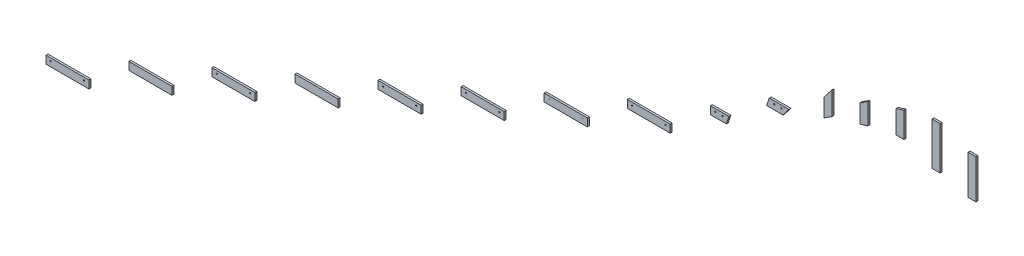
ISO-10303-21;
HEADER;
FILE_DESCRIPTION(('STEP AP214'),'2;1');
FILE_NAME('part.step','',(''),(''),'','','');
FILE_SCHEMA(('AUTOMOTIVE_DESIGN { 1 0 10303 214 1 1 1 1 }'));
ENDSEC;
DATA;
#1=APPLICATION_CONTEXT('core data for automotive mechanical design processes');
#2=APPLICATION_PROTOCOL_DEFINITION('international standard','automotive_design',2000,#1);
#3=PRODUCT_CONTEXT('',#1,'mechanical');
#4=PRODUCT('Part','Part','',(#3));
#5=PRODUCT_RELATED_PRODUCT_CATEGORY('part','',(#4));
#6=PRODUCT_DEFINITION_FORMATION('','',#4);
#7=PRODUCT_DEFINITION_CONTEXT('part definition',#1,'design');
#8=PRODUCT_DEFINITION('design','',#6,#7);
#9=PRODUCT_DEFINITION_SHAPE('','',#8);
#10=(LENGTH_UNIT() NAMED_UNIT(*) SI_UNIT(.MILLI.,.METRE.));
#11=(NAMED_UNIT(*) PLANE_ANGLE_UNIT() SI_UNIT($,.RADIAN.));
#12=(NAMED_UNIT(*) SI_UNIT($,.STERADIAN.) SOLID_ANGLE_UNIT());
#13=UNCERTAINTY_MEASURE_WITH_UNIT(LENGTH_MEASURE(1.E-05),#10,'distance_accuracy_value','');
#14=(GEOMETRIC_REPRESENTATION_CONTEXT(3) GLOBAL_UNCERTAINTY_ASSIGNED_CONTEXT((#13)) GLOBAL_UNIT_ASSIGNED_CONTEXT((#10,
#11,#12)) REPRESENTATION_CONTEXT('',''));
#15=CARTESIAN_POINT('',(0.,0.,0.));
#16=DIRECTION('',(0.,0.,1.));
#17=DIRECTION('',(1.,0.,0.));
#18=AXIS2_PLACEMENT_3D('',#15,#16,#17);
#19=CARTESIAN_POINT('',(0.,0.,880.310009));
#20=DIRECTION('',(0.,0.,1.));
#21=DIRECTION('',(1.,0.,0.));
#22=AXIS2_PLACEMENT_3D('',#19,#20,#21);
#23=PLANE('',#22);
#24=DIRECTION('',(0.614412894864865,0.788984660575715,0.));
#25=VECTOR('',#24,1.);
#26=CARTESIAN_POINT('',(2142.007828,-819.999933,880.310009));
#27=LINE('',#26,#25);
#28=CARTESIAN_POINT('',(2142.007828,-819.999933,880.310009));
#29=VERTEX_POINT('',#28);
#30=CARTESIAN_POINT('',(2182.003021,-768.640995,880.310009));
#31=VERTEX_POINT('',#30);
#32=EDGE_CURVE('E97',#29,#31,#27,.T.);
#33=ORIENTED_EDGE('',*,*,#32,.F.);
#34=DIRECTION('',(5.17446934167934E-05,0.999999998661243,0.));
#35=VECTOR('',#34,1.);
#36=CARTESIAN_POINT('',(2142.003059,-912.163973,880.310009));
#37=LINE('',#36,#35);
#38=CARTESIAN_POINT('',(2142.003059,-912.163973,880.310009));
#39=VERTEX_POINT('',#38);
#40=EDGE_CURVE('E118',#39,#29,#37,.T.);
#41=ORIENTED_EDGE('',*,*,#40,.F.);
#42=DIRECTION('',(-0.843513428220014,-0.537108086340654,0.));
#43=VECTOR('',#42,1.);
#44=CARTESIAN_POINT('',(2182.003021,-886.693954,880.310009));
#45=LINE('',#44,#43);
#46=CARTESIAN_POINT('',(2182.003021,-886.693954,880.310009));
#47=VERTEX_POINT('',#46);
#48=EDGE_CURVE('E126',#47,#39,#45,.T.);
#49=ORIENTED_EDGE('',*,*,#48,.F.);
#50=DIRECTION('',(0.,-1.,0.));
#51=VECTOR('',#50,1.);
#52=CARTESIAN_POINT('',(2182.003021,-768.640995,880.310009));
#53=LINE('',#52,#51);
#54=EDGE_CURVE('E133',#31,#47,#53,.T.);
#55=ORIENTED_EDGE('',*,*,#54,.F.);
#56=EDGE_LOOP('',(#33,#41,#49,#55));
#57=FACE_BOUND('',#56,.T.);
#58=ADVANCED_FACE('F88',(#57),#23,.T.);
#59=CARTESIAN_POINT('',(0.,0.,870.310009));
#60=DIRECTION('',(0.,0.,1.));
#61=DIRECTION('',(1.,0.,0.));
#62=AXIS2_PLACEMENT_3D('',#59,#60,#61);
#63=PLANE('',#62);
#64=CARTESIAN_POINT('',(2166.991949,-866.616845,870.310009));
#65=DIRECTION('',(0.,0.,1.));
#66=DIRECTION('',(1.,0.,0.));
#67=AXIS2_PLACEMENT_3D('',#64,#65,#66);
#68=CIRCLE('',#67,3.00000000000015);
#69=CARTESIAN_POINT('',(2169.991949,-866.616845,870.310009));
#70=VERTEX_POINT('',#69);
#71=EDGE_CURVE('E91',#70,#70,#68,.F.);
#72=ORIENTED_EDGE('',*,*,#71,.F.);
#73=EDGE_LOOP('',(#72));
#74=FACE_BOUND('',#73,.T.);
#75=CARTESIAN_POINT('',(2166.991949,-827.31092,870.310009));
#76=DIRECTION('',(0.,0.,1.));
#77=DIRECTION('',(1.,0.,0.));
#78=AXIS2_PLACEMENT_3D('',#75,#76,#77);
#79=CIRCLE('',#78,3.00000000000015);
#80=CARTESIAN_POINT('',(2169.991949,-827.31092,870.310009));
#81=VERTEX_POINT('',#80);
#82=EDGE_CURVE('E179',#81,#81,#79,.F.);
#83=ORIENTED_EDGE('',*,*,#82,.F.);
#84=EDGE_LOOP('',(#83));
#85=FACE_BOUND('',#84,.T.);
#86=DIRECTION('',(0.614412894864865,0.788984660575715,0.));
#87=VECTOR('',#86,1.);
#88=CARTESIAN_POINT('',(2142.007828,-819.999933,870.310009));
#89=LINE('',#88,#87);
#90=CARTESIAN_POINT('',(2142.007828,-819.999933,870.310009));
#91=VERTEX_POINT('',#90);
#92=CARTESIAN_POINT('',(2182.003021,-768.640995,870.310009));
#93=VERTEX_POINT('',#92);
#94=EDGE_CURVE('E13',#91,#93,#89,.T.);
#95=ORIENTED_EDGE('',*,*,#94,.T.);
#96=DIRECTION('',(0.,-1.,0.));
#97=VECTOR('',#96,1.);
#98=CARTESIAN_POINT('',(2182.003021,-768.640995,870.310009));
#99=LINE('',#98,#97);
#100=CARTESIAN_POINT('',(2182.003021,-886.693954,870.310009));
#101=VERTEX_POINT('',#100);
#102=EDGE_CURVE('E148',#93,#101,#99,.T.);
#103=ORIENTED_EDGE('',*,*,#102,.T.);
#104=DIRECTION('',(-0.843513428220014,-0.537108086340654,0.));
#105=VECTOR('',#104,1.);
#106=CARTESIAN_POINT('',(2182.003021,-886.693954,870.310009));
#107=LINE('',#106,#105);
#108=CARTESIAN_POINT('',(2142.003059,-912.163973,870.310009));
#109=VERTEX_POINT('',#108);
#110=EDGE_CURVE('E139',#101,#109,#107,.T.);
#111=ORIENTED_EDGE('',*,*,#110,.T.);
#112=DIRECTION('',(5.17446934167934E-05,0.999999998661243,0.));
#113=VECTOR('',#112,1.);
#114=CARTESIAN_POINT('',(2142.003059,-912.163973,870.310009));
#115=LINE('',#114,#113);
#116=EDGE_CURVE('E177',#109,#91,#115,.T.);
#117=ORIENTED_EDGE('',*,*,#116,.T.);
#118=EDGE_LOOP('',(#95,#103,#111,#117));
#119=FACE_BOUND('',#118,.T.);
#120=ADVANCED_FACE('F150',(#74,#85,#119),#63,.F.);
#121=CARTESIAN_POINT('',(2142.003059,-912.163973,870.310009));
#122=DIRECTION('',(0.999999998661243,-5.17446934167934E-05,0.));
#123=DIRECTION('',(5.17446934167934E-05,0.999999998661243,0.));
#124=AXIS2_PLACEMENT_3D('',#121,#122,#123);
#125=PLANE('',#124);
#126=ORIENTED_EDGE('',*,*,#40,.T.);
#127=DIRECTION('',(0.,0.,1.));
#128=VECTOR('',#127,1.);
#129=CARTESIAN_POINT('',(2142.007828,-819.999933,870.310009));
#130=LINE('',#129,#128);
#131=EDGE_CURVE('E173',#91,#29,#130,.T.);
#132=ORIENTED_EDGE('',*,*,#131,.F.);
#133=ORIENTED_EDGE('',*,*,#116,.F.);
#134=DIRECTION('',(0.,0.,1.));
#135=VECTOR('',#134,1.);
#136=CARTESIAN_POINT('',(2142.003059,-912.163973,870.310009));
#137=LINE('',#136,#135);
#138=EDGE_CURVE('E142',#109,#39,#137,.T.);
#139=ORIENTED_EDGE('',*,*,#138,.T.);
#140=EDGE_LOOP('',(#126,#132,#133,#139));
#141=FACE_BOUND('',#140,.T.);
#142=ADVANCED_FACE('F200',(#141),#125,.F.);
#143=CARTESIAN_POINT('',(2182.003021,-886.693954,870.310009));
#144=DIRECTION('',(-0.537108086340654,0.843513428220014,0.));
#145=DIRECTION('',(-0.843513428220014,-0.537108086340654,0.));
#146=AXIS2_PLACEMENT_3D('',#143,#144,#145);
#147=PLANE('',#146);
#148=ORIENTED_EDGE('',*,*,#48,.T.);
#149=ORIENTED_EDGE('',*,*,#138,.F.);
#150=ORIENTED_EDGE('',*,*,#110,.F.);
#151=DIRECTION('',(0.,0.,1.));
#152=VECTOR('',#151,1.);
#153=CARTESIAN_POINT('',(2182.003021,-886.693954,870.310009));
#154=LINE('',#153,#152);
#155=EDGE_CURVE('E141',#101,#47,#154,.T.);
#156=ORIENTED_EDGE('',*,*,#155,.T.);
#157=EDGE_LOOP('',(#148,#149,#150,#156));
#158=FACE_BOUND('',#157,.T.);
#159=ADVANCED_FACE('F140',(#158),#147,.F.);
#160=CARTESIAN_POINT('',(2182.003021,-768.640995,870.310009));
#161=DIRECTION('',(-1.,0.,0.));
#162=DIRECTION('',(0.,0.,1.));
#163=AXIS2_PLACEMENT_3D('',#160,#161,#162);
#164=PLANE('',#163);
#165=ORIENTED_EDGE('',*,*,#54,.T.);
#166=ORIENTED_EDGE('',*,*,#155,.F.);
#167=ORIENTED_EDGE('',*,*,#102,.F.);
#168=DIRECTION('',(0.,0.,1.));
#169=VECTOR('',#168,1.);
#170=CARTESIAN_POINT('',(2182.003021,-768.640995,870.310009));
#171=LINE('',#170,#169);
#172=EDGE_CURVE('E151',#93,#31,#171,.T.);
#173=ORIENTED_EDGE('',*,*,#172,.T.);
#174=EDGE_LOOP('',(#165,#166,#167,#173));
#175=FACE_BOUND('',#174,.T.);
#176=ADVANCED_FACE('F147',(#175),#164,.F.);
#177=CARTESIAN_POINT('',(2142.007828,-819.999933,870.310009));
#178=DIRECTION('',(0.788984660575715,-0.614412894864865,0.));
#179=DIRECTION('',(0.614412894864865,0.788984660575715,0.));
#180=AXIS2_PLACEMENT_3D('',#177,#178,#179);
#181=PLANE('',#180);
#182=ORIENTED_EDGE('',*,*,#32,.T.);
#183=ORIENTED_EDGE('',*,*,#172,.F.);
#184=ORIENTED_EDGE('',*,*,#94,.F.);
#185=ORIENTED_EDGE('',*,*,#131,.T.);
#186=EDGE_LOOP('',(#182,#183,#184,#185));
#187=FACE_BOUND('',#186,.T.);
#188=ADVANCED_FACE('F201',(#187),#181,.F.);
#189=CARTESIAN_POINT('',(2166.991949,-827.31092,880.266845));
#190=DIRECTION('',(0.,0.,-1.));
#191=DIRECTION('',(-1.,0.,0.));
#192=AXIS2_PLACEMENT_3D('',#189,#190,#191);
#193=CYLINDRICAL_SURFACE('',#192,3.00000000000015);
#194=CARTESIAN_POINT('',(2166.991949,-827.31092,880.266845));
#195=DIRECTION('',(0.,0.,1.));
#196=DIRECTION('',(1.,0.,0.));
#197=AXIS2_PLACEMENT_3D('',#194,#195,#196);
#198=CIRCLE('',#197,3.00000000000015);
#199=CARTESIAN_POINT('',(2169.991949,-827.31092,880.266845));
#200=VERTEX_POINT('',#199);
#201=EDGE_CURVE('E186',#200,#200,#198,.T.);
#202=ORIENTED_EDGE('',*,*,#201,.T.);
#203=EDGE_LOOP('',(#202));
#204=FACE_BOUND('',#203,.T.);
#205=ORIENTED_EDGE('',*,*,#82,.T.);
#206=EDGE_LOOP('',(#205));
#207=FACE_BOUND('',#206,.T.);
#208=ADVANCED_FACE('F204',(#204,#207),#193,.F.);
#209=CARTESIAN_POINT('',(0.,3.85452125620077E-11,880.266844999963));
#210=DIRECTION('',(0.,0.,-1.));
#211=DIRECTION('',(0.,1.,0.));
#212=AXIS2_PLACEMENT_3D('',#209,#210,#211);
#213=PLANE('',#212);
#214=ORIENTED_EDGE('',*,*,#201,.F.);
#215=EDGE_LOOP('',(#214));
#216=FACE_BOUND('',#215,.T.);
#217=ADVANCED_FACE('F210',(#216),#213,.T.);
#218=CARTESIAN_POINT('',(2166.991949,-866.616845,880.266845));
#219=DIRECTION('',(0.,0.,-1.));
#220=DIRECTION('',(-1.,0.,0.));
#221=AXIS2_PLACEMENT_3D('',#218,#219,#220);
#222=CYLINDRICAL_SURFACE('',#221,3.00000000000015);
#223=CARTESIAN_POINT('',(2166.991949,-866.616845,880.266845));
#224=DIRECTION('',(0.,0.,1.));
#225=DIRECTION('',(1.,0.,0.));
#226=AXIS2_PLACEMENT_3D('',#223,#224,#225);
#227=CIRCLE('',#226,3.00000000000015);
#228=CARTESIAN_POINT('',(2169.991949,-866.616845,880.266845));
#229=VERTEX_POINT('',#228);
#230=EDGE_CURVE('E181',#229,#229,#227,.T.);
#231=ORIENTED_EDGE('',*,*,#230,.T.);
#232=EDGE_LOOP('',(#231));
#233=FACE_BOUND('',#232,.T.);
#234=ORIENTED_EDGE('',*,*,#71,.T.);
#235=EDGE_LOOP('',(#234));
#236=FACE_BOUND('',#235,.T.);
#237=ADVANCED_FACE('F225',(#233,#236),#222,.F.);
#238=CARTESIAN_POINT('',(0.,3.85452125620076E-11,880.266844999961));
#239=DIRECTION('',(0.,0.,-1.));
#240=DIRECTION('',(0.,1.,0.));
#241=AXIS2_PLACEMENT_3D('',#238,#239,#240);
#242=PLANE('',#241);
#243=ORIENTED_EDGE('',*,*,#230,.F.);
#244=EDGE_LOOP('',(#243));
#245=FACE_BOUND('',#244,.T.);
#246=ADVANCED_FACE('F228',(#245),#242,.T.);
#247=CLOSED_SHELL('',(#58,#120,#142,#159,#176,#188,#208,#217,#237,#246));
#248=MANIFOLD_SOLID_BREP('B2',#247);
#249=CARTESIAN_POINT('',(0.,0.,696.249970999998));
#250=DIRECTION('',(0.,0.,1.));
#251=DIRECTION('',(1.,0.,0.));
#252=AXIS2_PLACEMENT_3D('',#249,#250,#251);
#253=PLANE('',#252);
#254=DIRECTION('',(0.843466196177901,0.537182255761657,0.));
#255=VECTOR('',#254,1.);
#256=CARTESIAN_POINT('',(2142.008781,-937.277019,696.249971));
#257=LINE('',#256,#255);
#258=CARTESIAN_POINT('',(2142.008781,-937.277019,696.249971));
#259=VERTEX_POINT('',#258);
#260=CARTESIAN_POINT('',(2182.003975,-911.805093,696.249971));
#261=VERTEX_POINT('',#260);
#262=EDGE_CURVE('E314',#259,#261,#257,.T.);
#263=ORIENTED_EDGE('',*,*,#262,.F.);
#264=DIRECTION('',(5.04592884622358E-05,0.99999999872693,0.));
#265=VECTOR('',#264,1.);
#266=CARTESIAN_POINT('',(2142.004013,-1031.769037,696.249971));
#267=LINE('',#266,#265);
#268=CARTESIAN_POINT('',(2142.004013,-1031.769037,696.249971));
#269=VERTEX_POINT('',#268);
#270=EDGE_CURVE('E335',#269,#259,#267,.T.);
#271=ORIENTED_EDGE('',*,*,#270,.F.);
#272=DIRECTION('',(-0.956673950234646,-0.291161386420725,0.));
#273=VECTOR('',#272,1.);
#274=CARTESIAN_POINT('',(2182.003975,-1019.595146,696.249971));
#275=LINE('',#274,#273);
#276=CARTESIAN_POINT('',(2182.003975,-1019.595146,696.249971));
#277=VERTEX_POINT('',#276);
#278=EDGE_CURVE('E343',#277,#269,#275,.T.);
#279=ORIENTED_EDGE('',*,*,#278,.F.);
#280=DIRECTION('',(0.,-1.,0.));
#281=VECTOR('',#280,1.);
#282=CARTESIAN_POINT('',(2182.003975,-911.805093,696.249971));
#283=LINE('',#282,#281);
#284=EDGE_CURVE('E350',#261,#277,#283,.T.);
#285=ORIENTED_EDGE('',*,*,#284,.F.);
#286=EDGE_LOOP('',(#263,#271,#279,#285));
#287=FACE_BOUND('',#286,.T.);
#288=ADVANCED_FACE('F305',(#287),#253,.T.);
#289=CARTESIAN_POINT('',(0.,0.,686.249970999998));
#290=DIRECTION('',(0.,0.,1.));
#291=DIRECTION('',(1.,0.,0.));
#292=AXIS2_PLACEMENT_3D('',#289,#290,#291);
#293=PLANE('',#292);
#294=CARTESIAN_POINT('',(2166.996002,-997.976959,686.249970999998));
#295=DIRECTION('',(0.,0.,1.));
#296=DIRECTION('',(1.,0.,0.));
#297=AXIS2_PLACEMENT_3D('',#294,#295,#296);
#298=CIRCLE('',#297,3.00000000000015);
#299=CARTESIAN_POINT('',(2169.996002,-997.976959,686.249970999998));
#300=VERTEX_POINT('',#299);
#301=EDGE_CURVE('E308',#300,#300,#298,.F.);
#302=ORIENTED_EDGE('',*,*,#301,.F.);
#303=EDGE_LOOP('',(#302));
#304=FACE_BOUND('',#303,.T.);
#305=CARTESIAN_POINT('',(2166.996002,-951.067984,686.249970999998));
#306=DIRECTION('',(0.,0.,1.));
#307=DIRECTION('',(1.,0.,0.));
#308=AXIS2_PLACEMENT_3D('',#305,#306,#307);
#309=CIRCLE('',#308,3.00000000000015);
#310=CARTESIAN_POINT('',(2169.996002,-951.067984,686.249970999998));
#311=VERTEX_POINT('',#310);
#312=EDGE_CURVE('E396',#311,#311,#309,.F.);
#313=ORIENTED_EDGE('',*,*,#312,.F.);
#314=EDGE_LOOP('',(#313));
#315=FACE_BOUND('',#314,.T.);
#316=DIRECTION('',(0.843466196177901,0.537182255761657,0.));
#317=VECTOR('',#316,1.);
#318=CARTESIAN_POINT('',(2142.008781,-937.277019,686.249971));
#319=LINE('',#318,#317);
#320=CARTESIAN_POINT('',(2142.008781,-937.277019,686.249971));
#321=VERTEX_POINT('',#320);
#322=CARTESIAN_POINT('',(2182.003975,-911.805093,686.249971));
#323=VERTEX_POINT('',#322);
#324=EDGE_CURVE('E86',#321,#323,#319,.T.);
#325=ORIENTED_EDGE('',*,*,#324,.T.);
#326=DIRECTION('',(0.,-1.,0.));
#327=VECTOR('',#326,1.);
#328=CARTESIAN_POINT('',(2182.003975,-911.805093,686.249971));
#329=LINE('',#328,#327);
#330=CARTESIAN_POINT('',(2182.003975,-1019.595146,686.249971));
#331=VERTEX_POINT('',#330);
#332=EDGE_CURVE('E365',#323,#331,#329,.T.);
#333=ORIENTED_EDGE('',*,*,#332,.T.);
#334=DIRECTION('',(-0.956673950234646,-0.291161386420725,0.));
#335=VECTOR('',#334,1.);
#336=CARTESIAN_POINT('',(2182.003975,-1019.595146,686.249971));
#337=LINE('',#336,#335);
#338=CARTESIAN_POINT('',(2142.004013,-1031.769037,686.249971));
#339=VERTEX_POINT('',#338);
#340=EDGE_CURVE('E356',#331,#339,#337,.T.);
#341=ORIENTED_EDGE('',*,*,#340,.T.);
#342=DIRECTION('',(5.04592884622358E-05,0.99999999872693,0.));
#343=VECTOR('',#342,1.);
#344=CARTESIAN_POINT('',(2142.004013,-1031.769037,686.249971));
#345=LINE('',#344,#343);
#346=EDGE_CURVE('E394',#339,#321,#345,.T.);
#347=ORIENTED_EDGE('',*,*,#346,.T.);
#348=EDGE_LOOP('',(#325,#333,#341,#347));
#349=FACE_BOUND('',#348,.T.);
#350=ADVANCED_FACE('F367',(#304,#315,#349),#293,.F.);
#351=CARTESIAN_POINT('',(2142.004013,-1031.769037,686.249971));
#352=DIRECTION('',(0.99999999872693,-5.04592884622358E-05,0.));
#353=DIRECTION('',(5.04592884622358E-05,0.99999999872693,0.));
#354=AXIS2_PLACEMENT_3D('',#351,#352,#353);
#355=PLANE('',#354);
#356=ORIENTED_EDGE('',*,*,#270,.T.);
#357=DIRECTION('',(0.,0.,1.));
#358=VECTOR('',#357,1.);
#359=CARTESIAN_POINT('',(2142.008781,-937.277019,686.249971));
#360=LINE('',#359,#358);
#361=EDGE_CURVE('E390',#321,#259,#360,.T.);
#362=ORIENTED_EDGE('',*,*,#361,.F.);
#363=ORIENTED_EDGE('',*,*,#346,.F.);
#364=DIRECTION('',(0.,0.,1.));
#365=VECTOR('',#364,1.);
#366=CARTESIAN_POINT('',(2142.004013,-1031.769037,686.249971));
#367=LINE('',#366,#365);
#368=EDGE_CURVE('E359',#339,#269,#367,.T.);
#369=ORIENTED_EDGE('',*,*,#368,.T.);
#370=EDGE_LOOP('',(#356,#362,#363,#369));
#371=FACE_BOUND('',#370,.T.);
#372=ADVANCED_FACE('F417',(#371),#355,.F.);
#373=CARTESIAN_POINT('',(2182.003975,-1019.595146,686.249971));
#374=DIRECTION('',(-0.291161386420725,0.956673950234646,0.));
#375=DIRECTION('',(-0.956673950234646,-0.291161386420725,0.));
#376=AXIS2_PLACEMENT_3D('',#373,#374,#375);
#377=PLANE('',#376);
#378=ORIENTED_EDGE('',*,*,#278,.T.);
#379=ORIENTED_EDGE('',*,*,#368,.F.);
#380=ORIENTED_EDGE('',*,*,#340,.F.);
#381=DIRECTION('',(0.,0.,1.));
#382=VECTOR('',#381,1.);
#383=CARTESIAN_POINT('',(2182.003975,-1019.595146,686.249971));
#384=LINE('',#383,#382);
#385=EDGE_CURVE('E358',#331,#277,#384,.T.);
#386=ORIENTED_EDGE('',*,*,#385,.T.);
#387=EDGE_LOOP('',(#378,#379,#380,#386));
#388=FACE_BOUND('',#387,.T.);
#389=ADVANCED_FACE('F357',(#388),#377,.F.);
#390=CARTESIAN_POINT('',(2182.003975,-911.805093,686.249971));
#391=DIRECTION('',(-1.,0.,0.));
#392=DIRECTION('',(0.,0.,1.));
#393=AXIS2_PLACEMENT_3D('',#390,#391,#392);
#394=PLANE('',#393);
#395=ORIENTED_EDGE('',*,*,#284,.T.);
#396=ORIENTED_EDGE('',*,*,#385,.F.);
#397=ORIENTED_EDGE('',*,*,#332,.F.);
#398=DIRECTION('',(0.,0.,1.));
#399=VECTOR('',#398,1.);
#400=CARTESIAN_POINT('',(2182.003975,-911.805093,686.249971));
#401=LINE('',#400,#399);
#402=EDGE_CURVE('E368',#323,#261,#401,.T.);
#403=ORIENTED_EDGE('',*,*,#402,.T.);
#404=EDGE_LOOP('',(#395,#396,#397,#403));
#405=FACE_BOUND('',#404,.T.);
#406=ADVANCED_FACE('F364',(#405),#394,.F.);
#407=CARTESIAN_POINT('',(2142.008781,-937.277019,686.249971));
#408=DIRECTION('',(0.537182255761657,-0.843466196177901,0.));
#409=DIRECTION('',(0.843466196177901,0.537182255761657,0.));
#410=AXIS2_PLACEMENT_3D('',#407,#408,#409);
#411=PLANE('',#410);
#412=ORIENTED_EDGE('',*,*,#262,.T.);
#413=ORIENTED_EDGE('',*,*,#402,.F.);
#414=ORIENTED_EDGE('',*,*,#324,.F.);
#415=ORIENTED_EDGE('',*,*,#361,.T.);
#416=EDGE_LOOP('',(#412,#413,#414,#415));
#417=FACE_BOUND('',#416,.T.);
#418=ADVANCED_FACE('F418',(#417),#411,.F.);
#419=CARTESIAN_POINT('',(2166.996002,-951.067984,696.206868));
#420=DIRECTION('',(0.,0.,-1.));
#421=DIRECTION('',(-1.,0.,0.));
#422=AXIS2_PLACEMENT_3D('',#419,#420,#421);
#423=CYLINDRICAL_SURFACE('',#422,3.00000000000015);
#424=CARTESIAN_POINT('',(2166.996002,-951.067984,696.206868));
#425=DIRECTION('',(0.,0.,1.));
#426=DIRECTION('',(1.,0.,0.));
#427=AXIS2_PLACEMENT_3D('',#424,#425,#426);
#428=CIRCLE('',#427,3.00000000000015);
#429=CARTESIAN_POINT('',(2169.996002,-951.067984,696.206868));
#430=VERTEX_POINT('',#429);
#431=EDGE_CURVE('E403',#430,#430,#428,.T.);
#432=ORIENTED_EDGE('',*,*,#431,.T.);
#433=EDGE_LOOP('',(#432));
#434=FACE_BOUND('',#433,.T.);
#435=ORIENTED_EDGE('',*,*,#312,.T.);
#436=EDGE_LOOP('',(#435));
#437=FACE_BOUND('',#436,.T.);
#438=ADVANCED_FACE('F421',(#434,#437),#423,.F.);
#439=CARTESIAN_POINT('',(1.14320909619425E-11,0.,696.206868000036));
#440=DIRECTION('',(0.,0.,-1.));
#441=DIRECTION('',(-1.,0.,0.));
#442=AXIS2_PLACEMENT_3D('',#439,#440,#441);
#443=PLANE('',#442);
#444=ORIENTED_EDGE('',*,*,#431,.F.);
#445=EDGE_LOOP('',(#444));
#446=FACE_BOUND('',#445,.T.);
#447=ADVANCED_FACE('F427',(#446),#443,.T.);
#448=CARTESIAN_POINT('',(2166.996002,-997.976959,696.206868));
#449=DIRECTION('',(0.,0.,-1.));
#450=DIRECTION('',(-1.,0.,0.));
#451=AXIS2_PLACEMENT_3D('',#448,#449,#450);
#452=CYLINDRICAL_SURFACE('',#451,3.00000000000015);
#453=CARTESIAN_POINT('',(2166.996002,-997.976959,696.206868));
#454=DIRECTION('',(0.,0.,1.));
#455=DIRECTION('',(1.,0.,0.));
#456=AXIS2_PLACEMENT_3D('',#453,#454,#455);
#457=CIRCLE('',#456,3.00000000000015);
#458=CARTESIAN_POINT('',(2169.996002,-997.976959,696.206868));
#459=VERTEX_POINT('',#458);
#460=EDGE_CURVE('E398',#459,#459,#457,.T.);
#461=ORIENTED_EDGE('',*,*,#460,.T.);
#462=EDGE_LOOP('',(#461));
#463=FACE_BOUND('',#462,.T.);
#464=ORIENTED_EDGE('',*,*,#301,.T.);
#465=EDGE_LOOP('',(#464));
#466=FACE_BOUND('',#465,.T.);
#467=ADVANCED_FACE('F442',(#463,#466),#452,.F.);
#468=CARTESIAN_POINT('',(0.,0.,696.206868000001));
#469=DIRECTION('',(0.,0.,-1.));
#470=DIRECTION('',(-1.,0.,0.));
#471=AXIS2_PLACEMENT_3D('',#468,#469,#470);
#472=PLANE('',#471);
#473=ORIENTED_EDGE('',*,*,#460,.F.);
#474=EDGE_LOOP('',(#473));
#475=FACE_BOUND('',#474,.T.);
#476=ADVANCED_FACE('F445',(#475),#472,.T.);
#477=CLOSED_SHELL('',(#288,#350,#372,#389,#406,#418,#438,#447,#467,#476));
#478=MANIFOLD_SOLID_BREP('B7',#477);
#479=CARTESIAN_POINT('',(0.,0.,144.073079));
#480=DIRECTION('',(0.,0.,1.));
#481=DIRECTION('',(1.,0.,0.));
#482=AXIS2_PLACEMENT_3D('',#479,#480,#481);
#483=PLANE('',#482);
#484=DIRECTION('',(0.999999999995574,-2.97535748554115E-06,0.));
#485=VECTOR('',#484,1.);
#486=CARTESIAN_POINT('',(2142.00592,-1432.156801,144.073079));
#487=LINE('',#486,#485);
#488=CARTESIAN_POINT('',(2142.00592,-1432.156801,144.073079));
#489=VERTEX_POINT('',#488);
#490=CARTESIAN_POINT('',(2182.001114,-1432.15692,144.073079));
#491=VERTEX_POINT('',#490);
#492=EDGE_CURVE('E531',#489,#491,#487,.T.);
#493=ORIENTED_EDGE('',*,*,#492,.F.);
#494=DIRECTION('',(2.38790211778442E-05,0.999999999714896,0.));
#495=VECTOR('',#494,1.);
#496=CARTESIAN_POINT('',(2142.001152,-1631.829977,144.073079));
#497=LINE('',#496,#495);
#498=CARTESIAN_POINT('',(2142.001152,-1631.829977,144.073079));
#499=VERTEX_POINT('',#498);
#500=EDGE_CURVE('E552',#499,#489,#497,.T.);
#501=ORIENTED_EDGE('',*,*,#500,.F.);
#502=DIRECTION('',(-0.999999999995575,-2.97500282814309E-06,0.));
#503=VECTOR('',#502,1.);
#504=CARTESIAN_POINT('',(2182.001114,-1631.829858,144.073079));
#505=LINE('',#504,#503);
#506=CARTESIAN_POINT('',(2182.001114,-1631.829858,144.073079));
#507=VERTEX_POINT('',#506);
#508=EDGE_CURVE('E560',#507,#499,#505,.T.);
#509=ORIENTED_EDGE('',*,*,#508,.F.);
#510=DIRECTION('',(0.,-1.,0.));
#511=VECTOR('',#510,1.);
#512=CARTESIAN_POINT('',(2182.001114,-1432.15692,144.073079));
#513=LINE('',#512,#511);
#514=EDGE_CURVE('E567',#491,#507,#513,.T.);
#515=ORIENTED_EDGE('',*,*,#514,.F.);
#516=EDGE_LOOP('',(#493,#501,#509,#515));
#517=FACE_BOUND('',#516,.T.);
#518=ADVANCED_FACE('F522',(#517),#483,.T.);
#519=CARTESIAN_POINT('',(0.,0.,134.073079));
#520=DIRECTION('',(0.,0.,1.));
#521=DIRECTION('',(1.,0.,0.));
#522=AXIS2_PLACEMENT_3D('',#519,#520,#521);
#523=PLANE('',#522);
#524=CARTESIAN_POINT('',(2166.996002,-1606.633902,134.073079));
#525=DIRECTION('',(0.,0.,1.));
#526=DIRECTION('',(1.,0.,0.));
#527=AXIS2_PLACEMENT_3D('',#524,#525,#526);
#528=CIRCLE('',#527,3.00000000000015);
#529=CARTESIAN_POINT('',(2169.996002,-1606.633902,134.073079));
#530=VERTEX_POINT('',#529);
#531=EDGE_CURVE('E525',#530,#530,#528,.F.);
#532=ORIENTED_EDGE('',*,*,#531,.F.);
#533=EDGE_LOOP('',(#532));
#534=FACE_BOUND('',#533,.T.);
#535=CARTESIAN_POINT('',(2166.996002,-1457.309961,134.073079));
#536=DIRECTION('',(0.,0.,1.));
#537=DIRECTION('',(1.,0.,0.));
#538=AXIS2_PLACEMENT_3D('',#535,#536,#537);
#539=CIRCLE('',#538,3.00000000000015);
#540=CARTESIAN_POINT('',(2169.996002,-1457.309961,134.073079));
#541=VERTEX_POINT('',#540);
#542=EDGE_CURVE('E613',#541,#541,#539,.F.);
#543=ORIENTED_EDGE('',*,*,#542,.F.);
#544=EDGE_LOOP('',(#543));
#545=FACE_BOUND('',#544,.T.);
#546=DIRECTION('',(0.999999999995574,-2.97535748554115E-06,0.));
#547=VECTOR('',#546,1.);
#548=CARTESIAN_POINT('',(2142.00592,-1432.156801,134.073079));
#549=LINE('',#548,#547);
#550=CARTESIAN_POINT('',(2142.00592,-1432.156801,134.073079));
#551=VERTEX_POINT('',#550);
#552=CARTESIAN_POINT('',(2182.001114,-1432.15692,134.073079));
#553=VERTEX_POINT('',#552);
#554=EDGE_CURVE('E303',#551,#553,#549,.T.);
#555=ORIENTED_EDGE('',*,*,#554,.T.);
#556=DIRECTION('',(0.,-1.,0.));
#557=VECTOR('',#556,1.);
#558=CARTESIAN_POINT('',(2182.001114,-1432.15692,134.073079));
#559=LINE('',#558,#557);
#560=CARTESIAN_POINT('',(2182.001114,-1631.829858,134.073079));
#561=VERTEX_POINT('',#560);
#562=EDGE_CURVE('E582',#553,#561,#559,.T.);
#563=ORIENTED_EDGE('',*,*,#562,.T.);
#564=DIRECTION('',(-0.999999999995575,-2.97500282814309E-06,0.));
#565=VECTOR('',#564,1.);
#566=CARTESIAN_POINT('',(2182.001114,-1631.829858,134.073079));
#567=LINE('',#566,#565);
#568=CARTESIAN_POINT('',(2142.001152,-1631.829977,134.073079));
#569=VERTEX_POINT('',#568);
#570=EDGE_CURVE('E573',#561,#569,#567,.T.);
#571=ORIENTED_EDGE('',*,*,#570,.T.);
#572=DIRECTION('',(2.38790211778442E-05,0.999999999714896,0.));
#573=VECTOR('',#572,1.);
#574=CARTESIAN_POINT('',(2142.001152,-1631.829977,134.073079));
#575=LINE('',#574,#573);
#576=EDGE_CURVE('E611',#569,#551,#575,.T.);
#577=ORIENTED_EDGE('',*,*,#576,.T.);
#578=EDGE_LOOP('',(#555,#563,#571,#577));
#579=FACE_BOUND('',#578,.T.);
#580=ADVANCED_FACE('F584',(#534,#545,#579),#523,.F.);
#581=CARTESIAN_POINT('',(2142.001152,-1631.829977,134.073079));
#582=DIRECTION('',(0.999999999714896,-2.38790211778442E-05,0.));
#583=DIRECTION('',(2.38790211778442E-05,0.999999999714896,0.));
#584=AXIS2_PLACEMENT_3D('',#581,#582,#583);
#585=PLANE('',#584);
#586=ORIENTED_EDGE('',*,*,#500,.T.);
#587=DIRECTION('',(0.,0.,1.));
#588=VECTOR('',#587,1.);
#589=CARTESIAN_POINT('',(2142.00592,-1432.156801,134.073079));
#590=LINE('',#589,#588);
#591=EDGE_CURVE('E607',#551,#489,#590,.T.);
#592=ORIENTED_EDGE('',*,*,#591,.F.);
#593=ORIENTED_EDGE('',*,*,#576,.F.);
#594=DIRECTION('',(0.,0.,1.));
#595=VECTOR('',#594,1.);
#596=CARTESIAN_POINT('',(2142.001152,-1631.829977,134.073079));
#597=LINE('',#596,#595);
#598=EDGE_CURVE('E576',#569,#499,#597,.T.);
#599=ORIENTED_EDGE('',*,*,#598,.T.);
#600=EDGE_LOOP('',(#586,#592,#593,#599));
#601=FACE_BOUND('',#600,.T.);
#602=ADVANCED_FACE('F634',(#601),#585,.F.);
#603=CARTESIAN_POINT('',(2182.001114,-1631.829858,134.073079));
#604=DIRECTION('',(-2.97500282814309E-06,0.999999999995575,0.));
#605=DIRECTION('',(-0.999999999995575,-2.97500282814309E-06,0.));
#606=AXIS2_PLACEMENT_3D('',#603,#604,#605);
#607=PLANE('',#606);
#608=ORIENTED_EDGE('',*,*,#508,.T.);
#609=ORIENTED_EDGE('',*,*,#598,.F.);
#610=ORIENTED_EDGE('',*,*,#570,.F.);
#611=DIRECTION('',(0.,0.,1.));
#612=VECTOR('',#611,1.);
#613=CARTESIAN_POINT('',(2182.001114,-1631.829858,134.073079));
#614=LINE('',#613,#612);
#615=EDGE_CURVE('E575',#561,#507,#614,.T.);
#616=ORIENTED_EDGE('',*,*,#615,.T.);
#617=EDGE_LOOP('',(#608,#609,#610,#616));
#618=FACE_BOUND('',#617,.T.);
#619=ADVANCED_FACE('F574',(#618),#607,.F.);
#620=CARTESIAN_POINT('',(2182.001114,-1432.15692,134.073079));
#621=DIRECTION('',(-1.,0.,0.));
#622=DIRECTION('',(0.,0.,1.));
#623=AXIS2_PLACEMENT_3D('',#620,#621,#622);
#624=PLANE('',#623);
#625=ORIENTED_EDGE('',*,*,#514,.T.);
#626=ORIENTED_EDGE('',*,*,#615,.F.);
#627=ORIENTED_EDGE('',*,*,#562,.F.);
#628=DIRECTION('',(0.,0.,1.));
#629=VECTOR('',#628,1.);
#630=CARTESIAN_POINT('',(2182.001114,-1432.15692,134.073079));
#631=LINE('',#630,#629);
#632=EDGE_CURVE('E585',#553,#491,#631,.T.);
#633=ORIENTED_EDGE('',*,*,#632,.T.);
#634=EDGE_LOOP('',(#625,#626,#627,#633));
#635=FACE_BOUND('',#634,.T.);
#636=ADVANCED_FACE('F581',(#635),#624,.F.);
#637=CARTESIAN_POINT('',(2142.00592,-1432.156801,134.073079));
#638=DIRECTION('',(-2.97535748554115E-06,-0.999999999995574,0.));
#639=DIRECTION('',(0.999999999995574,-2.97535748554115E-06,0.));
#640=AXIS2_PLACEMENT_3D('',#637,#638,#639);
#641=PLANE('',#640);
#642=ORIENTED_EDGE('',*,*,#492,.T.);
#643=ORIENTED_EDGE('',*,*,#632,.F.);
#644=ORIENTED_EDGE('',*,*,#554,.F.);
#645=ORIENTED_EDGE('',*,*,#591,.T.);
#646=EDGE_LOOP('',(#642,#643,#644,#645));
#647=FACE_BOUND('',#646,.T.);
#648=ADVANCED_FACE('F635',(#647),#641,.F.);
#649=CARTESIAN_POINT('',(2166.996002,-1457.309961,144.026756));
#650=DIRECTION('',(0.,0.,-1.));
#651=DIRECTION('',(-1.,0.,0.));
#652=AXIS2_PLACEMENT_3D('',#649,#650,#651);
#653=CYLINDRICAL_SURFACE('',#652,3.00000000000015);
#654=CARTESIAN_POINT('',(2166.996002,-1457.309961,144.026756));
#655=DIRECTION('',(0.,0.,1.));
#656=DIRECTION('',(1.,0.,0.));
#657=AXIS2_PLACEMENT_3D('',#654,#655,#656);
#658=CIRCLE('',#657,3.00000000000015);
#659=CARTESIAN_POINT('',(2169.996002,-1457.309961,144.026756));
#660=VERTEX_POINT('',#659);
#661=EDGE_CURVE('E620',#660,#660,#658,.T.);
#662=ORIENTED_EDGE('',*,*,#661,.T.);
#663=EDGE_LOOP('',(#662));
#664=FACE_BOUND('',#663,.T.);
#665=ORIENTED_EDGE('',*,*,#542,.T.);
#666=EDGE_LOOP('',(#665));
#667=FACE_BOUND('',#666,.T.);
#668=ADVANCED_FACE('F638',(#664,#667),#653,.F.);
#669=CARTESIAN_POINT('',(1.1824983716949E-12,0.,144.026756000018));
#670=DIRECTION('',(0.,0.,-1.));
#671=DIRECTION('',(-1.,0.,0.));
#672=AXIS2_PLACEMENT_3D('',#669,#670,#671);
#673=PLANE('',#672);
#674=ORIENTED_EDGE('',*,*,#661,.F.);
#675=EDGE_LOOP('',(#674));
#676=FACE_BOUND('',#675,.T.);
#677=ADVANCED_FACE('F644',(#676),#673,.T.);
#678=CARTESIAN_POINT('',(2166.996002,-1606.633902,144.026756));
#679=DIRECTION('',(0.,0.,-1.));
#680=DIRECTION('',(-1.,0.,0.));
#681=AXIS2_PLACEMENT_3D('',#678,#679,#680);
#682=CYLINDRICAL_SURFACE('',#681,3.00000000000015);
#683=CARTESIAN_POINT('',(2166.996002,-1606.633902,144.026756));
#684=DIRECTION('',(0.,0.,1.));
#685=DIRECTION('',(1.,0.,0.));
#686=AXIS2_PLACEMENT_3D('',#683,#684,#685);
#687=CIRCLE('',#686,3.00000000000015);
#688=CARTESIAN_POINT('',(2169.996002,-1606.633902,144.026756));
#689=VERTEX_POINT('',#688);
#690=EDGE_CURVE('E615',#689,#689,#687,.T.);
#691=ORIENTED_EDGE('',*,*,#690,.T.);
#692=EDGE_LOOP('',(#691));
#693=FACE_BOUND('',#692,.T.);
#694=ORIENTED_EDGE('',*,*,#531,.T.);
#695=EDGE_LOOP('',(#694));
#696=FACE_BOUND('',#695,.T.);
#697=ADVANCED_FACE('F659',(#693,#696),#682,.F.);
#698=CARTESIAN_POINT('',(1.37958143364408E-12,0.,144.026756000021));
#699=DIRECTION('',(0.,0.,-1.));
#700=DIRECTION('',(-1.,0.,0.));
#701=AXIS2_PLACEMENT_3D('',#698,#699,#700);
#702=PLANE('',#701);
#703=ORIENTED_EDGE('',*,*,#690,.F.);
#704=EDGE_LOOP('',(#703));
#705=FACE_BOUND('',#704,.T.);
#706=ADVANCED_FACE('F662',(#705),#702,.T.);
#707=CLOSED_SHELL('',(#518,#580,#602,#619,#636,#648,#668,#677,#697,#706));
#708=MANIFOLD_SOLID_BREP('B80',#707);
#709=CARTESIAN_POINT('',(0.,0.,328.132043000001));
#710=DIRECTION('',(0.,0.,1.));
#711=DIRECTION('',(1.,0.,0.));
#712=AXIS2_PLACEMENT_3D('',#709,#710,#711);
#713=PLANE('',#712);
#714=DIRECTION('',(1.,0.,0.));
#715=VECTOR('',#714,1.);
#716=CARTESIAN_POINT('',(2142.006874,-1193.108916,328.132043));
#717=LINE('',#716,#715);
#718=CARTESIAN_POINT('',(2142.006874,-1193.108916,328.132043));
#719=VERTEX_POINT('',#718);
#720=CARTESIAN_POINT('',(2182.002068,-1193.108916,328.132043));
#721=VERTEX_POINT('',#720);
#722=EDGE_CURVE('E748',#719,#721,#717,.T.);
#723=ORIENTED_EDGE('',*,*,#722,.F.);
#724=DIRECTION('',(2.1799458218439E-05,0.999999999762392,0.));
#725=VECTOR('',#724,1.);
#726=CARTESIAN_POINT('',(2142.002106,-1411.829948,328.132043));
#727=LINE('',#726,#725);
#728=CARTESIAN_POINT('',(2142.002106,-1411.829948,328.132043));
#729=VERTEX_POINT('',#728);
#730=EDGE_CURVE('E769',#729,#719,#727,.T.);
#731=ORIENTED_EDGE('',*,*,#730,.F.);
#732=DIRECTION('',(-1.,0.,0.));
#733=VECTOR('',#732,1.);
#734=CARTESIAN_POINT('',(2182.002068,-1411.829948,328.132043));
#735=LINE('',#734,#733);
#736=CARTESIAN_POINT('',(2182.002068,-1411.829948,328.132043));
#737=VERTEX_POINT('',#736);
#738=EDGE_CURVE('E777',#737,#729,#735,.T.);
#739=ORIENTED_EDGE('',*,*,#738,.F.);
#740=DIRECTION('',(0.,-1.,0.));
#741=VECTOR('',#740,1.);
#742=CARTESIAN_POINT('',(2182.002068,-1193.108916,328.132043));
#743=LINE('',#742,#741);
#744=EDGE_CURVE('E784',#721,#737,#743,.T.);
#745=ORIENTED_EDGE('',*,*,#744,.F.);
#746=EDGE_LOOP('',(#723,#731,#739,#745));
#747=FACE_BOUND('',#746,.T.);
#748=ADVANCED_FACE('F739',(#747),#713,.T.);
#749=CARTESIAN_POINT('',(0.,0.,318.132043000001));
#750=DIRECTION('',(0.,0.,1.));
#751=DIRECTION('',(1.,0.,0.));
#752=AXIS2_PLACEMENT_3D('',#749,#750,#751);
#753=PLANE('',#752);
#754=CARTESIAN_POINT('',(2166.996002,-1386.868,318.132043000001));
#755=DIRECTION('',(0.,0.,1.));
#756=DIRECTION('',(1.,0.,0.));
#757=AXIS2_PLACEMENT_3D('',#754,#755,#756);
#758=CIRCLE('',#757,3.00000000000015);
#759=CARTESIAN_POINT('',(2169.996002,-1386.868,318.132043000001));
#760=VERTEX_POINT('',#759);
#761=EDGE_CURVE('E742',#760,#760,#758,.F.);
#762=ORIENTED_EDGE('',*,*,#761,.F.);
#763=EDGE_LOOP('',(#762));
#764=FACE_BOUND('',#763,.T.);
#765=CARTESIAN_POINT('',(2166.996002,-1218.095899,318.132043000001));
#766=DIRECTION('',(0.,0.,1.));
#767=DIRECTION('',(1.,0.,0.));
#768=AXIS2_PLACEMENT_3D('',#765,#766,#767);
#769=CIRCLE('',#768,3.00000000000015);
#770=CARTESIAN_POINT('',(2169.996002,-1218.095899,318.132043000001));
#771=VERTEX_POINT('',#770);
#772=EDGE_CURVE('E830',#771,#771,#769,.F.);
#773=ORIENTED_EDGE('',*,*,#772,.F.);
#774=EDGE_LOOP('',(#773));
#775=FACE_BOUND('',#774,.T.);
#776=DIRECTION('',(1.,0.,0.));
#777=VECTOR('',#776,1.);
#778=CARTESIAN_POINT('',(2142.006874,-1193.108916,318.132043));
#779=LINE('',#778,#777);
#780=CARTESIAN_POINT('',(2142.006874,-1193.108916,318.132043));
#781=VERTEX_POINT('',#780);
#782=CARTESIAN_POINT('',(2182.002068,-1193.108916,318.132043));
#783=VERTEX_POINT('',#782);
#784=EDGE_CURVE('E520',#781,#783,#779,.T.);
#785=ORIENTED_EDGE('',*,*,#784,.T.);
#786=DIRECTION('',(0.,-1.,0.));
#787=VECTOR('',#786,1.);
#788=CARTESIAN_POINT('',(2182.002068,-1193.108916,318.132043));
#789=LINE('',#788,#787);
#790=CARTESIAN_POINT('',(2182.002068,-1411.829948,318.132043));
#791=VERTEX_POINT('',#790);
#792=EDGE_CURVE('E799',#783,#791,#789,.T.);
#793=ORIENTED_EDGE('',*,*,#792,.T.);
#794=DIRECTION('',(-1.,0.,0.));
#795=VECTOR('',#794,1.);
#796=CARTESIAN_POINT('',(2182.002068,-1411.829948,318.132043));
#797=LINE('',#796,#795);
#798=CARTESIAN_POINT('',(2142.002106,-1411.829948,318.132043));
#799=VERTEX_POINT('',#798);
#800=EDGE_CURVE('E790',#791,#799,#797,.T.);
#801=ORIENTED_EDGE('',*,*,#800,.T.);
#802=DIRECTION('',(2.1799458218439E-05,0.999999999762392,0.));
#803=VECTOR('',#802,1.);
#804=CARTESIAN_POINT('',(2142.002106,-1411.829948,318.132043));
#805=LINE('',#804,#803);
#806=EDGE_CURVE('E828',#799,#781,#805,.T.);
#807=ORIENTED_EDGE('',*,*,#806,.T.);
#808=EDGE_LOOP('',(#785,#793,#801,#807));
#809=FACE_BOUND('',#808,.T.);
#810=ADVANCED_FACE('F801',(#764,#775,#809),#753,.F.);
#811=CARTESIAN_POINT('',(2142.002106,-1411.829948,318.132043));
#812=DIRECTION('',(0.999999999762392,-2.1799458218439E-05,0.));
#813=DIRECTION('',(2.1799458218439E-05,0.999999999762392,0.));
#814=AXIS2_PLACEMENT_3D('',#811,#812,#813);
#815=PLANE('',#814);
#816=ORIENTED_EDGE('',*,*,#730,.T.);
#817=DIRECTION('',(0.,0.,1.));
#818=VECTOR('',#817,1.);
#819=CARTESIAN_POINT('',(2142.006874,-1193.108916,318.132043));
#820=LINE('',#819,#818);
#821=EDGE_CURVE('E824',#781,#719,#820,.T.);
#822=ORIENTED_EDGE('',*,*,#821,.F.);
#823=ORIENTED_EDGE('',*,*,#806,.F.);
#824=DIRECTION('',(0.,0.,1.));
#825=VECTOR('',#824,1.);
#826=CARTESIAN_POINT('',(2142.002106,-1411.829948,318.132043));
#827=LINE('',#826,#825);
#828=EDGE_CURVE('E793',#799,#729,#827,.T.);
#829=ORIENTED_EDGE('',*,*,#828,.T.);
#830=EDGE_LOOP('',(#816,#822,#823,#829));
#831=FACE_BOUND('',#830,.T.);
#832=ADVANCED_FACE('F851',(#831),#815,.F.);
#833=CARTESIAN_POINT('',(2182.002068,-1411.829948,318.132043));
#834=DIRECTION('',(0.,1.,0.));
#835=DIRECTION('',(0.,0.,1.));
#836=AXIS2_PLACEMENT_3D('',#833,#834,#835);
#837=PLANE('',#836);
#838=ORIENTED_EDGE('',*,*,#738,.T.);
#839=ORIENTED_EDGE('',*,*,#828,.F.);
#840=ORIENTED_EDGE('',*,*,#800,.F.);
#841=DIRECTION('',(0.,0.,1.));
#842=VECTOR('',#841,1.);
#843=CARTESIAN_POINT('',(2182.002068,-1411.829948,318.132043));
#844=LINE('',#843,#842);
#845=EDGE_CURVE('E792',#791,#737,#844,.T.);
#846=ORIENTED_EDGE('',*,*,#845,.T.);
#847=EDGE_LOOP('',(#838,#839,#840,#846));
#848=FACE_BOUND('',#847,.T.);
#849=ADVANCED_FACE('F791',(#848),#837,.F.);
#850=CARTESIAN_POINT('',(2182.002068,-1193.108916,318.132043));
#851=DIRECTION('',(-1.,0.,0.));
#852=DIRECTION('',(0.,0.,1.));
#853=AXIS2_PLACEMENT_3D('',#850,#851,#852);
#854=PLANE('',#853);
#855=ORIENTED_EDGE('',*,*,#744,.T.);
#856=ORIENTED_EDGE('',*,*,#845,.F.);
#857=ORIENTED_EDGE('',*,*,#792,.F.);
#858=DIRECTION('',(0.,0.,1.));
#859=VECTOR('',#858,1.);
#860=CARTESIAN_POINT('',(2182.002068,-1193.108916,318.132043));
#861=LINE('',#860,#859);
#862=EDGE_CURVE('E802',#783,#721,#861,.T.);
#863=ORIENTED_EDGE('',*,*,#862,.T.);
#864=EDGE_LOOP('',(#855,#856,#857,#863));
#865=FACE_BOUND('',#864,.T.);
#866=ADVANCED_FACE('F798',(#865),#854,.F.);
#867=CARTESIAN_POINT('',(2142.006874,-1193.108916,318.132043));
#868=DIRECTION('',(0.,-1.,0.));
#869=DIRECTION('',(0.,0.,-1.));
#870=AXIS2_PLACEMENT_3D('',#867,#868,#869);
#871=PLANE('',#870);
#872=ORIENTED_EDGE('',*,*,#722,.T.);
#873=ORIENTED_EDGE('',*,*,#862,.F.);
#874=ORIENTED_EDGE('',*,*,#784,.F.);
#875=ORIENTED_EDGE('',*,*,#821,.T.);
#876=EDGE_LOOP('',(#872,#873,#874,#875));
#877=FACE_BOUND('',#876,.T.);
#878=ADVANCED_FACE('F852',(#877),#871,.F.);
#879=CARTESIAN_POINT('',(2166.996002,-1218.095899,328.086793));
#880=DIRECTION('',(0.,0.,-1.));
#881=DIRECTION('',(-1.,0.,0.));
#882=AXIS2_PLACEMENT_3D('',#879,#880,#881);
#883=CYLINDRICAL_SURFACE('',#882,3.00000000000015);
#884=CARTESIAN_POINT('',(2166.996002,-1218.095899,328.086793));
#885=DIRECTION('',(0.,0.,1.));
#886=DIRECTION('',(1.,0.,0.));
#887=AXIS2_PLACEMENT_3D('',#884,#885,#886);
#888=CIRCLE('',#887,3.00000000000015);
#889=CARTESIAN_POINT('',(2169.996002,-1218.095899,328.086793));
#890=VERTEX_POINT('',#889);
#891=EDGE_CURVE('E837',#890,#890,#888,.T.);
#892=ORIENTED_EDGE('',*,*,#891,.T.);
#893=EDGE_LOOP('',(#892));
#894=FACE_BOUND('',#893,.T.);
#895=ORIENTED_EDGE('',*,*,#772,.T.);
#896=EDGE_LOOP('',(#895));
#897=FACE_BOUND('',#896,.T.);
#898=ADVANCED_FACE('F855',(#894,#897),#883,.F.);
#899=CARTESIAN_POINT('',(0.,-4.48946789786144E-12,328.086793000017));
#900=DIRECTION('',(0.,0.,-1.));
#901=DIRECTION('',(0.,1.,0.));
#902=AXIS2_PLACEMENT_3D('',#899,#900,#901);
#903=PLANE('',#902);
#904=ORIENTED_EDGE('',*,*,#891,.F.);
#905=EDGE_LOOP('',(#904));
#906=FACE_BOUND('',#905,.T.);
#907=ADVANCED_FACE('F861',(#906),#903,.T.);
#908=CARTESIAN_POINT('',(2166.996002,-1386.868,328.086793));
#909=DIRECTION('',(0.,0.,-1.));
#910=DIRECTION('',(-1.,0.,0.));
#911=AXIS2_PLACEMENT_3D('',#908,#909,#910);
#912=CYLINDRICAL_SURFACE('',#911,3.00000000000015);
#913=CARTESIAN_POINT('',(2166.996002,-1386.868,328.086793));
#914=DIRECTION('',(0.,0.,1.));
#915=DIRECTION('',(1.,0.,0.));
#916=AXIS2_PLACEMENT_3D('',#913,#914,#915);
#917=CIRCLE('',#916,3.00000000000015);
#918=CARTESIAN_POINT('',(2169.996002,-1386.868,328.086793));
#919=VERTEX_POINT('',#918);
#920=EDGE_CURVE('E832',#919,#919,#917,.T.);
#921=ORIENTED_EDGE('',*,*,#920,.T.);
#922=EDGE_LOOP('',(#921));
#923=FACE_BOUND('',#922,.T.);
#924=ORIENTED_EDGE('',*,*,#761,.T.);
#925=EDGE_LOOP('',(#924));
#926=FACE_BOUND('',#925,.T.);
#927=ADVANCED_FACE('F876',(#923,#926),#912,.F.);
#928=CARTESIAN_POINT('',(0.,-4.48946789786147E-12,328.086793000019));
#929=DIRECTION('',(0.,0.,-1.));
#930=DIRECTION('',(0.,1.,0.));
#931=AXIS2_PLACEMENT_3D('',#928,#929,#930);
#932=PLANE('',#931);
#933=ORIENTED_EDGE('',*,*,#920,.F.);
#934=EDGE_LOOP('',(#933));
#935=FACE_BOUND('',#934,.T.);
#936=ADVANCED_FACE('F879',(#935),#932,.T.);
#937=CLOSED_SHELL('',(#748,#810,#832,#849,#866,#878,#898,#907,#927,#936));
#938=MANIFOLD_SOLID_BREP('B297',#937);
#939=CARTESIAN_POINT('',(0.,0.,512.191007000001));
#940=DIRECTION('',(0.,0.,1.));
#941=DIRECTION('',(1.,0.,0.));
#942=AXIS2_PLACEMENT_3D('',#939,#940,#941);
#943=PLANE('',#942);
#944=DIRECTION('',(0.956576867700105,0.291480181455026,0.));
#945=VECTOR('',#944,1.);
#946=CARTESIAN_POINT('',(2142.007828,-1054.553032,512.191007));
#947=LINE('',#946,#945);
#948=CARTESIAN_POINT('',(2142.007828,-1054.553032,512.191007));
#949=VERTEX_POINT('',#948);
#950=CARTESIAN_POINT('',(2182.003021,-1042.366028,512.191007));
#951=VERTEX_POINT('',#950);
#952=EDGE_CURVE('E965',#949,#951,#947,.T.);
#953=ORIENTED_EDGE('',*,*,#952,.F.);
#954=DIRECTION('',(4.06644008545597E-05,0.999999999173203,0.));
#955=VECTOR('',#954,1.);
#956=CARTESIAN_POINT('',(2142.003059,-1171.830058,512.191007));
#957=LINE('',#956,#955);
#958=CARTESIAN_POINT('',(2142.003059,-1171.830058,512.191007));
#959=VERTEX_POINT('',#958);
#960=EDGE_CURVE('E986',#959,#949,#957,.T.);
#961=ORIENTED_EDGE('',*,*,#960,.F.);
#962=DIRECTION('',(-1.,0.,0.));
#963=VECTOR('',#962,1.);
#964=CARTESIAN_POINT('',(2182.003021,-1171.830058,512.191007));
#965=LINE('',#964,#963);
#966=CARTESIAN_POINT('',(2182.003021,-1171.830058,512.191007));
#967=VERTEX_POINT('',#966);
#968=EDGE_CURVE('E994',#967,#959,#965,.T.);
#969=ORIENTED_EDGE('',*,*,#968,.F.);
#970=DIRECTION('',(0.,-1.,0.));
#971=VECTOR('',#970,1.);
#972=CARTESIAN_POINT('',(2182.003021,-1042.366028,512.191007));
#973=LINE('',#972,#971);
#974=EDGE_CURVE('E1001',#951,#967,#973,.T.);
#975=ORIENTED_EDGE('',*,*,#974,.F.);
#976=EDGE_LOOP('',(#953,#961,#969,#975));
#977=FACE_BOUND('',#976,.T.);
#978=ADVANCED_FACE('F956',(#977),#943,.T.);
#979=CARTESIAN_POINT('',(0.,0.,502.191007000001));
#980=DIRECTION('',(0.,0.,1.));
#981=DIRECTION('',(1.,0.,0.));
#982=AXIS2_PLACEMENT_3D('',#979,#980,#981);
#983=PLANE('',#982);
#984=CARTESIAN_POINT('',(2166.996002,-1146.829963,502.191007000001));
#985=DIRECTION('',(0.,0.,1.));
#986=DIRECTION('',(1.,0.,0.));
#987=AXIS2_PLACEMENT_3D('',#984,#985,#986);
#988=CIRCLE('',#987,3.00000000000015);
#989=CARTESIAN_POINT('',(2169.996002,-1146.829963,502.191007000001));
#990=VERTEX_POINT('',#989);
#991=EDGE_CURVE('E959',#990,#990,#988,.F.);
#992=ORIENTED_EDGE('',*,*,#991,.F.);
#993=EDGE_LOOP('',(#992));
#994=FACE_BOUND('',#993,.T.);
#995=CARTESIAN_POINT('',(2166.996002,-1072.946906,502.191007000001));
#996=DIRECTION('',(0.,0.,1.));
#997=DIRECTION('',(1.,0.,0.));
#998=AXIS2_PLACEMENT_3D('',#995,#996,#997);
#999=CIRCLE('',#998,3.00000000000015);
#1000=CARTESIAN_POINT('',(2169.996002,-1072.946906,502.191007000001));
#1001=VERTEX_POINT('',#1000);
#1002=EDGE_CURVE('E1047',#1001,#1001,#999,.F.);
#1003=ORIENTED_EDGE('',*,*,#1002,.F.);
#1004=EDGE_LOOP('',(#1003));
#1005=FACE_BOUND('',#1004,.T.);
#1006=DIRECTION('',(0.956576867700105,0.291480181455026,0.));
#1007=VECTOR('',#1006,1.);
#1008=CARTESIAN_POINT('',(2142.007828,-1054.553032,502.191007));
#1009=LINE('',#1008,#1007);
#1010=CARTESIAN_POINT('',(2142.007828,-1054.553032,502.191007));
#1011=VERTEX_POINT('',#1010);
#1012=CARTESIAN_POINT('',(2182.003021,-1042.366028,502.191007));
#1013=VERTEX_POINT('',#1012);
#1014=EDGE_CURVE('E737',#1011,#1013,#1009,.T.);
#1015=ORIENTED_EDGE('',*,*,#1014,.T.);
#1016=DIRECTION('',(0.,-1.,0.));
#1017=VECTOR('',#1016,1.);
#1018=CARTESIAN_POINT('',(2182.003021,-1042.366028,502.191007));
#1019=LINE('',#1018,#1017);
#1020=CARTESIAN_POINT('',(2182.003021,-1171.830058,502.191007));
#1021=VERTEX_POINT('',#1020);
#1022=EDGE_CURVE('E1016',#1013,#1021,#1019,.T.);
#1023=ORIENTED_EDGE('',*,*,#1022,.T.);
#1024=DIRECTION('',(-1.,0.,0.));
#1025=VECTOR('',#1024,1.);
#1026=CARTESIAN_POINT('',(2182.003021,-1171.830058,502.191007));
#1027=LINE('',#1026,#1025);
#1028=CARTESIAN_POINT('',(2142.003059,-1171.830058,502.191007));
#1029=VERTEX_POINT('',#1028);
#1030=EDGE_CURVE('E1007',#1021,#1029,#1027,.T.);
#1031=ORIENTED_EDGE('',*,*,#1030,.T.);
#1032=DIRECTION('',(4.06644008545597E-05,0.999999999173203,0.));
#1033=VECTOR('',#1032,1.);
#1034=CARTESIAN_POINT('',(2142.003059,-1171.830058,502.191007));
#1035=LINE('',#1034,#1033);
#1036=EDGE_CURVE('E1045',#1029,#1011,#1035,.T.);
#1037=ORIENTED_EDGE('',*,*,#1036,.T.);
#1038=EDGE_LOOP('',(#1015,#1023,#1031,#1037));
#1039=FACE_BOUND('',#1038,.T.);
#1040=ADVANCED_FACE('F1018',(#994,#1005,#1039),#983,.F.);
#1041=CARTESIAN_POINT('',(2142.003059,-1171.830058,502.191007));
#1042=DIRECTION('',(0.999999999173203,-4.06644008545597E-05,0.));
#1043=DIRECTION('',(4.06644008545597E-05,0.999999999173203,0.));
#1044=AXIS2_PLACEMENT_3D('',#1041,#1042,#1043);
#1045=PLANE('',#1044);
#1046=ORIENTED_EDGE('',*,*,#960,.T.);
#1047=DIRECTION('',(0.,0.,1.));
#1048=VECTOR('',#1047,1.);
#1049=CARTESIAN_POINT('',(2142.007828,-1054.553032,502.191007));
#1050=LINE('',#1049,#1048);
#1051=EDGE_CURVE('E1041',#1011,#949,#1050,.T.);
#1052=ORIENTED_EDGE('',*,*,#1051,.F.);
#1053=ORIENTED_EDGE('',*,*,#1036,.F.);
#1054=DIRECTION('',(0.,0.,1.));
#1055=VECTOR('',#1054,1.);
#1056=CARTESIAN_POINT('',(2142.003059,-1171.830058,502.191007));
#1057=LINE('',#1056,#1055);
#1058=EDGE_CURVE('E1010',#1029,#959,#1057,.T.);
#1059=ORIENTED_EDGE('',*,*,#1058,.T.);
#1060=EDGE_LOOP('',(#1046,#1052,#1053,#1059));
#1061=FACE_BOUND('',#1060,.T.);
#1062=ADVANCED_FACE('F1068',(#1061),#1045,.F.);
#1063=CARTESIAN_POINT('',(2182.003021,-1171.830058,502.191007));
#1064=DIRECTION('',(0.,1.,0.));
#1065=DIRECTION('',(0.,0.,1.));
#1066=AXIS2_PLACEMENT_3D('',#1063,#1064,#1065);
#1067=PLANE('',#1066);
#1068=ORIENTED_EDGE('',*,*,#968,.T.);
#1069=ORIENTED_EDGE('',*,*,#1058,.F.);
#1070=ORIENTED_EDGE('',*,*,#1030,.F.);
#1071=DIRECTION('',(0.,0.,1.));
#1072=VECTOR('',#1071,1.);
#1073=CARTESIAN_POINT('',(2182.003021,-1171.830058,502.191007));
#1074=LINE('',#1073,#1072);
#1075=EDGE_CURVE('E1009',#1021,#967,#1074,.T.);
#1076=ORIENTED_EDGE('',*,*,#1075,.T.);
#1077=EDGE_LOOP('',(#1068,#1069,#1070,#1076));
#1078=FACE_BOUND('',#1077,.T.);
#1079=ADVANCED_FACE('F1008',(#1078),#1067,.F.);
#1080=CARTESIAN_POINT('',(2182.003021,-1042.366028,502.191007));
#1081=DIRECTION('',(-1.,0.,0.));
#1082=DIRECTION('',(0.,0.,1.));
#1083=AXIS2_PLACEMENT_3D('',#1080,#1081,#1082);
#1084=PLANE('',#1083);
#1085=ORIENTED_EDGE('',*,*,#974,.T.);
#1086=ORIENTED_EDGE('',*,*,#1075,.F.);
#1087=ORIENTED_EDGE('',*,*,#1022,.F.);
#1088=DIRECTION('',(0.,0.,1.));
#1089=VECTOR('',#1088,1.);
#1090=CARTESIAN_POINT('',(2182.003021,-1042.366028,502.191007));
#1091=LINE('',#1090,#1089);
#1092=EDGE_CURVE('E1019',#1013,#951,#1091,.T.);
#1093=ORIENTED_EDGE('',*,*,#1092,.T.);
#1094=EDGE_LOOP('',(#1085,#1086,#1087,#1093));
#1095=FACE_BOUND('',#1094,.T.);
#1096=ADVANCED_FACE('F1015',(#1095),#1084,.F.);
#1097=CARTESIAN_POINT('',(2142.007828,-1054.553032,502.191007));
#1098=DIRECTION('',(0.291480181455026,-0.956576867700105,0.));
#1099=DIRECTION('',(0.956576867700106,0.291480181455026,0.));
#1100=AXIS2_PLACEMENT_3D('',#1097,#1098,#1099);
#1101=PLANE('',#1100);
#1102=ORIENTED_EDGE('',*,*,#952,.T.);
#1103=ORIENTED_EDGE('',*,*,#1092,.F.);
#1104=ORIENTED_EDGE('',*,*,#1014,.F.);
#1105=ORIENTED_EDGE('',*,*,#1051,.T.);
#1106=EDGE_LOOP('',(#1102,#1103,#1104,#1105));
#1107=FACE_BOUND('',#1106,.T.);
#1108=ADVANCED_FACE('F1069',(#1107),#1101,.F.);
#1109=CARTESIAN_POINT('',(2166.996002,-1072.946906,512.146831));
#1110=DIRECTION('',(0.,0.,-1.));
#1111=DIRECTION('',(-1.,0.,0.));
#1112=AXIS2_PLACEMENT_3D('',#1109,#1110,#1111);
#1113=CYLINDRICAL_SURFACE('',#1112,3.00000000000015);
#1114=CARTESIAN_POINT('',(2166.996002,-1072.946906,512.146831));
#1115=DIRECTION('',(0.,0.,1.));
#1116=DIRECTION('',(1.,0.,0.));
#1117=AXIS2_PLACEMENT_3D('',#1114,#1115,#1116);
#1118=CIRCLE('',#1117,3.00000000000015);
#1119=CARTESIAN_POINT('',(2169.996002,-1072.946906,512.146831));
#1120=VERTEX_POINT('',#1119);
#1121=EDGE_CURVE('E1054',#1120,#1120,#1118,.T.);
#1122=ORIENTED_EDGE('',*,*,#1121,.T.);
#1123=EDGE_LOOP('',(#1122));
#1124=FACE_BOUND('',#1123,.T.);
#1125=ORIENTED_EDGE('',*,*,#1002,.T.);
#1126=EDGE_LOOP('',(#1125));
#1127=FACE_BOUND('',#1126,.T.);
#1128=ADVANCED_FACE('F1072',(#1124,#1127),#1113,.F.);
#1129=CARTESIAN_POINT('',(0.,0.,512.146831));
#1130=DIRECTION('',(0.,0.,-1.));
#1131=DIRECTION('',(-1.,0.,0.));
#1132=AXIS2_PLACEMENT_3D('',#1129,#1130,#1131);
#1133=PLANE('',#1132);
#1134=ORIENTED_EDGE('',*,*,#1121,.F.);
#1135=EDGE_LOOP('',(#1134));
#1136=FACE_BOUND('',#1135,.T.);
#1137=ADVANCED_FACE('F1078',(#1136),#1133,.T.);
#1138=CARTESIAN_POINT('',(2166.996002,-1146.829963,512.146831));
#1139=DIRECTION('',(0.,0.,-1.));
#1140=DIRECTION('',(-1.,0.,0.));
#1141=AXIS2_PLACEMENT_3D('',#1138,#1139,#1140);
#1142=CYLINDRICAL_SURFACE('',#1141,3.00000000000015);
#1143=CARTESIAN_POINT('',(2166.996002,-1146.829963,512.146831));
#1144=DIRECTION('',(0.,0.,1.));
#1145=DIRECTION('',(1.,0.,0.));
#1146=AXIS2_PLACEMENT_3D('',#1143,#1144,#1145);
#1147=CIRCLE('',#1146,3.00000000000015);
#1148=CARTESIAN_POINT('',(2169.996002,-1146.829963,512.146831));
#1149=VERTEX_POINT('',#1148);
#1150=EDGE_CURVE('E1049',#1149,#1149,#1147,.T.);
#1151=ORIENTED_EDGE('',*,*,#1150,.T.);
#1152=EDGE_LOOP('',(#1151));
#1153=FACE_BOUND('',#1152,.T.);
#1154=ORIENTED_EDGE('',*,*,#991,.T.);
#1155=EDGE_LOOP('',(#1154));
#1156=FACE_BOUND('',#1155,.T.);
#1157=ADVANCED_FACE('F1093',(#1153,#1156),#1142,.F.);
#1158=CARTESIAN_POINT('',(0.,0.,512.146831));
#1159=DIRECTION('',(0.,0.,-1.));
#1160=DIRECTION('',(-1.,0.,0.));
#1161=AXIS2_PLACEMENT_3D('',#1158,#1159,#1160);
#1162=PLANE('',#1161);
#1163=ORIENTED_EDGE('',*,*,#1150,.F.);
#1164=EDGE_LOOP('',(#1163));
#1165=FACE_BOUND('',#1164,.T.);
#1166=ADVANCED_FACE('F1096',(#1165),#1162,.T.);
#1167=CLOSED_SHELL('',(#978,#1040,#1062,#1079,#1096,#1108,#1128,#1137,#1157,#1166));
#1168=MANIFOLD_SOLID_BREP('B514',#1167);
#1169=CARTESIAN_POINT('',(0.,0.,1064.333925));
#1170=DIRECTION('',(0.,0.,-1.));
#1171=DIRECTION('',(-1.,0.,0.));
#1172=AXIS2_PLACEMENT_3D('',#1169,#1170,#1171);
#1173=PLANE('',#1172);
#1174=CARTESIAN_POINT('',(2108.467817,-795.000017,1064.333916));
#1175=DIRECTION('',(0.,0.,1.));
#1176=DIRECTION('',(0.,-1.,0.));
#1177=AXIS2_PLACEMENT_3D('',#1174,#1175,#1176);
#1178=CIRCLE('',#1177,3.00000000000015);
#1179=CARTESIAN_POINT('',(2108.467817,-798.000017,1064.333916));
#1180=VERTEX_POINT('',#1179);
#1181=EDGE_CURVE('E1230',#1180,#1180,#1178,.T.);
#1182=ORIENTED_EDGE('',*,*,#1181,.F.);
#1183=EDGE_LOOP('',(#1182));
#1184=FACE_BOUND('',#1183,.T.);
#1185=CARTESIAN_POINT('',(2072.024822,-795.000017,1064.333916));
#1186=DIRECTION('',(0.,0.,1.));
#1187=DIRECTION('',(0.,-1.,0.));
#1188=AXIS2_PLACEMENT_3D('',#1185,#1186,#1187);
#1189=CIRCLE('',#1188,3.00000000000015);
#1190=CARTESIAN_POINT('',(2072.024822,-798.000017,1064.333916));
#1191=VERTEX_POINT('',#1190);
#1192=EDGE_CURVE('E1303',#1191,#1191,#1189,.T.);
#1193=ORIENTED_EDGE('',*,*,#1192,.F.);
#1194=EDGE_LOOP('',(#1193));
#1195=FACE_BOUND('',#1194,.T.);
#1196=DIRECTION('',(-0.321002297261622,-0.947078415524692,0.));
#1197=VECTOR('',#1196,1.);
#1198=CARTESIAN_POINT('',(2046.676159,-779.999018,1064.333925));
#1199=LINE('',#1198,#1197);
#1200=CARTESIAN_POINT('',(2046.676159,-779.999018,1064.333925));
#1201=VERTEX_POINT('',#1200);
#1202=CARTESIAN_POINT('',(2033.118248,-819.999993,1064.333925));
#1203=VERTEX_POINT('',#1202);
#1204=EDGE_CURVE('E1182',#1201,#1203,#1199,.T.);
#1205=ORIENTED_EDGE('',*,*,#1204,.T.);
#1206=DIRECTION('',(-1.,0.,0.));
#1207=VECTOR('',#1206,1.);
#1208=CARTESIAN_POINT('',(2116.648674,-819.999993,1064.333925));
#1209=LINE('',#1208,#1207);
#1210=CARTESIAN_POINT('',(2116.648674,-819.999993,1064.333925));
#1211=VERTEX_POINT('',#1210);
#1212=EDGE_CURVE('E1237',#1211,#1203,#1209,.T.);
#1213=ORIENTED_EDGE('',*,*,#1212,.F.);
#1214=DIRECTION('',(-0.614480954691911,-0.788931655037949,0.));
#1215=VECTOR('',#1214,1.);
#1216=CARTESIAN_POINT('',(2147.803783,-779.999971,1064.333925));
#1217=LINE('',#1216,#1215);
#1218=CARTESIAN_POINT('',(2147.803783,-779.999971,1064.333925));
#1219=VERTEX_POINT('',#1218);
#1220=EDGE_CURVE('E1226',#1219,#1211,#1217,.T.);
#1221=ORIENTED_EDGE('',*,*,#1220,.F.);
#1222=DIRECTION('',(0.999999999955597,-9.42373569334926E-06,0.));
#1223=VECTOR('',#1222,1.);
#1224=CARTESIAN_POINT('',(2046.676159,-779.999018,1064.333925));
#1225=LINE('',#1224,#1223);
#1226=EDGE_CURVE('E1211',#1201,#1219,#1225,.T.);
#1227=ORIENTED_EDGE('',*,*,#1226,.F.);
#1228=EDGE_LOOP('',(#1205,#1213,#1221,#1227));
#1229=FACE_BOUND('',#1228,.T.);
#1230=ADVANCED_FACE('F1173',(#1184,#1195,#1229),#1173,.F.);
#1231=CARTESIAN_POINT('',(0.,0.,1054.333925));
#1232=DIRECTION('',(0.,0.,-1.));
#1233=DIRECTION('',(-1.,0.,0.));
#1234=AXIS2_PLACEMENT_3D('',#1231,#1232,#1233);
#1235=PLANE('',#1234);
#1236=CARTESIAN_POINT('',(2108.467817,-795.000017,1054.333916));
#1237=DIRECTION('',(0.,0.,1.));
#1238=DIRECTION('',(0.,-1.,0.));
#1239=AXIS2_PLACEMENT_3D('',#1236,#1237,#1238);
#1240=CIRCLE('',#1239,3.00000000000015);
#1241=CARTESIAN_POINT('',(2108.467817,-798.000017,1054.333916));
#1242=VERTEX_POINT('',#1241);
#1243=EDGE_CURVE('E1227',#1242,#1242,#1240,.T.);
#1244=ORIENTED_EDGE('',*,*,#1243,.T.);
#1245=EDGE_LOOP('',(#1244));
#1246=FACE_BOUND('',#1245,.T.);
#1247=CARTESIAN_POINT('',(2072.024822,-795.000017,1054.333916));
#1248=DIRECTION('',(0.,0.,1.));
#1249=DIRECTION('',(0.,-1.,0.));
#1250=AXIS2_PLACEMENT_3D('',#1247,#1248,#1249);
#1251=CIRCLE('',#1250,3.00000000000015);
#1252=CARTESIAN_POINT('',(2072.024822,-798.000017,1054.333916));
#1253=VERTEX_POINT('',#1252);
#1254=EDGE_CURVE('E1301',#1253,#1253,#1251,.T.);
#1255=ORIENTED_EDGE('',*,*,#1254,.T.);
#1256=EDGE_LOOP('',(#1255));
#1257=FACE_BOUND('',#1256,.T.);
#1258=DIRECTION('',(-0.321002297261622,-0.947078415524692,0.));
#1259=VECTOR('',#1258,1.);
#1260=CARTESIAN_POINT('',(2046.676159,-779.999018,1054.333925));
#1261=LINE('',#1260,#1259);
#1262=CARTESIAN_POINT('',(2046.676159,-779.999018,1054.333925));
#1263=VERTEX_POINT('',#1262);
#1264=CARTESIAN_POINT('',(2033.118248,-819.999993,1054.333925));
#1265=VERTEX_POINT('',#1264);
#1266=EDGE_CURVE('E954',#1263,#1265,#1261,.T.);
#1267=ORIENTED_EDGE('',*,*,#1266,.F.);
#1268=DIRECTION('',(0.999999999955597,-9.42373569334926E-06,0.));
#1269=VECTOR('',#1268,1.);
#1270=CARTESIAN_POINT('',(2046.676159,-779.999018,1054.333925));
#1271=LINE('',#1270,#1269);
#1272=CARTESIAN_POINT('',(2147.803783,-779.999971,1054.333925));
#1273=VERTEX_POINT('',#1272);
#1274=EDGE_CURVE('E1223',#1263,#1273,#1271,.T.);
#1275=ORIENTED_EDGE('',*,*,#1274,.T.);
#1276=DIRECTION('',(-0.614480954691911,-0.788931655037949,0.));
#1277=VECTOR('',#1276,1.);
#1278=CARTESIAN_POINT('',(2147.803783,-779.999971,1054.333925));
#1279=LINE('',#1278,#1277);
#1280=CARTESIAN_POINT('',(2116.648674,-819.999993,1054.333925));
#1281=VERTEX_POINT('',#1280);
#1282=EDGE_CURVE('E1245',#1273,#1281,#1279,.T.);
#1283=ORIENTED_EDGE('',*,*,#1282,.T.);
#1284=DIRECTION('',(-1.,0.,0.));
#1285=VECTOR('',#1284,1.);
#1286=CARTESIAN_POINT('',(2116.648674,-819.999993,1054.333925));
#1287=LINE('',#1286,#1285);
#1288=EDGE_CURVE('E1239',#1281,#1265,#1287,.T.);
#1289=ORIENTED_EDGE('',*,*,#1288,.T.);
#1290=EDGE_LOOP('',(#1267,#1275,#1283,#1289));
#1291=FACE_BOUND('',#1290,.T.);
#1292=ADVANCED_FACE('F1269',(#1246,#1257,#1291),#1235,.T.);
#1293=CARTESIAN_POINT('',(2046.676159,-779.999018,1054.333925));
#1294=DIRECTION('',(-9.42373569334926E-06,-0.999999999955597,0.));
#1295=DIRECTION('',(0.999999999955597,-9.42373569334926E-06,0.));
#1296=AXIS2_PLACEMENT_3D('',#1293,#1294,#1295);
#1297=PLANE('',#1296);
#1298=ORIENTED_EDGE('',*,*,#1226,.T.);
#1299=DIRECTION('',(0.,0.,1.));
#1300=VECTOR('',#1299,1.);
#1301=CARTESIAN_POINT('',(2147.803783,-779.999971,1054.333925));
#1302=LINE('',#1301,#1300);
#1303=EDGE_CURVE('E1253',#1273,#1219,#1302,.T.);
#1304=ORIENTED_EDGE('',*,*,#1303,.F.);
#1305=ORIENTED_EDGE('',*,*,#1274,.F.);
#1306=DIRECTION('',(0.,0.,1.));
#1307=VECTOR('',#1306,1.);
#1308=CARTESIAN_POINT('',(2046.676159,-779.999018,1054.333925));
#1309=LINE('',#1308,#1307);
#1310=EDGE_CURVE('E1216',#1263,#1201,#1309,.T.);
#1311=ORIENTED_EDGE('',*,*,#1310,.T.);
#1312=EDGE_LOOP('',(#1298,#1304,#1305,#1311));
#1313=FACE_BOUND('',#1312,.T.);
#1314=ADVANCED_FACE('F1221',(#1313),#1297,.F.);
#1315=CARTESIAN_POINT('',(2147.803783,-779.999971,1054.333925));
#1316=DIRECTION('',(-0.788931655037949,0.614480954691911,0.));
#1317=DIRECTION('',(-0.614480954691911,-0.788931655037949,0.));
#1318=AXIS2_PLACEMENT_3D('',#1315,#1316,#1317);
#1319=PLANE('',#1318);
#1320=ORIENTED_EDGE('',*,*,#1220,.T.);
#1321=DIRECTION('',(0.,0.,1.));
#1322=VECTOR('',#1321,1.);
#1323=CARTESIAN_POINT('',(2116.648674,-819.999993,1054.333925));
#1324=LINE('',#1323,#1322);
#1325=EDGE_CURVE('E1240',#1281,#1211,#1324,.T.);
#1326=ORIENTED_EDGE('',*,*,#1325,.F.);
#1327=ORIENTED_EDGE('',*,*,#1282,.F.);
#1328=ORIENTED_EDGE('',*,*,#1303,.T.);
#1329=EDGE_LOOP('',(#1320,#1326,#1327,#1328));
#1330=FACE_BOUND('',#1329,.T.);
#1331=ADVANCED_FACE('F1273',(#1330),#1319,.F.);
#1332=CARTESIAN_POINT('',(2116.648674,-819.999993,1054.333925));
#1333=DIRECTION('',(0.,1.,0.));
#1334=DIRECTION('',(0.,0.,1.));
#1335=AXIS2_PLACEMENT_3D('',#1332,#1333,#1334);
#1336=PLANE('',#1335);
#1337=ORIENTED_EDGE('',*,*,#1212,.T.);
#1338=DIRECTION('',(0.,0.,1.));
#1339=VECTOR('',#1338,1.);
#1340=CARTESIAN_POINT('',(2033.118248,-819.999993,1054.333925));
#1341=LINE('',#1340,#1339);
#1342=EDGE_CURVE('E1217',#1265,#1203,#1341,.T.);
#1343=ORIENTED_EDGE('',*,*,#1342,.F.);
#1344=ORIENTED_EDGE('',*,*,#1288,.F.);
#1345=ORIENTED_EDGE('',*,*,#1325,.T.);
#1346=EDGE_LOOP('',(#1337,#1343,#1344,#1345));
#1347=FACE_BOUND('',#1346,.T.);
#1348=ADVANCED_FACE('F1272',(#1347),#1336,.F.);
#1349=CARTESIAN_POINT('',(2046.676159,-779.999018,1054.333925));
#1350=DIRECTION('',(-0.947078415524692,0.321002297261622,0.));
#1351=DIRECTION('',(-0.321002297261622,-0.947078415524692,0.));
#1352=AXIS2_PLACEMENT_3D('',#1349,#1350,#1351);
#1353=PLANE('',#1352);
#1354=ORIENTED_EDGE('',*,*,#1204,.F.);
#1355=ORIENTED_EDGE('',*,*,#1310,.F.);
#1356=ORIENTED_EDGE('',*,*,#1266,.T.);
#1357=ORIENTED_EDGE('',*,*,#1342,.T.);
#1358=EDGE_LOOP('',(#1354,#1355,#1356,#1357));
#1359=FACE_BOUND('',#1358,.T.);
#1360=ADVANCED_FACE('F1215',(#1359),#1353,.T.);
#1361=CARTESIAN_POINT('',(2072.024822,-795.000017,1064.333916));
#1362=DIRECTION('',(0.,0.,-1.));
#1363=DIRECTION('',(-1.,0.,0.));
#1364=AXIS2_PLACEMENT_3D('',#1361,#1362,#1363);
#1365=CYLINDRICAL_SURFACE('',#1364,3.00000000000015);
#1366=ORIENTED_EDGE('',*,*,#1192,.T.);
#1367=EDGE_LOOP('',(#1366));
#1368=FACE_BOUND('',#1367,.T.);
#1369=ORIENTED_EDGE('',*,*,#1254,.F.);
#1370=EDGE_LOOP('',(#1369));
#1371=FACE_BOUND('',#1370,.T.);
#1372=ADVANCED_FACE('F1283',(#1368,#1371),#1365,.F.);
#1373=CARTESIAN_POINT('',(2108.467817,-795.000017,1064.333916));
#1374=DIRECTION('',(0.,0.,-1.));
#1375=DIRECTION('',(-1.,0.,0.));
#1376=AXIS2_PLACEMENT_3D('',#1373,#1374,#1375);
#1377=CYLINDRICAL_SURFACE('',#1376,3.00000000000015);
#1378=ORIENTED_EDGE('',*,*,#1181,.T.);
#1379=EDGE_LOOP('',(#1378));
#1380=FACE_BOUND('',#1379,.T.);
#1381=ORIENTED_EDGE('',*,*,#1243,.F.);
#1382=EDGE_LOOP('',(#1381));
#1383=FACE_BOUND('',#1382,.T.);
#1384=ADVANCED_FACE('F1288',(#1380,#1383),#1377,.F.);
#1385=CLOSED_SHELL('',(#1230,#1292,#1314,#1331,#1348,#1360,#1372,#1384));
#1386=MANIFOLD_SOLID_BREP('B731',#1385);
#1387=CARTESIAN_POINT('',(0.,0.,1248.400936));
#1388=DIRECTION('',(0.,0.,-1.));
#1389=DIRECTION('',(-1.,0.,0.));
#1390=AXIS2_PLACEMENT_3D('',#1387,#1388,#1389);
#1391=PLANE('',#1390);
#1392=CARTESIAN_POINT('',(1955.348849,-795.000017,1248.400927));
#1393=DIRECTION('',(0.,0.,1.));
#1394=DIRECTION('',(1.,0.,0.));
#1395=AXIS2_PLACEMENT_3D('',#1392,#1393,#1394);
#1396=CIRCLE('',#1395,3.00000000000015);
#1397=CARTESIAN_POINT('',(1958.348849,-795.000017,1248.400927));
#1398=VERTEX_POINT('',#1397);
#1399=EDGE_CURVE('E1473',#1398,#1398,#1396,.T.);
#1400=ORIENTED_EDGE('',*,*,#1399,.F.);
#1401=EDGE_LOOP('',(#1400));
#1402=FACE_BOUND('',#1401,.T.);
#1403=CARTESIAN_POINT('',(1991.791844,-795.000017,1248.400927));
#1404=DIRECTION('',(0.,0.,1.));
#1405=DIRECTION('',(1.,0.,0.));
#1406=AXIS2_PLACEMENT_3D('',#1403,#1404,#1405);
#1407=CIRCLE('',#1406,3.00000000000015);
#1408=CARTESIAN_POINT('',(1994.791844,-795.000017,1248.400927));
#1409=VERTEX_POINT('',#1408);
#1410=EDGE_CURVE('E1474',#1409,#1409,#1407,.T.);
#1411=ORIENTED_EDGE('',*,*,#1410,.F.);
#1412=EDGE_LOOP('',(#1411));
#1413=FACE_BOUND('',#1412,.T.);
#1414=DIRECTION('',(-1.,0.,0.));
#1415=VECTOR('',#1414,1.);
#1416=CARTESIAN_POINT('',(2011.380911,-819.999993,1248.400936));
#1417=LINE('',#1416,#1415);
#1418=CARTESIAN_POINT('',(2011.380911,-819.999993,1248.400936));
#1419=VERTEX_POINT('',#1418);
#1420=CARTESIAN_POINT('',(1930.000067,-819.999993,1248.400936));
#1421=VERTEX_POINT('',#1420);
#1422=EDGE_CURVE('E1402',#1419,#1421,#1417,.T.);
#1423=ORIENTED_EDGE('',*,*,#1422,.F.);
#1424=DIRECTION('',(-0.322071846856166,-0.946715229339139,0.));
#1425=VECTOR('',#1424,1.);
#1426=CARTESIAN_POINT('',(2024.98889,-779.999971,1248.400936));
#1427=LINE('',#1426,#1425);
#1428=CARTESIAN_POINT('',(2024.98889,-779.999971,1248.400936));
#1429=VERTEX_POINT('',#1428);
#1430=EDGE_CURVE('E1410',#1429,#1419,#1427,.T.);
#1431=ORIENTED_EDGE('',*,*,#1430,.F.);
#1432=DIRECTION('',(0.999999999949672,-1.00327593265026E-05,0.));
#1433=VECTOR('',#1432,1.);
#1434=CARTESIAN_POINT('',(1930.000067,-779.999018,1248.400936));
#1435=LINE('',#1434,#1433);
#1436=CARTESIAN_POINT('',(1930.000067,-779.999018,1248.400936));
#1437=VERTEX_POINT('',#1436);
#1438=EDGE_CURVE('E1417',#1437,#1429,#1435,.T.);
#1439=ORIENTED_EDGE('',*,*,#1438,.F.);
#1440=DIRECTION('',(0.,1.,0.));
#1441=VECTOR('',#1440,1.);
#1442=CARTESIAN_POINT('',(1930.000067,-819.999993,1248.400936));
#1443=LINE('',#1442,#1441);
#1444=EDGE_CURVE('E1381',#1421,#1437,#1443,.T.);
#1445=ORIENTED_EDGE('',*,*,#1444,.F.);
#1446=EDGE_LOOP('',(#1423,#1431,#1439,#1445));
#1447=FACE_BOUND('',#1446,.T.);
#1448=ADVANCED_FACE('F1372',(#1402,#1413,#1447),#1391,.F.);
#1449=CARTESIAN_POINT('',(0.,0.,1238.400936));
#1450=DIRECTION('',(0.,0.,-1.));
#1451=DIRECTION('',(-1.,0.,0.));
#1452=AXIS2_PLACEMENT_3D('',#1449,#1450,#1451);
#1453=PLANE('',#1452);
#1454=CARTESIAN_POINT('',(1955.348849,-795.000017,1238.400927));
#1455=DIRECTION('',(0.,0.,1.));
#1456=DIRECTION('',(1.,0.,0.));
#1457=AXIS2_PLACEMENT_3D('',#1454,#1455,#1456);
#1458=CIRCLE('',#1457,3.00000000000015);
#1459=CARTESIAN_POINT('',(1958.348849,-795.000017,1238.400927));
#1460=VERTEX_POINT('',#1459);
#1461=EDGE_CURVE('E1445',#1460,#1460,#1458,.T.);
#1462=ORIENTED_EDGE('',*,*,#1461,.T.);
#1463=EDGE_LOOP('',(#1462));
#1464=FACE_BOUND('',#1463,.T.);
#1465=CARTESIAN_POINT('',(1991.791844,-795.000017,1238.400927));
#1466=DIRECTION('',(0.,0.,1.));
#1467=DIRECTION('',(1.,0.,0.));
#1468=AXIS2_PLACEMENT_3D('',#1465,#1466,#1467);
#1469=CIRCLE('',#1468,3.00000000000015);
#1470=CARTESIAN_POINT('',(1994.791844,-795.000017,1238.400927));
#1471=VERTEX_POINT('',#1470);
#1472=EDGE_CURVE('E1470',#1471,#1471,#1469,.T.);
#1473=ORIENTED_EDGE('',*,*,#1472,.T.);
#1474=EDGE_LOOP('',(#1473));
#1475=FACE_BOUND('',#1474,.T.);
#1476=DIRECTION('',(-1.,0.,0.));
#1477=VECTOR('',#1476,1.);
#1478=CARTESIAN_POINT('',(2011.380911,-819.999993,1238.400936));
#1479=LINE('',#1478,#1477);
#1480=CARTESIAN_POINT('',(2011.380911,-819.999993,1238.400936));
#1481=VERTEX_POINT('',#1480);
#1482=CARTESIAN_POINT('',(1930.000067,-819.999993,1238.400936));
#1483=VERTEX_POINT('',#1482);
#1484=EDGE_CURVE('E1460',#1481,#1483,#1479,.T.);
#1485=ORIENTED_EDGE('',*,*,#1484,.T.);
#1486=DIRECTION('',(0.,1.,0.));
#1487=VECTOR('',#1486,1.);
#1488=CARTESIAN_POINT('',(1930.000067,-819.999993,1238.400936));
#1489=LINE('',#1488,#1487);
#1490=CARTESIAN_POINT('',(1930.000067,-779.999018,1238.400936));
#1491=VERTEX_POINT('',#1490);
#1492=EDGE_CURVE('E1171',#1483,#1491,#1489,.T.);
#1493=ORIENTED_EDGE('',*,*,#1492,.T.);
#1494=DIRECTION('',(0.999999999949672,-1.00327593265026E-05,0.));
#1495=VECTOR('',#1494,1.);
#1496=CARTESIAN_POINT('',(1930.000067,-779.999018,1238.400936));
#1497=LINE('',#1496,#1495);
#1498=CARTESIAN_POINT('',(2024.98889,-779.999971,1238.400936));
#1499=VERTEX_POINT('',#1498);
#1500=EDGE_CURVE('E1432',#1491,#1499,#1497,.T.);
#1501=ORIENTED_EDGE('',*,*,#1500,.T.);
#1502=DIRECTION('',(-0.322071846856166,-0.946715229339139,0.));
#1503=VECTOR('',#1502,1.);
#1504=CARTESIAN_POINT('',(2024.98889,-779.999971,1238.400936));
#1505=LINE('',#1504,#1503);
#1506=EDGE_CURVE('E1423',#1499,#1481,#1505,.T.);
#1507=ORIENTED_EDGE('',*,*,#1506,.T.);
#1508=EDGE_LOOP('',(#1485,#1493,#1501,#1507));
#1509=FACE_BOUND('',#1508,.T.);
#1510=ADVANCED_FACE('F1434',(#1464,#1475,#1509),#1453,.T.);
#1511=CARTESIAN_POINT('',(2011.380911,-819.999993,1238.400936));
#1512=DIRECTION('',(0.,1.,0.));
#1513=DIRECTION('',(0.,0.,1.));
#1514=AXIS2_PLACEMENT_3D('',#1511,#1512,#1513);
#1515=PLANE('',#1514);
#1516=ORIENTED_EDGE('',*,*,#1422,.T.);
#1517=DIRECTION('',(0.,0.,1.));
#1518=VECTOR('',#1517,1.);
#1519=CARTESIAN_POINT('',(1930.000067,-819.999993,1238.400936));
#1520=LINE('',#1519,#1518);
#1521=EDGE_CURVE('E1458',#1483,#1421,#1520,.T.);
#1522=ORIENTED_EDGE('',*,*,#1521,.F.);
#1523=ORIENTED_EDGE('',*,*,#1484,.F.);
#1524=DIRECTION('',(0.,0.,1.));
#1525=VECTOR('',#1524,1.);
#1526=CARTESIAN_POINT('',(2011.380911,-819.999993,1238.400936));
#1527=LINE('',#1526,#1525);
#1528=EDGE_CURVE('E1426',#1481,#1419,#1527,.T.);
#1529=ORIENTED_EDGE('',*,*,#1528,.T.);
#1530=EDGE_LOOP('',(#1516,#1522,#1523,#1529));
#1531=FACE_BOUND('',#1530,.T.);
#1532=ADVANCED_FACE('F1498',(#1531),#1515,.F.);
#1533=CARTESIAN_POINT('',(2024.98889,-779.999971,1238.400936));
#1534=DIRECTION('',(-0.946715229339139,0.322071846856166,0.));
#1535=DIRECTION('',(-0.322071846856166,-0.946715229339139,0.));
#1536=AXIS2_PLACEMENT_3D('',#1533,#1534,#1535);
#1537=PLANE('',#1536);
#1538=ORIENTED_EDGE('',*,*,#1430,.T.);
#1539=ORIENTED_EDGE('',*,*,#1528,.F.);
#1540=ORIENTED_EDGE('',*,*,#1506,.F.);
#1541=DIRECTION('',(0.,0.,1.));
#1542=VECTOR('',#1541,1.);
#1543=CARTESIAN_POINT('',(2024.98889,-779.999971,1238.400936));
#1544=LINE('',#1543,#1542);
#1545=EDGE_CURVE('E1425',#1499,#1429,#1544,.T.);
#1546=ORIENTED_EDGE('',*,*,#1545,.T.);
#1547=EDGE_LOOP('',(#1538,#1539,#1540,#1546));
#1548=FACE_BOUND('',#1547,.T.);
#1549=ADVANCED_FACE('F1424',(#1548),#1537,.F.);
#1550=CARTESIAN_POINT('',(1930.000067,-779.999018,1238.400936));
#1551=DIRECTION('',(-1.00327593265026E-05,-0.999999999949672,0.));
#1552=DIRECTION('',(0.999999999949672,-1.00327593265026E-05,0.));
#1553=AXIS2_PLACEMENT_3D('',#1550,#1551,#1552);
#1554=PLANE('',#1553);
#1555=ORIENTED_EDGE('',*,*,#1438,.T.);
#1556=ORIENTED_EDGE('',*,*,#1545,.F.);
#1557=ORIENTED_EDGE('',*,*,#1500,.F.);
#1558=DIRECTION('',(0.,0.,1.));
#1559=VECTOR('',#1558,1.);
#1560=CARTESIAN_POINT('',(1930.000067,-779.999018,1238.400936));
#1561=LINE('',#1560,#1559);
#1562=EDGE_CURVE('E1435',#1491,#1437,#1561,.T.);
#1563=ORIENTED_EDGE('',*,*,#1562,.T.);
#1564=EDGE_LOOP('',(#1555,#1556,#1557,#1563));
#1565=FACE_BOUND('',#1564,.T.);
#1566=ADVANCED_FACE('F1431',(#1565),#1554,.F.);
#1567=CARTESIAN_POINT('',(1930.000067,-819.999993,1238.400936));
#1568=DIRECTION('',(1.,0.,0.));
#1569=DIRECTION('',(0.,0.,-1.));
#1570=AXIS2_PLACEMENT_3D('',#1567,#1568,#1569);
#1571=PLANE('',#1570);
#1572=ORIENTED_EDGE('',*,*,#1444,.T.);
#1573=ORIENTED_EDGE('',*,*,#1562,.F.);
#1574=ORIENTED_EDGE('',*,*,#1492,.F.);
#1575=ORIENTED_EDGE('',*,*,#1521,.T.);
#1576=EDGE_LOOP('',(#1572,#1573,#1574,#1575));
#1577=FACE_BOUND('',#1576,.T.);
#1578=ADVANCED_FACE('F1493',(#1577),#1571,.F.);
#1579=CARTESIAN_POINT('',(1991.791844,-795.000017,1248.400927));
#1580=DIRECTION('',(0.,0.,-1.));
#1581=DIRECTION('',(-1.,0.,0.));
#1582=AXIS2_PLACEMENT_3D('',#1579,#1580,#1581);
#1583=CYLINDRICAL_SURFACE('',#1582,3.00000000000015);
#1584=ORIENTED_EDGE('',*,*,#1410,.T.);
#1585=EDGE_LOOP('',(#1584));
#1586=FACE_BOUND('',#1585,.T.);
#1587=ORIENTED_EDGE('',*,*,#1472,.F.);
#1588=EDGE_LOOP('',(#1587));
#1589=FACE_BOUND('',#1588,.T.);
#1590=ADVANCED_FACE('F1487',(#1586,#1589),#1583,.F.);
#1591=CARTESIAN_POINT('',(1955.348849,-795.000017,1248.400927));
#1592=DIRECTION('',(0.,0.,-1.));
#1593=DIRECTION('',(-1.,0.,0.));
#1594=AXIS2_PLACEMENT_3D('',#1591,#1592,#1593);
#1595=CYLINDRICAL_SURFACE('',#1594,3.00000000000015);
#1596=ORIENTED_EDGE('',*,*,#1399,.T.);
#1597=EDGE_LOOP('',(#1596));
#1598=FACE_BOUND('',#1597,.T.);
#1599=ORIENTED_EDGE('',*,*,#1461,.F.);
#1600=EDGE_LOOP('',(#1599));
#1601=FACE_BOUND('',#1600,.T.);
#1602=ADVANCED_FACE('F1482',(#1598,#1601),#1595,.F.);
#1603=CLOSED_SHELL('',(#1448,#1510,#1532,#1549,#1566,#1578,#1590,#1602));
#1604=MANIFOLD_SOLID_BREP('B948',#1603);
#1605=CARTESIAN_POINT('',(-3.67593817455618E-12,0.,1432.46794699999));
#1606=DIRECTION('',(0.,0.,-1.));
#1607=DIRECTION('',(-1.,0.,0.));
#1608=AXIS2_PLACEMENT_3D('',#1605,#1606,#1607);
#1609=PLANE('',#1608);
#1610=CARTESIAN_POINT('',(1885.00011,-795.000017,1432.467937));
#1611=DIRECTION('',(0.,0.,1.));
#1612=DIRECTION('',(0.,-1.,0.));
#1613=AXIS2_PLACEMENT_3D('',#1610,#1611,#1612);
#1614=CIRCLE('',#1613,3.00000000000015);
#1615=CARTESIAN_POINT('',(1885.00011,-798.000017,1432.467937));
#1616=VERTEX_POINT('',#1615);
#1617=EDGE_CURVE('E1672',#1616,#1616,#1614,.T.);
#1618=ORIENTED_EDGE('',*,*,#1617,.F.);
#1619=EDGE_LOOP('',(#1618));
#1620=FACE_BOUND('',#1619,.T.);
#1621=CARTESIAN_POINT('',(1715.000033,-795.000017,1432.467937));
#1622=DIRECTION('',(0.,0.,1.));
#1623=DIRECTION('',(0.,-1.,0.));
#1624=AXIS2_PLACEMENT_3D('',#1621,#1622,#1623);
#1625=CIRCLE('',#1624,2.99999999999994);
#1626=CARTESIAN_POINT('',(1715.000033,-798.000017,1432.467937));
#1627=VERTEX_POINT('',#1626);
#1628=EDGE_CURVE('E1673',#1627,#1627,#1625,.T.);
#1629=ORIENTED_EDGE('',*,*,#1628,.F.);
#1630=EDGE_LOOP('',(#1629));
#1631=FACE_BOUND('',#1630,.T.);
#1632=DIRECTION('',(-1.,0.,0.));
#1633=VECTOR('',#1632,1.);
#1634=CARTESIAN_POINT('',(1909.210086,-819.999993,1432.467947));
#1635=LINE('',#1634,#1633);
#1636=CARTESIAN_POINT('',(1909.210086,-819.999993,1432.467947));
#1637=VERTEX_POINT('',#1636);
#1638=CARTESIAN_POINT('',(1690.000057,-819.999993,1432.467947));
#1639=VERTEX_POINT('',#1638);
#1640=EDGE_CURVE('E1601',#1637,#1639,#1635,.T.);
#1641=ORIENTED_EDGE('',*,*,#1640,.F.);
#1642=DIRECTION('',(0.,-1.,0.));
#1643=VECTOR('',#1642,1.);
#1644=CARTESIAN_POINT('',(1909.210086,-779.999971,1432.467947));
#1645=LINE('',#1644,#1643);
#1646=CARTESIAN_POINT('',(1909.210086,-779.999971,1432.467947));
#1647=VERTEX_POINT('',#1646);
#1648=EDGE_CURVE('E1609',#1647,#1637,#1645,.T.);
#1649=ORIENTED_EDGE('',*,*,#1648,.F.);
#1650=DIRECTION('',(0.99999999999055,-4.34742883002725E-06,0.));
#1651=VECTOR('',#1650,1.);
#1652=CARTESIAN_POINT('',(1690.000057,-779.999018,1432.467947));
#1653=LINE('',#1652,#1651);
#1654=CARTESIAN_POINT('',(1690.000057,-779.999018,1432.467947));
#1655=VERTEX_POINT('',#1654);
#1656=EDGE_CURVE('E1616',#1655,#1647,#1653,.T.);
#1657=ORIENTED_EDGE('',*,*,#1656,.F.);
#1658=DIRECTION('',(0.,1.,0.));
#1659=VECTOR('',#1658,1.);
#1660=CARTESIAN_POINT('',(1690.000057,-819.999993,1432.467947));
#1661=LINE('',#1660,#1659);
#1662=EDGE_CURVE('E1580',#1639,#1655,#1661,.T.);
#1663=ORIENTED_EDGE('',*,*,#1662,.F.);
#1664=EDGE_LOOP('',(#1641,#1649,#1657,#1663));
#1665=FACE_BOUND('',#1664,.T.);
#1666=ADVANCED_FACE('F1571',(#1620,#1631,#1665),#1609,.F.);
#1667=CARTESIAN_POINT('',(-3.67593817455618E-12,0.,1422.46794699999));
#1668=DIRECTION('',(0.,0.,-1.));
#1669=DIRECTION('',(-1.,0.,0.));
#1670=AXIS2_PLACEMENT_3D('',#1667,#1668,#1669);
#1671=PLANE('',#1670);
#1672=CARTESIAN_POINT('',(1885.00011,-795.000017,1422.467937));
#1673=DIRECTION('',(0.,0.,1.));
#1674=DIRECTION('',(0.,-1.,0.));
#1675=AXIS2_PLACEMENT_3D('',#1672,#1673,#1674);
#1676=CIRCLE('',#1675,3.00000000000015);
#1677=CARTESIAN_POINT('',(1885.00011,-798.000017,1422.467937));
#1678=VERTEX_POINT('',#1677);
#1679=EDGE_CURVE('E1644',#1678,#1678,#1676,.T.);
#1680=ORIENTED_EDGE('',*,*,#1679,.T.);
#1681=EDGE_LOOP('',(#1680));
#1682=FACE_BOUND('',#1681,.T.);
#1683=CARTESIAN_POINT('',(1715.000033,-795.000017,1422.467937));
#1684=DIRECTION('',(0.,0.,1.));
#1685=DIRECTION('',(0.,-1.,0.));
#1686=AXIS2_PLACEMENT_3D('',#1683,#1684,#1685);
#1687=CIRCLE('',#1686,2.99999999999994);
#1688=CARTESIAN_POINT('',(1715.000033,-798.000017,1422.467937));
#1689=VERTEX_POINT('',#1688);
#1690=EDGE_CURVE('E1669',#1689,#1689,#1687,.T.);
#1691=ORIENTED_EDGE('',*,*,#1690,.T.);
#1692=EDGE_LOOP('',(#1691));
#1693=FACE_BOUND('',#1692,.T.);
#1694=DIRECTION('',(-1.,0.,0.));
#1695=VECTOR('',#1694,1.);
#1696=CARTESIAN_POINT('',(1909.210086,-819.999993,1422.467947));
#1697=LINE('',#1696,#1695);
#1698=CARTESIAN_POINT('',(1909.210086,-819.999993,1422.467947));
#1699=VERTEX_POINT('',#1698);
#1700=CARTESIAN_POINT('',(1690.000057,-819.999993,1422.467947));
#1701=VERTEX_POINT('',#1700);
#1702=EDGE_CURVE('E1659',#1699,#1701,#1697,.T.);
#1703=ORIENTED_EDGE('',*,*,#1702,.T.);
#1704=DIRECTION('',(0.,1.,0.));
#1705=VECTOR('',#1704,1.);
#1706=CARTESIAN_POINT('',(1690.000057,-819.999993,1422.467947));
#1707=LINE('',#1706,#1705);
#1708=CARTESIAN_POINT('',(1690.000057,-779.999018,1422.467947));
#1709=VERTEX_POINT('',#1708);
#1710=EDGE_CURVE('E1370',#1701,#1709,#1707,.T.);
#1711=ORIENTED_EDGE('',*,*,#1710,.T.);
#1712=DIRECTION('',(0.99999999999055,-4.34742883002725E-06,0.));
#1713=VECTOR('',#1712,1.);
#1714=CARTESIAN_POINT('',(1690.000057,-779.999018,1422.467947));
#1715=LINE('',#1714,#1713);
#1716=CARTESIAN_POINT('',(1909.210086,-779.999971,1422.467947));
#1717=VERTEX_POINT('',#1716);
#1718=EDGE_CURVE('E1631',#1709,#1717,#1715,.T.);
#1719=ORIENTED_EDGE('',*,*,#1718,.T.);
#1720=DIRECTION('',(0.,-1.,0.));
#1721=VECTOR('',#1720,1.);
#1722=CARTESIAN_POINT('',(1909.210086,-779.999971,1422.467947));
#1723=LINE('',#1722,#1721);
#1724=EDGE_CURVE('E1622',#1717,#1699,#1723,.T.);
#1725=ORIENTED_EDGE('',*,*,#1724,.T.);
#1726=EDGE_LOOP('',(#1703,#1711,#1719,#1725));
#1727=FACE_BOUND('',#1726,.T.);
#1728=ADVANCED_FACE('F1633',(#1682,#1693,#1727),#1671,.T.);
#1729=CARTESIAN_POINT('',(1909.210086,-819.999993,1422.467947));
#1730=DIRECTION('',(0.,1.,0.));
#1731=DIRECTION('',(0.,0.,1.));
#1732=AXIS2_PLACEMENT_3D('',#1729,#1730,#1731);
#1733=PLANE('',#1732);
#1734=ORIENTED_EDGE('',*,*,#1640,.T.);
#1735=DIRECTION('',(0.,0.,1.));
#1736=VECTOR('',#1735,1.);
#1737=CARTESIAN_POINT('',(1690.000057,-819.999993,1422.467947));
#1738=LINE('',#1737,#1736);
#1739=EDGE_CURVE('E1657',#1701,#1639,#1738,.T.);
#1740=ORIENTED_EDGE('',*,*,#1739,.F.);
#1741=ORIENTED_EDGE('',*,*,#1702,.F.);
#1742=DIRECTION('',(0.,0.,1.));
#1743=VECTOR('',#1742,1.);
#1744=CARTESIAN_POINT('',(1909.210086,-819.999993,1422.467947));
#1745=LINE('',#1744,#1743);
#1746=EDGE_CURVE('E1625',#1699,#1637,#1745,.T.);
#1747=ORIENTED_EDGE('',*,*,#1746,.T.);
#1748=EDGE_LOOP('',(#1734,#1740,#1741,#1747));
#1749=FACE_BOUND('',#1748,.T.);
#1750=ADVANCED_FACE('F1697',(#1749),#1733,.F.);
#1751=CARTESIAN_POINT('',(1909.210086,-779.999971,1422.467947));
#1752=DIRECTION('',(-1.,0.,0.));
#1753=DIRECTION('',(0.,0.,1.));
#1754=AXIS2_PLACEMENT_3D('',#1751,#1752,#1753);
#1755=PLANE('',#1754);
#1756=ORIENTED_EDGE('',*,*,#1648,.T.);
#1757=ORIENTED_EDGE('',*,*,#1746,.F.);
#1758=ORIENTED_EDGE('',*,*,#1724,.F.);
#1759=DIRECTION('',(0.,0.,1.));
#1760=VECTOR('',#1759,1.);
#1761=CARTESIAN_POINT('',(1909.210086,-779.999971,1422.467947));
#1762=LINE('',#1761,#1760);
#1763=EDGE_CURVE('E1624',#1717,#1647,#1762,.T.);
#1764=ORIENTED_EDGE('',*,*,#1763,.T.);
#1765=EDGE_LOOP('',(#1756,#1757,#1758,#1764));
#1766=FACE_BOUND('',#1765,.T.);
#1767=ADVANCED_FACE('F1623',(#1766),#1755,.F.);
#1768=CARTESIAN_POINT('',(1690.000057,-779.999018,1422.467947));
#1769=DIRECTION('',(-4.34742883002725E-06,-0.99999999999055,0.));
#1770=DIRECTION('',(0.99999999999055,-4.34742883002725E-06,0.));
#1771=AXIS2_PLACEMENT_3D('',#1768,#1769,#1770);
#1772=PLANE('',#1771);
#1773=ORIENTED_EDGE('',*,*,#1656,.T.);
#1774=ORIENTED_EDGE('',*,*,#1763,.F.);
#1775=ORIENTED_EDGE('',*,*,#1718,.F.);
#1776=DIRECTION('',(0.,0.,1.));
#1777=VECTOR('',#1776,1.);
#1778=CARTESIAN_POINT('',(1690.000057,-779.999018,1422.467947));
#1779=LINE('',#1778,#1777);
#1780=EDGE_CURVE('E1634',#1709,#1655,#1779,.T.);
#1781=ORIENTED_EDGE('',*,*,#1780,.T.);
#1782=EDGE_LOOP('',(#1773,#1774,#1775,#1781));
#1783=FACE_BOUND('',#1782,.T.);
#1784=ADVANCED_FACE('F1630',(#1783),#1772,.F.);
#1785=CARTESIAN_POINT('',(1690.000057,-819.999993,1422.467947));
#1786=DIRECTION('',(1.,0.,0.));
#1787=DIRECTION('',(0.,0.,-1.));
#1788=AXIS2_PLACEMENT_3D('',#1785,#1786,#1787);
#1789=PLANE('',#1788);
#1790=ORIENTED_EDGE('',*,*,#1662,.T.);
#1791=ORIENTED_EDGE('',*,*,#1780,.F.);
#1792=ORIENTED_EDGE('',*,*,#1710,.F.);
#1793=ORIENTED_EDGE('',*,*,#1739,.T.);
#1794=EDGE_LOOP('',(#1790,#1791,#1792,#1793));
#1795=FACE_BOUND('',#1794,.T.);
#1796=ADVANCED_FACE('F1692',(#1795),#1789,.F.);
#1797=CARTESIAN_POINT('',(1715.000033,-795.000017,1432.467937));
#1798=DIRECTION('',(0.,0.,-1.));
#1799=DIRECTION('',(-1.,0.,0.));
#1800=AXIS2_PLACEMENT_3D('',#1797,#1798,#1799);
#1801=CYLINDRICAL_SURFACE('',#1800,2.99999999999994);
#1802=ORIENTED_EDGE('',*,*,#1628,.T.);
#1803=EDGE_LOOP('',(#1802));
#1804=FACE_BOUND('',#1803,.T.);
#1805=ORIENTED_EDGE('',*,*,#1690,.F.);
#1806=EDGE_LOOP('',(#1805));
#1807=FACE_BOUND('',#1806,.T.);
#1808=ADVANCED_FACE('F1686',(#1804,#1807),#1801,.F.);
#1809=CARTESIAN_POINT('',(1885.00011,-795.000017,1432.467937));
#1810=DIRECTION('',(0.,0.,-1.));
#1811=DIRECTION('',(-1.,0.,0.));
#1812=AXIS2_PLACEMENT_3D('',#1809,#1810,#1811);
#1813=CYLINDRICAL_SURFACE('',#1812,3.00000000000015);
#1814=ORIENTED_EDGE('',*,*,#1617,.T.);
#1815=EDGE_LOOP('',(#1814));
#1816=FACE_BOUND('',#1815,.T.);
#1817=ORIENTED_EDGE('',*,*,#1679,.F.);
#1818=EDGE_LOOP('',(#1817));
#1819=FACE_BOUND('',#1818,.T.);
#1820=ADVANCED_FACE('F1681',(#1816,#1819),#1813,.F.);
#1821=CLOSED_SHELL('',(#1666,#1728,#1750,#1767,#1784,#1796,#1808,#1820));
#1822=MANIFOLD_SOLID_BREP('B1165',#1821);
#1823=CARTESIAN_POINT('',(0.,0.,2720.937023));
#1824=DIRECTION('',(0.,0.,-1.));
#1825=DIRECTION('',(-1.,0.,0.));
#1826=AXIS2_PLACEMENT_3D('',#1823,#1824,#1825);
#1827=PLANE('',#1826);
#1828=CARTESIAN_POINT('',(34.9999999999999,-795.000017,2720.937014));
#1829=DIRECTION('',(0.,1.85037170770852E-13,1.));
#1830=DIRECTION('',(0.,-1.,1.85037170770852E-13));
#1831=AXIS2_PLACEMENT_3D('',#1828,#1829,#1830);
#1832=CIRCLE('',#1831,3.00000000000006);
#1833=CARTESIAN_POINT('',(34.9999999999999,-798.000017,2720.937014));
#1834=VERTEX_POINT('',#1833);
#1835=EDGE_CURVE('E1871',#1834,#1834,#1832,.T.);
#1836=ORIENTED_EDGE('',*,*,#1835,.F.);
#1837=EDGE_LOOP('',(#1836));
#1838=FACE_BOUND('',#1837,.T.);
#1839=CARTESIAN_POINT('',(204.999998,-795.000017,2720.937014));
#1840=DIRECTION('',(0.,1.85037170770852E-13,1.));
#1841=DIRECTION('',(0.,-1.,1.85037170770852E-13));
#1842=AXIS2_PLACEMENT_3D('',#1839,#1840,#1841);
#1843=CIRCLE('',#1842,3.00000000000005);
#1844=CARTESIAN_POINT('',(204.999998,-798.000017,2720.937014));
#1845=VERTEX_POINT('',#1844);
#1846=EDGE_CURVE('E1872',#1845,#1845,#1843,.T.);
#1847=ORIENTED_EDGE('',*,*,#1846,.F.);
#1848=EDGE_LOOP('',(#1847));
#1849=FACE_BOUND('',#1848,.T.);
#1850=DIRECTION('',(-1.,0.,0.));
#1851=VECTOR('',#1850,1.);
#1852=CARTESIAN_POINT('',(230.000004,-819.999993,2720.937023));
#1853=LINE('',#1852,#1851);
#1854=CARTESIAN_POINT('',(230.000004,-819.999993,2720.937023));
#1855=VERTEX_POINT('',#1854);
#1856=CARTESIAN_POINT('',(11.212,-819.999993,2720.937023));
#1857=VERTEX_POINT('',#1856);
#1858=EDGE_CURVE('E1800',#1855,#1857,#1853,.T.);
#1859=ORIENTED_EDGE('',*,*,#1858,.F.);
#1860=DIRECTION('',(0.,-1.,0.));
#1861=VECTOR('',#1860,1.);
#1862=CARTESIAN_POINT('',(230.000004,-779.999971,2720.937023));
#1863=LINE('',#1862,#1861);
#1864=CARTESIAN_POINT('',(230.000004,-779.999971,2720.937023));
#1865=VERTEX_POINT('',#1864);
#1866=EDGE_CURVE('E1808',#1865,#1855,#1863,.T.);
#1867=ORIENTED_EDGE('',*,*,#1866,.F.);
#1868=DIRECTION('',(0.999999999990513,-4.35581468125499E-06,0.));
#1869=VECTOR('',#1868,1.);
#1870=CARTESIAN_POINT('',(11.212,-779.999018,2720.937023));
#1871=LINE('',#1870,#1869);
#1872=CARTESIAN_POINT('',(11.212,-779.999018,2720.937023));
#1873=VERTEX_POINT('',#1872);
#1874=EDGE_CURVE('E1815',#1873,#1865,#1871,.T.);
#1875=ORIENTED_EDGE('',*,*,#1874,.F.);
#1876=DIRECTION('',(0.,1.,0.));
#1877=VECTOR('',#1876,1.);
#1878=CARTESIAN_POINT('',(11.212,-819.999993,2720.937023));
#1879=LINE('',#1878,#1877);
#1880=EDGE_CURVE('E1779',#1857,#1873,#1879,.T.);
#1881=ORIENTED_EDGE('',*,*,#1880,.F.);
#1882=EDGE_LOOP('',(#1859,#1867,#1875,#1881));
#1883=FACE_BOUND('',#1882,.T.);
#1884=ADVANCED_FACE('F1770',(#1838,#1849,#1883),#1827,.F.);
#1885=CARTESIAN_POINT('',(0.,0.,2710.937023));
#1886=DIRECTION('',(0.,0.,-1.));
#1887=DIRECTION('',(-1.,0.,0.));
#1888=AXIS2_PLACEMENT_3D('',#1885,#1886,#1887);
#1889=PLANE('',#1888);
#1890=CARTESIAN_POINT('',(34.9999999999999,-795.000017,2710.937014));
#1891=DIRECTION('',(0.,1.85037170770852E-13,1.));
#1892=DIRECTION('',(0.,-1.,1.85037170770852E-13));
#1893=AXIS2_PLACEMENT_3D('',#1890,#1891,#1892);
#1894=CIRCLE('',#1893,3.00000000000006);
#1895=CARTESIAN_POINT('',(34.9999999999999,-798.000017,2710.937014));
#1896=VERTEX_POINT('',#1895);
#1897=EDGE_CURVE('E1843',#1896,#1896,#1894,.T.);
#1898=ORIENTED_EDGE('',*,*,#1897,.T.);
#1899=EDGE_LOOP('',(#1898));
#1900=FACE_BOUND('',#1899,.T.);
#1901=CARTESIAN_POINT('',(204.999998,-795.000017,2710.937014));
#1902=DIRECTION('',(0.,1.85037170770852E-13,1.));
#1903=DIRECTION('',(0.,-1.,1.85037170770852E-13));
#1904=AXIS2_PLACEMENT_3D('',#1901,#1902,#1903);
#1905=CIRCLE('',#1904,3.00000000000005);
#1906=CARTESIAN_POINT('',(204.999998,-798.000017,2710.937014));
#1907=VERTEX_POINT('',#1906);
#1908=EDGE_CURVE('E1868',#1907,#1907,#1905,.T.);
#1909=ORIENTED_EDGE('',*,*,#1908,.T.);
#1910=EDGE_LOOP('',(#1909));
#1911=FACE_BOUND('',#1910,.T.);
#1912=DIRECTION('',(-1.,0.,0.));
#1913=VECTOR('',#1912,1.);
#1914=CARTESIAN_POINT('',(230.000004,-819.999993,2710.937023));
#1915=LINE('',#1914,#1913);
#1916=CARTESIAN_POINT('',(230.000004,-819.999993,2710.937023));
#1917=VERTEX_POINT('',#1916);
#1918=CARTESIAN_POINT('',(11.212,-819.999993,2710.937023));
#1919=VERTEX_POINT('',#1918);
#1920=EDGE_CURVE('E1858',#1917,#1919,#1915,.T.);
#1921=ORIENTED_EDGE('',*,*,#1920,.T.);
#1922=DIRECTION('',(0.,1.,0.));
#1923=VECTOR('',#1922,1.);
#1924=CARTESIAN_POINT('',(11.212,-819.999993,2710.937023));
#1925=LINE('',#1924,#1923);
#1926=CARTESIAN_POINT('',(11.212,-779.999018,2710.937023));
#1927=VERTEX_POINT('',#1926);
#1928=EDGE_CURVE('E1569',#1919,#1927,#1925,.T.);
#1929=ORIENTED_EDGE('',*,*,#1928,.T.);
#1930=DIRECTION('',(0.999999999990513,-4.35581468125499E-06,0.));
#1931=VECTOR('',#1930,1.);
#1932=CARTESIAN_POINT('',(11.212,-779.999018,2710.937023));
#1933=LINE('',#1932,#1931);
#1934=CARTESIAN_POINT('',(230.000004,-779.999971,2710.937023));
#1935=VERTEX_POINT('',#1934);
#1936=EDGE_CURVE('E1830',#1927,#1935,#1933,.T.);
#1937=ORIENTED_EDGE('',*,*,#1936,.T.);
#1938=DIRECTION('',(0.,-1.,0.));
#1939=VECTOR('',#1938,1.);
#1940=CARTESIAN_POINT('',(230.000004,-779.999971,2710.937023));
#1941=LINE('',#1940,#1939);
#1942=EDGE_CURVE('E1821',#1935,#1917,#1941,.T.);
#1943=ORIENTED_EDGE('',*,*,#1942,.T.);
#1944=EDGE_LOOP('',(#1921,#1929,#1937,#1943));
#1945=FACE_BOUND('',#1944,.T.);
#1946=ADVANCED_FACE('F1832',(#1900,#1911,#1945),#1889,.T.);
#1947=CARTESIAN_POINT('',(230.000004,-819.999993,2710.937023));
#1948=DIRECTION('',(0.,1.,0.));
#1949=DIRECTION('',(0.,0.,1.));
#1950=AXIS2_PLACEMENT_3D('',#1947,#1948,#1949);
#1951=PLANE('',#1950);
#1952=ORIENTED_EDGE('',*,*,#1858,.T.);
#1953=DIRECTION('',(0.,0.,1.));
#1954=VECTOR('',#1953,1.);
#1955=CARTESIAN_POINT('',(11.212,-819.999993,2710.937023));
#1956=LINE('',#1955,#1954);
#1957=EDGE_CURVE('E1856',#1919,#1857,#1956,.T.);
#1958=ORIENTED_EDGE('',*,*,#1957,.F.);
#1959=ORIENTED_EDGE('',*,*,#1920,.F.);
#1960=DIRECTION('',(0.,0.,1.));
#1961=VECTOR('',#1960,1.);
#1962=CARTESIAN_POINT('',(230.000004,-819.999993,2710.937023));
#1963=LINE('',#1962,#1961);
#1964=EDGE_CURVE('E1824',#1917,#1855,#1963,.T.);
#1965=ORIENTED_EDGE('',*,*,#1964,.T.);
#1966=EDGE_LOOP('',(#1952,#1958,#1959,#1965));
#1967=FACE_BOUND('',#1966,.T.);
#1968=ADVANCED_FACE('F1896',(#1967),#1951,.F.);
#1969=CARTESIAN_POINT('',(230.000004,-779.999971,2710.937023));
#1970=DIRECTION('',(-1.,0.,0.));
#1971=DIRECTION('',(0.,0.,1.));
#1972=AXIS2_PLACEMENT_3D('',#1969,#1970,#1971);
#1973=PLANE('',#1972);
#1974=ORIENTED_EDGE('',*,*,#1866,.T.);
#1975=ORIENTED_EDGE('',*,*,#1964,.F.);
#1976=ORIENTED_EDGE('',*,*,#1942,.F.);
#1977=DIRECTION('',(0.,0.,1.));
#1978=VECTOR('',#1977,1.);
#1979=CARTESIAN_POINT('',(230.000004,-779.999971,2710.937023));
#1980=LINE('',#1979,#1978);
#1981=EDGE_CURVE('E1823',#1935,#1865,#1980,.T.);
#1982=ORIENTED_EDGE('',*,*,#1981,.T.);
#1983=EDGE_LOOP('',(#1974,#1975,#1976,#1982));
#1984=FACE_BOUND('',#1983,.T.);
#1985=ADVANCED_FACE('F1822',(#1984),#1973,.F.);
#1986=CARTESIAN_POINT('',(11.212,-779.999018,2710.937023));
#1987=DIRECTION('',(-4.35581468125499E-06,-0.999999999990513,0.));
#1988=DIRECTION('',(0.999999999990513,-4.35581468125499E-06,0.));
#1989=AXIS2_PLACEMENT_3D('',#1986,#1987,#1988);
#1990=PLANE('',#1989);
#1991=ORIENTED_EDGE('',*,*,#1874,.T.);
#1992=ORIENTED_EDGE('',*,*,#1981,.F.);
#1993=ORIENTED_EDGE('',*,*,#1936,.F.);
#1994=DIRECTION('',(0.,0.,1.));
#1995=VECTOR('',#1994,1.);
#1996=CARTESIAN_POINT('',(11.212,-779.999018,2710.937023));
#1997=LINE('',#1996,#1995);
#1998=EDGE_CURVE('E1833',#1927,#1873,#1997,.T.);
#1999=ORIENTED_EDGE('',*,*,#1998,.T.);
#2000=EDGE_LOOP('',(#1991,#1992,#1993,#1999));
#2001=FACE_BOUND('',#2000,.T.);
#2002=ADVANCED_FACE('F1829',(#2001),#1990,.F.);
#2003=CARTESIAN_POINT('',(11.212,-819.999993,2710.937023));
#2004=DIRECTION('',(1.,0.,0.));
#2005=DIRECTION('',(0.,0.,-1.));
#2006=AXIS2_PLACEMENT_3D('',#2003,#2004,#2005);
#2007=PLANE('',#2006);
#2008=ORIENTED_EDGE('',*,*,#1880,.T.);
#2009=ORIENTED_EDGE('',*,*,#1998,.F.);
#2010=ORIENTED_EDGE('',*,*,#1928,.F.);
#2011=ORIENTED_EDGE('',*,*,#1957,.T.);
#2012=EDGE_LOOP('',(#2008,#2009,#2010,#2011));
#2013=FACE_BOUND('',#2012,.T.);
#2014=ADVANCED_FACE('F1891',(#2013),#2007,.F.);
#2015=CARTESIAN_POINT('',(204.999998,-795.000017,2720.937014));
#2016=DIRECTION('',(0.,0.,-1.));
#2017=DIRECTION('',(-1.,0.,0.));
#2018=AXIS2_PLACEMENT_3D('',#2015,#2016,#2017);
#2019=CYLINDRICAL_SURFACE('',#2018,3.00000000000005);
#2020=ORIENTED_EDGE('',*,*,#1846,.T.);
#2021=EDGE_LOOP('',(#2020));
#2022=FACE_BOUND('',#2021,.T.);
#2023=ORIENTED_EDGE('',*,*,#1908,.F.);
#2024=EDGE_LOOP('',(#2023));
#2025=FACE_BOUND('',#2024,.T.);
#2026=ADVANCED_FACE('F1885',(#2022,#2025),#2019,.F.);
#2027=CARTESIAN_POINT('',(34.9999999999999,-795.000017,2720.937014));
#2028=DIRECTION('',(0.,0.,-1.));
#2029=DIRECTION('',(-1.,0.,0.));
#2030=AXIS2_PLACEMENT_3D('',#2027,#2028,#2029);
#2031=CYLINDRICAL_SURFACE('',#2030,3.00000000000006);
#2032=ORIENTED_EDGE('',*,*,#1835,.T.);
#2033=EDGE_LOOP('',(#2032));
#2034=FACE_BOUND('',#2033,.T.);
#2035=ORIENTED_EDGE('',*,*,#1897,.F.);
#2036=EDGE_LOOP('',(#2035));
#2037=FACE_BOUND('',#2036,.T.);
#2038=ADVANCED_FACE('F1880',(#2034,#2037),#2031,.F.);
#2039=CLOSED_SHELL('',(#1884,#1946,#1968,#1985,#2002,#2014,#2026,#2038));
#2040=MANIFOLD_SOLID_BREP('B1364',#2039);
#2041=CARTESIAN_POINT('',(0.,0.,2536.870012));
#2042=DIRECTION('',(0.,0.,-1.));
#2043=DIRECTION('',(-1.,0.,0.));
#2044=AXIS2_PLACEMENT_3D('',#2041,#2042,#2043);
#2045=PLANE('',#2044);
#2046=DIRECTION('',(-1.,0.,0.));
#2047=VECTOR('',#2046,1.);
#2048=CARTESIAN_POINT('',(470.000029,-819.999993,2536.870012));
#2049=LINE('',#2048,#2047);
#2050=CARTESIAN_POINT('',(470.000029,-819.999993,2536.870012));
#2051=VERTEX_POINT('',#2050);
#2052=CARTESIAN_POINT('',(250.,-819.999993,2536.870012));
#2053=VERTEX_POINT('',#2052);
#2054=EDGE_CURVE('E1999',#2051,#2053,#2049,.T.);
#2055=ORIENTED_EDGE('',*,*,#2054,.F.);
#2056=DIRECTION('',(0.,-1.,0.));
#2057=VECTOR('',#2056,1.);
#2058=CARTESIAN_POINT('',(470.000029,-779.999971,2536.870012));
#2059=LINE('',#2058,#2057);
#2060=CARTESIAN_POINT('',(470.000029,-779.999971,2536.870012));
#2061=VERTEX_POINT('',#2060);
#2062=EDGE_CURVE('E2007',#2061,#2051,#2059,.T.);
#2063=ORIENTED_EDGE('',*,*,#2062,.F.);
#2064=DIRECTION('',(0.999999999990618,-4.33181761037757E-06,0.));
#2065=VECTOR('',#2064,1.);
#2066=CARTESIAN_POINT('',(250.,-779.999018,2536.870012));
#2067=LINE('',#2066,#2065);
#2068=CARTESIAN_POINT('',(250.,-779.999018,2536.870012));
#2069=VERTEX_POINT('',#2068);
#2070=EDGE_CURVE('E2014',#2069,#2061,#2067,.T.);
#2071=ORIENTED_EDGE('',*,*,#2070,.F.);
#2072=DIRECTION('',(0.,1.,0.));
#2073=VECTOR('',#2072,1.);
#2074=CARTESIAN_POINT('',(250.,-819.999993,2536.870012));
#2075=LINE('',#2074,#2073);
#2076=EDGE_CURVE('E1978',#2053,#2069,#2075,.T.);
#2077=ORIENTED_EDGE('',*,*,#2076,.F.);
#2078=EDGE_LOOP('',(#2055,#2063,#2071,#2077));
#2079=FACE_BOUND('',#2078,.T.);
#2080=ADVANCED_FACE('F1969',(#2079),#2045,.F.);
#2081=CARTESIAN_POINT('',(0.,0.,2526.870012));
#2082=DIRECTION('',(0.,0.,-1.));
#2083=DIRECTION('',(-1.,0.,0.));
#2084=AXIS2_PLACEMENT_3D('',#2081,#2082,#2083);
#2085=PLANE('',#2084);
#2086=DIRECTION('',(-1.,0.,0.));
#2087=VECTOR('',#2086,1.);
#2088=CARTESIAN_POINT('',(470.000029,-819.999993,2526.870012));
#2089=LINE('',#2088,#2087);
#2090=CARTESIAN_POINT('',(470.000029,-819.999993,2526.870012));
#2091=VERTEX_POINT('',#2090);
#2092=CARTESIAN_POINT('',(250.,-819.999993,2526.870012));
#2093=VERTEX_POINT('',#2092);
#2094=EDGE_CURVE('E2056',#2091,#2093,#2089,.T.);
#2095=ORIENTED_EDGE('',*,*,#2094,.T.);
#2096=DIRECTION('',(0.,1.,0.));
#2097=VECTOR('',#2096,1.);
#2098=CARTESIAN_POINT('',(250.,-819.999993,2526.870012));
#2099=LINE('',#2098,#2097);
#2100=CARTESIAN_POINT('',(250.,-779.999018,2526.870012));
#2101=VERTEX_POINT('',#2100);
#2102=EDGE_CURVE('E1768',#2093,#2101,#2099,.T.);
#2103=ORIENTED_EDGE('',*,*,#2102,.T.);
#2104=DIRECTION('',(0.999999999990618,-4.33181761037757E-06,0.));
#2105=VECTOR('',#2104,1.);
#2106=CARTESIAN_POINT('',(250.,-779.999018,2526.870012));
#2107=LINE('',#2106,#2105);
#2108=CARTESIAN_POINT('',(470.000029,-779.999971,2526.870012));
#2109=VERTEX_POINT('',#2108);
#2110=EDGE_CURVE('E2029',#2101,#2109,#2107,.T.);
#2111=ORIENTED_EDGE('',*,*,#2110,.T.);
#2112=DIRECTION('',(0.,-1.,0.));
#2113=VECTOR('',#2112,1.);
#2114=CARTESIAN_POINT('',(470.000029,-779.999971,2526.870012));
#2115=LINE('',#2114,#2113);
#2116=EDGE_CURVE('E2020',#2109,#2091,#2115,.T.);
#2117=ORIENTED_EDGE('',*,*,#2116,.T.);
#2118=EDGE_LOOP('',(#2095,#2103,#2111,#2117));
#2119=FACE_BOUND('',#2118,.T.);
#2120=ADVANCED_FACE('F2031',(#2119),#2085,.T.);
#2121=CARTESIAN_POINT('',(470.000029,-819.999993,2526.870012));
#2122=DIRECTION('',(0.,1.,0.));
#2123=DIRECTION('',(0.,0.,1.));
#2124=AXIS2_PLACEMENT_3D('',#2121,#2122,#2123);
#2125=PLANE('',#2124);
#2126=ORIENTED_EDGE('',*,*,#2054,.T.);
#2127=DIRECTION('',(0.,0.,1.));
#2128=VECTOR('',#2127,1.);
#2129=CARTESIAN_POINT('',(250.,-819.999993,2526.870012));
#2130=LINE('',#2129,#2128);
#2131=EDGE_CURVE('E2054',#2093,#2053,#2130,.T.);
#2132=ORIENTED_EDGE('',*,*,#2131,.F.);
#2133=ORIENTED_EDGE('',*,*,#2094,.F.);
#2134=DIRECTION('',(0.,0.,1.));
#2135=VECTOR('',#2134,1.);
#2136=CARTESIAN_POINT('',(470.000029,-819.999993,2526.870012));
#2137=LINE('',#2136,#2135);
#2138=EDGE_CURVE('E2023',#2091,#2051,#2137,.T.);
#2139=ORIENTED_EDGE('',*,*,#2138,.T.);
#2140=EDGE_LOOP('',(#2126,#2132,#2133,#2139));
#2141=FACE_BOUND('',#2140,.T.);
#2142=ADVANCED_FACE('F2071',(#2141),#2125,.F.);
#2143=CARTESIAN_POINT('',(470.000029,-779.999971,2526.870012));
#2144=DIRECTION('',(-1.,0.,0.));
#2145=DIRECTION('',(0.,0.,1.));
#2146=AXIS2_PLACEMENT_3D('',#2143,#2144,#2145);
#2147=PLANE('',#2146);
#2148=ORIENTED_EDGE('',*,*,#2062,.T.);
#2149=ORIENTED_EDGE('',*,*,#2138,.F.);
#2150=ORIENTED_EDGE('',*,*,#2116,.F.);
#2151=DIRECTION('',(0.,0.,1.));
#2152=VECTOR('',#2151,1.);
#2153=CARTESIAN_POINT('',(470.000029,-779.999971,2526.870012));
#2154=LINE('',#2153,#2152);
#2155=EDGE_CURVE('E2022',#2109,#2061,#2154,.T.);
#2156=ORIENTED_EDGE('',*,*,#2155,.T.);
#2157=EDGE_LOOP('',(#2148,#2149,#2150,#2156));
#2158=FACE_BOUND('',#2157,.T.);
#2159=ADVANCED_FACE('F2021',(#2158),#2147,.F.);
#2160=CARTESIAN_POINT('',(250.,-779.999018,2526.870012));
#2161=DIRECTION('',(-4.33181761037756E-06,-0.999999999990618,0.));
#2162=DIRECTION('',(0.999999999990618,-4.33181761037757E-06,0.));
#2163=AXIS2_PLACEMENT_3D('',#2160,#2161,#2162);
#2164=PLANE('',#2163);
#2165=ORIENTED_EDGE('',*,*,#2070,.T.);
#2166=ORIENTED_EDGE('',*,*,#2155,.F.);
#2167=ORIENTED_EDGE('',*,*,#2110,.F.);
#2168=DIRECTION('',(0.,0.,1.));
#2169=VECTOR('',#2168,1.);
#2170=CARTESIAN_POINT('',(250.,-779.999018,2526.870012));
#2171=LINE('',#2170,#2169);
#2172=EDGE_CURVE('E2032',#2101,#2069,#2171,.T.);
#2173=ORIENTED_EDGE('',*,*,#2172,.T.);
#2174=EDGE_LOOP('',(#2165,#2166,#2167,#2173));
#2175=FACE_BOUND('',#2174,.T.);
#2176=ADVANCED_FACE('F2028',(#2175),#2164,.F.);
#2177=CARTESIAN_POINT('',(250.,-819.999993,2526.870012));
#2178=DIRECTION('',(1.,0.,0.));
#2179=DIRECTION('',(0.,0.,-1.));
#2180=AXIS2_PLACEMENT_3D('',#2177,#2178,#2179);
#2181=PLANE('',#2180);
#2182=ORIENTED_EDGE('',*,*,#2076,.T.);
#2183=ORIENTED_EDGE('',*,*,#2172,.F.);
#2184=ORIENTED_EDGE('',*,*,#2102,.F.);
#2185=ORIENTED_EDGE('',*,*,#2131,.T.);
#2186=EDGE_LOOP('',(#2182,#2183,#2184,#2185));
#2187=FACE_BOUND('',#2186,.T.);
#2188=ADVANCED_FACE('F2065',(#2187),#2181,.F.);
#2189=CLOSED_SHELL('',(#2080,#2120,#2142,#2159,#2176,#2188));
#2190=MANIFOLD_SOLID_BREP('B1563',#2189);
#2191=CARTESIAN_POINT('',(0.,0.,2352.80300099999));
#2192=DIRECTION('',(0.,0.,-1.));
#2193=DIRECTION('',(-1.,0.,0.));
#2194=AXIS2_PLACEMENT_3D('',#2191,#2192,#2193);
#2195=PLANE('',#2194);
#2196=CARTESIAN_POINT('',(685.000002,-795.000017,2352.802992));
#2197=DIRECTION('',(-1.11022302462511E-13,0.,1.));
#2198=DIRECTION('',(1.,0.,1.11022302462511E-13));
#2199=AXIS2_PLACEMENT_3D('',#2196,#2197,#2198);
#2200=CIRCLE('',#2199,3.00000000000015);
#2201=CARTESIAN_POINT('',(688.000002,-795.000017,2352.802992));
#2202=VERTEX_POINT('',#2201);
#2203=EDGE_CURVE('E2227',#2202,#2202,#2200,.T.);
#2204=ORIENTED_EDGE('',*,*,#2203,.F.);
#2205=EDGE_LOOP('',(#2204));
#2206=FACE_BOUND('',#2205,.T.);
#2207=CARTESIAN_POINT('',(515.000045,-795.000017,2352.802992));
#2208=DIRECTION('',(0.,0.,1.));
#2209=DIRECTION('',(1.,0.,0.));
#2210=AXIS2_PLACEMENT_3D('',#2207,#2208,#2209);
#2211=CIRCLE('',#2210,3.00000000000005);
#2212=CARTESIAN_POINT('',(518.000045,-795.000017,2352.802992));
#2213=VERTEX_POINT('',#2212);
#2214=EDGE_CURVE('E2228',#2213,#2213,#2211,.T.);
#2215=ORIENTED_EDGE('',*,*,#2214,.F.);
#2216=EDGE_LOOP('',(#2215));
#2217=FACE_BOUND('',#2216,.T.);
#2218=DIRECTION('',(-1.,0.,0.));
#2219=VECTOR('',#2218,1.);
#2220=CARTESIAN_POINT('',(710.000038,-819.999993,2352.803001));
#2221=LINE('',#2220,#2219);
#2222=CARTESIAN_POINT('',(710.000038,-819.999993,2352.803001));
#2223=VERTEX_POINT('',#2222);
#2224=CARTESIAN_POINT('',(490.00001,-819.999993,2352.803001));
#2225=VERTEX_POINT('',#2224);
#2226=EDGE_CURVE('E2156',#2223,#2225,#2221,.T.);
#2227=ORIENTED_EDGE('',*,*,#2226,.F.);
#2228=DIRECTION('',(0.,-1.,0.));
#2229=VECTOR('',#2228,1.);
#2230=CARTESIAN_POINT('',(710.000038,-779.999971,2352.803001));
#2231=LINE('',#2230,#2229);
#2232=CARTESIAN_POINT('',(710.000038,-779.999971,2352.803001));
#2233=VERTEX_POINT('',#2232);
#2234=EDGE_CURVE('E2164',#2233,#2223,#2231,.T.);
#2235=ORIENTED_EDGE('',*,*,#2234,.F.);
#2236=DIRECTION('',(0.999999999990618,-4.33181763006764E-06,0.));
#2237=VECTOR('',#2236,1.);
#2238=CARTESIAN_POINT('',(490.00001,-779.999018,2352.803001));
#2239=LINE('',#2238,#2237);
#2240=CARTESIAN_POINT('',(490.00001,-779.999018,2352.803001));
#2241=VERTEX_POINT('',#2240);
#2242=EDGE_CURVE('E2171',#2241,#2233,#2239,.T.);
#2243=ORIENTED_EDGE('',*,*,#2242,.F.);
#2244=DIRECTION('',(0.,1.,0.));
#2245=VECTOR('',#2244,1.);
#2246=CARTESIAN_POINT('',(490.00001,-819.999993,2352.803001));
#2247=LINE('',#2246,#2245);
#2248=EDGE_CURVE('E2135',#2225,#2241,#2247,.T.);
#2249=ORIENTED_EDGE('',*,*,#2248,.F.);
#2250=EDGE_LOOP('',(#2227,#2235,#2243,#2249));
#2251=FACE_BOUND('',#2250,.T.);
#2252=ADVANCED_FACE('F2126',(#2206,#2217,#2251),#2195,.F.);
#2253=CARTESIAN_POINT('',(0.,0.,2342.80300099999));
#2254=DIRECTION('',(0.,0.,-1.));
#2255=DIRECTION('',(-1.,0.,0.));
#2256=AXIS2_PLACEMENT_3D('',#2253,#2254,#2255);
#2257=PLANE('',#2256);
#2258=CARTESIAN_POINT('',(685.000002,-795.000017,2342.802992));
#2259=DIRECTION('',(-1.11022302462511E-13,0.,1.));
#2260=DIRECTION('',(1.,0.,1.11022302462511E-13));
#2261=AXIS2_PLACEMENT_3D('',#2258,#2259,#2260);
#2262=CIRCLE('',#2261,3.00000000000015);
#2263=CARTESIAN_POINT('',(688.000002,-795.000017,2342.802992));
#2264=VERTEX_POINT('',#2263);
#2265=EDGE_CURVE('E2199',#2264,#2264,#2262,.T.);
#2266=ORIENTED_EDGE('',*,*,#2265,.T.);
#2267=EDGE_LOOP('',(#2266));
#2268=FACE_BOUND('',#2267,.T.);
#2269=CARTESIAN_POINT('',(515.000045,-795.000017,2342.802992));
#2270=DIRECTION('',(0.,0.,1.));
#2271=DIRECTION('',(1.,0.,0.));
#2272=AXIS2_PLACEMENT_3D('',#2269,#2270,#2271);
#2273=CIRCLE('',#2272,3.00000000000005);
#2274=CARTESIAN_POINT('',(518.000045,-795.000017,2342.802992));
#2275=VERTEX_POINT('',#2274);
#2276=EDGE_CURVE('E2224',#2275,#2275,#2273,.T.);
#2277=ORIENTED_EDGE('',*,*,#2276,.T.);
#2278=EDGE_LOOP('',(#2277));
#2279=FACE_BOUND('',#2278,.T.);
#2280=DIRECTION('',(-1.,0.,0.));
#2281=VECTOR('',#2280,1.);
#2282=CARTESIAN_POINT('',(710.000038,-819.999993,2342.803001));
#2283=LINE('',#2282,#2281);
#2284=CARTESIAN_POINT('',(710.000038,-819.999993,2342.803001));
#2285=VERTEX_POINT('',#2284);
#2286=CARTESIAN_POINT('',(490.00001,-819.999993,2342.803001));
#2287=VERTEX_POINT('',#2286);
#2288=EDGE_CURVE('E2214',#2285,#2287,#2283,.T.);
#2289=ORIENTED_EDGE('',*,*,#2288,.T.);
#2290=DIRECTION('',(0.,1.,0.));
#2291=VECTOR('',#2290,1.);
#2292=CARTESIAN_POINT('',(490.00001,-819.999993,2342.803001));
#2293=LINE('',#2292,#2291);
#2294=CARTESIAN_POINT('',(490.00001,-779.999018,2342.803001));
#2295=VERTEX_POINT('',#2294);
#2296=EDGE_CURVE('E1967',#2287,#2295,#2293,.T.);
#2297=ORIENTED_EDGE('',*,*,#2296,.T.);
#2298=DIRECTION('',(0.999999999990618,-4.33181763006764E-06,0.));
#2299=VECTOR('',#2298,1.);
#2300=CARTESIAN_POINT('',(490.00001,-779.999018,2342.803001));
#2301=LINE('',#2300,#2299);
#2302=CARTESIAN_POINT('',(710.000038,-779.999971,2342.803001));
#2303=VERTEX_POINT('',#2302);
#2304=EDGE_CURVE('E2186',#2295,#2303,#2301,.T.);
#2305=ORIENTED_EDGE('',*,*,#2304,.T.);
#2306=DIRECTION('',(0.,-1.,0.));
#2307=VECTOR('',#2306,1.);
#2308=CARTESIAN_POINT('',(710.000038,-779.999971,2342.803001));
#2309=LINE('',#2308,#2307);
#2310=EDGE_CURVE('E2177',#2303,#2285,#2309,.T.);
#2311=ORIENTED_EDGE('',*,*,#2310,.T.);
#2312=EDGE_LOOP('',(#2289,#2297,#2305,#2311));
#2313=FACE_BOUND('',#2312,.T.);
#2314=ADVANCED_FACE('F2188',(#2268,#2279,#2313),#2257,.T.);
#2315=CARTESIAN_POINT('',(710.000038,-819.999993,2342.803001));
#2316=DIRECTION('',(0.,1.,0.));
#2317=DIRECTION('',(0.,0.,1.));
#2318=AXIS2_PLACEMENT_3D('',#2315,#2316,#2317);
#2319=PLANE('',#2318);
#2320=ORIENTED_EDGE('',*,*,#2226,.T.);
#2321=DIRECTION('',(0.,0.,1.));
#2322=VECTOR('',#2321,1.);
#2323=CARTESIAN_POINT('',(490.00001,-819.999993,2342.803001));
#2324=LINE('',#2323,#2322);
#2325=EDGE_CURVE('E2212',#2287,#2225,#2324,.T.);
#2326=ORIENTED_EDGE('',*,*,#2325,.F.);
#2327=ORIENTED_EDGE('',*,*,#2288,.F.);
#2328=DIRECTION('',(0.,0.,1.));
#2329=VECTOR('',#2328,1.);
#2330=CARTESIAN_POINT('',(710.000038,-819.999993,2342.803001));
#2331=LINE('',#2330,#2329);
#2332=EDGE_CURVE('E2180',#2285,#2223,#2331,.T.);
#2333=ORIENTED_EDGE('',*,*,#2332,.T.);
#2334=EDGE_LOOP('',(#2320,#2326,#2327,#2333));
#2335=FACE_BOUND('',#2334,.T.);
#2336=ADVANCED_FACE('F2252',(#2335),#2319,.F.);
#2337=CARTESIAN_POINT('',(710.000038,-779.999971,2342.803001));
#2338=DIRECTION('',(-1.,0.,0.));
#2339=DIRECTION('',(0.,0.,1.));
#2340=AXIS2_PLACEMENT_3D('',#2337,#2338,#2339);
#2341=PLANE('',#2340);
#2342=ORIENTED_EDGE('',*,*,#2234,.T.);
#2343=ORIENTED_EDGE('',*,*,#2332,.F.);
#2344=ORIENTED_EDGE('',*,*,#2310,.F.);
#2345=DIRECTION('',(0.,0.,1.));
#2346=VECTOR('',#2345,1.);
#2347=CARTESIAN_POINT('',(710.000038,-779.999971,2342.803001));
#2348=LINE('',#2347,#2346);
#2349=EDGE_CURVE('E2179',#2303,#2233,#2348,.T.);
#2350=ORIENTED_EDGE('',*,*,#2349,.T.);
#2351=EDGE_LOOP('',(#2342,#2343,#2344,#2350));
#2352=FACE_BOUND('',#2351,.T.);
#2353=ADVANCED_FACE('F2178',(#2352),#2341,.F.);
#2354=CARTESIAN_POINT('',(490.00001,-779.999018,2342.803001));
#2355=DIRECTION('',(-4.33181763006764E-06,-0.999999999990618,0.));
#2356=DIRECTION('',(0.999999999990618,-4.33181763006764E-06,0.));
#2357=AXIS2_PLACEMENT_3D('',#2354,#2355,#2356);
#2358=PLANE('',#2357);
#2359=ORIENTED_EDGE('',*,*,#2242,.T.);
#2360=ORIENTED_EDGE('',*,*,#2349,.F.);
#2361=ORIENTED_EDGE('',*,*,#2304,.F.);
#2362=DIRECTION('',(0.,0.,1.));
#2363=VECTOR('',#2362,1.);
#2364=CARTESIAN_POINT('',(490.00001,-779.999018,2342.803001));
#2365=LINE('',#2364,#2363);
#2366=EDGE_CURVE('E2189',#2295,#2241,#2365,.T.);
#2367=ORIENTED_EDGE('',*,*,#2366,.T.);
#2368=EDGE_LOOP('',(#2359,#2360,#2361,#2367));
#2369=FACE_BOUND('',#2368,.T.);
#2370=ADVANCED_FACE('F2185',(#2369),#2358,.F.);
#2371=CARTESIAN_POINT('',(490.00001,-819.999993,2342.803001));
#2372=DIRECTION('',(1.,0.,0.));
#2373=DIRECTION('',(0.,0.,-1.));
#2374=AXIS2_PLACEMENT_3D('',#2371,#2372,#2373);
#2375=PLANE('',#2374);
#2376=ORIENTED_EDGE('',*,*,#2248,.T.);
#2377=ORIENTED_EDGE('',*,*,#2366,.F.);
#2378=ORIENTED_EDGE('',*,*,#2296,.F.);
#2379=ORIENTED_EDGE('',*,*,#2325,.T.);
#2380=EDGE_LOOP('',(#2376,#2377,#2378,#2379));
#2381=FACE_BOUND('',#2380,.T.);
#2382=ADVANCED_FACE('F2247',(#2381),#2375,.F.);
#2383=CARTESIAN_POINT('',(515.000045,-795.000017,2352.802992));
#2384=DIRECTION('',(0.,0.,-1.));
#2385=DIRECTION('',(-1.,0.,0.));
#2386=AXIS2_PLACEMENT_3D('',#2383,#2384,#2385);
#2387=CYLINDRICAL_SURFACE('',#2386,3.00000000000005);
#2388=ORIENTED_EDGE('',*,*,#2214,.T.);
#2389=EDGE_LOOP('',(#2388));
#2390=FACE_BOUND('',#2389,.T.);
#2391=ORIENTED_EDGE('',*,*,#2276,.F.);
#2392=EDGE_LOOP('',(#2391));
#2393=FACE_BOUND('',#2392,.T.);
#2394=ADVANCED_FACE('F2241',(#2390,#2393),#2387,.F.);
#2395=CARTESIAN_POINT('',(685.000002,-795.000017,2352.802992));
#2396=DIRECTION('',(0.,0.,-1.));
#2397=DIRECTION('',(-1.,0.,0.));
#2398=AXIS2_PLACEMENT_3D('',#2395,#2396,#2397);
#2399=CYLINDRICAL_SURFACE('',#2398,3.00000000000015);
#2400=ORIENTED_EDGE('',*,*,#2203,.T.);
#2401=EDGE_LOOP('',(#2400));
#2402=FACE_BOUND('',#2401,.T.);
#2403=ORIENTED_EDGE('',*,*,#2265,.F.);
#2404=EDGE_LOOP('',(#2403));
#2405=FACE_BOUND('',#2404,.T.);
#2406=ADVANCED_FACE('F2236',(#2402,#2405),#2399,.F.);
#2407=CLOSED_SHELL('',(#2252,#2314,#2336,#2353,#2370,#2382,#2394,#2406));
#2408=MANIFOLD_SOLID_BREP('B1762',#2407);
#2409=CARTESIAN_POINT('',(0.,0.,2168.735991));
#2410=DIRECTION('',(0.,0.,-1.));
#2411=DIRECTION('',(-1.,0.,0.));
#2412=AXIS2_PLACEMENT_3D('',#2409,#2410,#2411);
#2413=PLANE('',#2412);
#2414=DIRECTION('',(-1.,0.,0.));
#2415=VECTOR('',#2414,1.);
#2416=CARTESIAN_POINT('',(950.000048,-819.999993,2168.735991));
#2417=LINE('',#2416,#2415);
#2418=CARTESIAN_POINT('',(950.000048,-819.999993,2168.735991));
#2419=VERTEX_POINT('',#2418);
#2420=CARTESIAN_POINT('',(730.000019,-819.999993,2168.735991));
#2421=VERTEX_POINT('',#2420);
#2422=EDGE_CURVE('E2355',#2419,#2421,#2417,.T.);
#2423=ORIENTED_EDGE('',*,*,#2422,.F.);
#2424=DIRECTION('',(0.,-1.,0.));
#2425=VECTOR('',#2424,1.);
#2426=CARTESIAN_POINT('',(950.000048,-779.999971,2168.735991));
#2427=LINE('',#2426,#2425);
#2428=CARTESIAN_POINT('',(950.000048,-779.999971,2168.735991));
#2429=VERTEX_POINT('',#2428);
#2430=EDGE_CURVE('E2363',#2429,#2419,#2427,.T.);
#2431=ORIENTED_EDGE('',*,*,#2430,.F.);
#2432=DIRECTION('',(0.999999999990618,-4.33181761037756E-06,0.));
#2433=VECTOR('',#2432,1.);
#2434=CARTESIAN_POINT('',(730.000019,-779.999018,2168.735991));
#2435=LINE('',#2434,#2433);
#2436=CARTESIAN_POINT('',(730.000019,-779.999018,2168.735991));
#2437=VERTEX_POINT('',#2436);
#2438=EDGE_CURVE('E2370',#2437,#2429,#2435,.T.);
#2439=ORIENTED_EDGE('',*,*,#2438,.F.);
#2440=DIRECTION('',(0.,1.,0.));
#2441=VECTOR('',#2440,1.);
#2442=CARTESIAN_POINT('',(730.000019,-819.999993,2168.735991));
#2443=LINE('',#2442,#2441);
#2444=EDGE_CURVE('E2334',#2421,#2437,#2443,.T.);
#2445=ORIENTED_EDGE('',*,*,#2444,.F.);
#2446=EDGE_LOOP('',(#2423,#2431,#2439,#2445));
#2447=FACE_BOUND('',#2446,.T.);
#2448=ADVANCED_FACE('F2325',(#2447),#2413,.F.);
#2449=CARTESIAN_POINT('',(0.,0.,2158.735991));
#2450=DIRECTION('',(0.,0.,-1.));
#2451=DIRECTION('',(-1.,0.,0.));
#2452=AXIS2_PLACEMENT_3D('',#2449,#2450,#2451);
#2453=PLANE('',#2452);
#2454=DIRECTION('',(-1.,0.,0.));
#2455=VECTOR('',#2454,1.);
#2456=CARTESIAN_POINT('',(950.000048,-819.999993,2158.735991));
#2457=LINE('',#2456,#2455);
#2458=CARTESIAN_POINT('',(950.000048,-819.999993,2158.735991));
#2459=VERTEX_POINT('',#2458);
#2460=CARTESIAN_POINT('',(730.000019,-819.999993,2158.735991));
#2461=VERTEX_POINT('',#2460);
#2462=EDGE_CURVE('E2412',#2459,#2461,#2457,.T.);
#2463=ORIENTED_EDGE('',*,*,#2462,.T.);
#2464=DIRECTION('',(0.,1.,0.));
#2465=VECTOR('',#2464,1.);
#2466=CARTESIAN_POINT('',(730.000019,-819.999993,2158.735991));
#2467=LINE('',#2466,#2465);
#2468=CARTESIAN_POINT('',(730.000019,-779.999018,2158.735991));
#2469=VERTEX_POINT('',#2468);
#2470=EDGE_CURVE('E2124',#2461,#2469,#2467,.T.);
#2471=ORIENTED_EDGE('',*,*,#2470,.T.);
#2472=DIRECTION('',(0.999999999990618,-4.33181761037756E-06,0.));
#2473=VECTOR('',#2472,1.);
#2474=CARTESIAN_POINT('',(730.000019,-779.999018,2158.735991));
#2475=LINE('',#2474,#2473);
#2476=CARTESIAN_POINT('',(950.000048,-779.999971,2158.735991));
#2477=VERTEX_POINT('',#2476);
#2478=EDGE_CURVE('E2385',#2469,#2477,#2475,.T.);
#2479=ORIENTED_EDGE('',*,*,#2478,.T.);
#2480=DIRECTION('',(0.,-1.,0.));
#2481=VECTOR('',#2480,1.);
#2482=CARTESIAN_POINT('',(950.000048,-779.999971,2158.735991));
#2483=LINE('',#2482,#2481);
#2484=EDGE_CURVE('E2376',#2477,#2459,#2483,.T.);
#2485=ORIENTED_EDGE('',*,*,#2484,.T.);
#2486=EDGE_LOOP('',(#2463,#2471,#2479,#2485));
#2487=FACE_BOUND('',#2486,.T.);
#2488=ADVANCED_FACE('F2387',(#2487),#2453,.T.);
#2489=CARTESIAN_POINT('',(950.000048,-819.999993,2158.735991));
#2490=DIRECTION('',(0.,1.,0.));
#2491=DIRECTION('',(0.,0.,1.));
#2492=AXIS2_PLACEMENT_3D('',#2489,#2490,#2491);
#2493=PLANE('',#2492);
#2494=ORIENTED_EDGE('',*,*,#2422,.T.);
#2495=DIRECTION('',(0.,0.,1.));
#2496=VECTOR('',#2495,1.);
#2497=CARTESIAN_POINT('',(730.000019,-819.999993,2158.735991));
#2498=LINE('',#2497,#2496);
#2499=EDGE_CURVE('E2410',#2461,#2421,#2498,.T.);
#2500=ORIENTED_EDGE('',*,*,#2499,.F.);
#2501=ORIENTED_EDGE('',*,*,#2462,.F.);
#2502=DIRECTION('',(0.,0.,1.));
#2503=VECTOR('',#2502,1.);
#2504=CARTESIAN_POINT('',(950.000048,-819.999993,2158.735991));
#2505=LINE('',#2504,#2503);
#2506=EDGE_CURVE('E2379',#2459,#2419,#2505,.T.);
#2507=ORIENTED_EDGE('',*,*,#2506,.T.);
#2508=EDGE_LOOP('',(#2494,#2500,#2501,#2507));
#2509=FACE_BOUND('',#2508,.T.);
#2510=ADVANCED_FACE('F2427',(#2509),#2493,.F.);
#2511=CARTESIAN_POINT('',(950.000048,-779.999971,2158.735991));
#2512=DIRECTION('',(-1.,0.,0.));
#2513=DIRECTION('',(0.,0.,1.));
#2514=AXIS2_PLACEMENT_3D('',#2511,#2512,#2513);
#2515=PLANE('',#2514);
#2516=ORIENTED_EDGE('',*,*,#2430,.T.);
#2517=ORIENTED_EDGE('',*,*,#2506,.F.);
#2518=ORIENTED_EDGE('',*,*,#2484,.F.);
#2519=DIRECTION('',(0.,0.,1.));
#2520=VECTOR('',#2519,1.);
#2521=CARTESIAN_POINT('',(950.000048,-779.999971,2158.735991));
#2522=LINE('',#2521,#2520);
#2523=EDGE_CURVE('E2378',#2477,#2429,#2522,.T.);
#2524=ORIENTED_EDGE('',*,*,#2523,.T.);
#2525=EDGE_LOOP('',(#2516,#2517,#2518,#2524));
#2526=FACE_BOUND('',#2525,.T.);
#2527=ADVANCED_FACE('F2377',(#2526),#2515,.F.);
#2528=CARTESIAN_POINT('',(730.000019,-779.999018,2158.735991));
#2529=DIRECTION('',(-4.33181761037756E-06,-0.999999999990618,0.));
#2530=DIRECTION('',(0.999999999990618,-4.33181761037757E-06,0.));
#2531=AXIS2_PLACEMENT_3D('',#2528,#2529,#2530);
#2532=PLANE('',#2531);
#2533=ORIENTED_EDGE('',*,*,#2438,.T.);
#2534=ORIENTED_EDGE('',*,*,#2523,.F.);
#2535=ORIENTED_EDGE('',*,*,#2478,.F.);
#2536=DIRECTION('',(0.,0.,1.));
#2537=VECTOR('',#2536,1.);
#2538=CARTESIAN_POINT('',(730.000019,-779.999018,2158.735991));
#2539=LINE('',#2538,#2537);
#2540=EDGE_CURVE('E2388',#2469,#2437,#2539,.T.);
#2541=ORIENTED_EDGE('',*,*,#2540,.T.);
#2542=EDGE_LOOP('',(#2533,#2534,#2535,#2541));
#2543=FACE_BOUND('',#2542,.T.);
#2544=ADVANCED_FACE('F2384',(#2543),#2532,.F.);
#2545=CARTESIAN_POINT('',(730.000019,-819.999993,2158.735991));
#2546=DIRECTION('',(1.,0.,0.));
#2547=DIRECTION('',(0.,0.,-1.));
#2548=AXIS2_PLACEMENT_3D('',#2545,#2546,#2547);
#2549=PLANE('',#2548);
#2550=ORIENTED_EDGE('',*,*,#2444,.T.);
#2551=ORIENTED_EDGE('',*,*,#2540,.F.);
#2552=ORIENTED_EDGE('',*,*,#2470,.F.);
#2553=ORIENTED_EDGE('',*,*,#2499,.T.);
#2554=EDGE_LOOP('',(#2550,#2551,#2552,#2553));
#2555=FACE_BOUND('',#2554,.T.);
#2556=ADVANCED_FACE('F2421',(#2555),#2549,.F.);
#2557=CLOSED_SHELL('',(#2448,#2488,#2510,#2527,#2544,#2556));
#2558=MANIFOLD_SOLID_BREP('B1961',#2557);
#2559=CARTESIAN_POINT('',(0.,0.,1984.66898));
#2560=DIRECTION('',(0.,0.,-1.));
#2561=DIRECTION('',(-1.,0.,0.));
#2562=AXIS2_PLACEMENT_3D('',#2559,#2560,#2561);
#2563=PLANE('',#2562);
#2564=CARTESIAN_POINT('',(1165.000081,-795.000017,1984.66897));
#2565=DIRECTION('',(0.,0.,1.));
#2566=DIRECTION('',(1.,0.,0.));
#2567=AXIS2_PLACEMENT_3D('',#2564,#2565,#2566);
#2568=CIRCLE('',#2567,3.00000000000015);
#2569=CARTESIAN_POINT('',(1168.000081,-795.000017,1984.66897));
#2570=VERTEX_POINT('',#2569);
#2571=EDGE_CURVE('E2539',#2570,#2570,#2568,.T.);
#2572=ORIENTED_EDGE('',*,*,#2571,.F.);
#2573=EDGE_LOOP('',(#2572));
#2574=FACE_BOUND('',#2573,.T.);
#2575=CARTESIAN_POINT('',(995.000064,-795.000017,1984.66897));
#2576=DIRECTION('',(0.,0.,1.));
#2577=DIRECTION('',(1.,0.,0.));
#2578=AXIS2_PLACEMENT_3D('',#2575,#2576,#2577);
#2579=CIRCLE('',#2578,3.00000000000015);
#2580=CARTESIAN_POINT('',(998.000064,-795.000017,1984.66897));
#2581=VERTEX_POINT('',#2580);
#2582=EDGE_CURVE('E2612',#2581,#2581,#2579,.T.);
#2583=ORIENTED_EDGE('',*,*,#2582,.F.);
#2584=EDGE_LOOP('',(#2583));
#2585=FACE_BOUND('',#2584,.T.);
#2586=DIRECTION('',(0.,-1.,0.));
#2587=VECTOR('',#2586,1.);
#2588=CARTESIAN_POINT('',(970.000029,-779.999018,1984.66898));
#2589=LINE('',#2588,#2587);
#2590=CARTESIAN_POINT('',(970.000029,-779.999018,1984.66898));
#2591=VERTEX_POINT('',#2590);
#2592=CARTESIAN_POINT('',(970.000029,-819.999993,1984.66898));
#2593=VERTEX_POINT('',#2592);
#2594=EDGE_CURVE('E2491',#2591,#2593,#2589,.T.);
#2595=ORIENTED_EDGE('',*,*,#2594,.T.);
#2596=DIRECTION('',(-1.,0.,0.));
#2597=VECTOR('',#2596,1.);
#2598=CARTESIAN_POINT('',(1190.000057,-819.999993,1984.66898));
#2599=LINE('',#2598,#2597);
#2600=CARTESIAN_POINT('',(1190.000057,-819.999993,1984.66898));
#2601=VERTEX_POINT('',#2600);
#2602=EDGE_CURVE('E2546',#2601,#2593,#2599,.T.);
#2603=ORIENTED_EDGE('',*,*,#2602,.F.);
#2604=DIRECTION('',(0.,-1.,0.));
#2605=VECTOR('',#2604,1.);
#2606=CARTESIAN_POINT('',(1190.000057,-779.999971,1984.66898));
#2607=LINE('',#2606,#2605);
#2608=CARTESIAN_POINT('',(1190.000057,-779.999971,1984.66898));
#2609=VERTEX_POINT('',#2608);
#2610=EDGE_CURVE('E2535',#2609,#2601,#2607,.T.);
#2611=ORIENTED_EDGE('',*,*,#2610,.F.);
#2612=DIRECTION('',(0.999999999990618,-4.33181763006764E-06,0.));
#2613=VECTOR('',#2612,1.);
#2614=CARTESIAN_POINT('',(970.000029,-779.999018,1984.66898));
#2615=LINE('',#2614,#2613);
#2616=EDGE_CURVE('E2520',#2591,#2609,#2615,.T.);
#2617=ORIENTED_EDGE('',*,*,#2616,.F.);
#2618=EDGE_LOOP('',(#2595,#2603,#2611,#2617));
#2619=FACE_BOUND('',#2618,.T.);
#2620=ADVANCED_FACE('F2482',(#2574,#2585,#2619),#2563,.F.);
#2621=CARTESIAN_POINT('',(0.,0.,1974.66898));
#2622=DIRECTION('',(0.,0.,-1.));
#2623=DIRECTION('',(-1.,0.,0.));
#2624=AXIS2_PLACEMENT_3D('',#2621,#2622,#2623);
#2625=PLANE('',#2624);
#2626=CARTESIAN_POINT('',(1165.000081,-795.000017,1974.66897));
#2627=DIRECTION('',(0.,0.,1.));
#2628=DIRECTION('',(1.,0.,0.));
#2629=AXIS2_PLACEMENT_3D('',#2626,#2627,#2628);
#2630=CIRCLE('',#2629,3.00000000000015);
#2631=CARTESIAN_POINT('',(1168.000081,-795.000017,1974.66897));
#2632=VERTEX_POINT('',#2631);
#2633=EDGE_CURVE('E2536',#2632,#2632,#2630,.T.);
#2634=ORIENTED_EDGE('',*,*,#2633,.T.);
#2635=EDGE_LOOP('',(#2634));
#2636=FACE_BOUND('',#2635,.T.);
#2637=CARTESIAN_POINT('',(995.000064,-795.000017,1974.66897));
#2638=DIRECTION('',(0.,0.,1.));
#2639=DIRECTION('',(1.,0.,0.));
#2640=AXIS2_PLACEMENT_3D('',#2637,#2638,#2639);
#2641=CIRCLE('',#2640,3.00000000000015);
#2642=CARTESIAN_POINT('',(998.000064,-795.000017,1974.66897));
#2643=VERTEX_POINT('',#2642);
#2644=EDGE_CURVE('E2610',#2643,#2643,#2641,.T.);
#2645=ORIENTED_EDGE('',*,*,#2644,.T.);
#2646=EDGE_LOOP('',(#2645));
#2647=FACE_BOUND('',#2646,.T.);
#2648=DIRECTION('',(0.,-1.,0.));
#2649=VECTOR('',#2648,1.);
#2650=CARTESIAN_POINT('',(970.000029,-779.999018,1974.66898));
#2651=LINE('',#2650,#2649);
#2652=CARTESIAN_POINT('',(970.000029,-779.999018,1974.66898));
#2653=VERTEX_POINT('',#2652);
#2654=CARTESIAN_POINT('',(970.000029,-819.999993,1974.66898));
#2655=VERTEX_POINT('',#2654);
#2656=EDGE_CURVE('E2323',#2653,#2655,#2651,.T.);
#2657=ORIENTED_EDGE('',*,*,#2656,.F.);
#2658=DIRECTION('',(0.999999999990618,-4.33181763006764E-06,0.));
#2659=VECTOR('',#2658,1.);
#2660=CARTESIAN_POINT('',(970.000029,-779.999018,1974.66898));
#2661=LINE('',#2660,#2659);
#2662=CARTESIAN_POINT('',(1190.000057,-779.999971,1974.66898));
#2663=VERTEX_POINT('',#2662);
#2664=EDGE_CURVE('E2532',#2653,#2663,#2661,.T.);
#2665=ORIENTED_EDGE('',*,*,#2664,.T.);
#2666=DIRECTION('',(0.,-1.,0.));
#2667=VECTOR('',#2666,1.);
#2668=CARTESIAN_POINT('',(1190.000057,-779.999971,1974.66898));
#2669=LINE('',#2668,#2667);
#2670=CARTESIAN_POINT('',(1190.000057,-819.999993,1974.66898));
#2671=VERTEX_POINT('',#2670);
#2672=EDGE_CURVE('E2554',#2663,#2671,#2669,.T.);
#2673=ORIENTED_EDGE('',*,*,#2672,.T.);
#2674=DIRECTION('',(-1.,0.,0.));
#2675=VECTOR('',#2674,1.);
#2676=CARTESIAN_POINT('',(1190.000057,-819.999993,1974.66898));
#2677=LINE('',#2676,#2675);
#2678=EDGE_CURVE('E2548',#2671,#2655,#2677,.T.);
#2679=ORIENTED_EDGE('',*,*,#2678,.T.);
#2680=EDGE_LOOP('',(#2657,#2665,#2673,#2679));
#2681=FACE_BOUND('',#2680,.T.);
#2682=ADVANCED_FACE('F2578',(#2636,#2647,#2681),#2625,.T.);
#2683=CARTESIAN_POINT('',(970.000029,-779.999018,1974.66898));
#2684=DIRECTION('',(-4.33181763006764E-06,-0.999999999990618,0.));
#2685=DIRECTION('',(0.999999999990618,-4.33181763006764E-06,0.));
#2686=AXIS2_PLACEMENT_3D('',#2683,#2684,#2685);
#2687=PLANE('',#2686);
#2688=ORIENTED_EDGE('',*,*,#2616,.T.);
#2689=DIRECTION('',(0.,0.,1.));
#2690=VECTOR('',#2689,1.);
#2691=CARTESIAN_POINT('',(1190.000057,-779.999971,1974.66898));
#2692=LINE('',#2691,#2690);
#2693=EDGE_CURVE('E2562',#2663,#2609,#2692,.T.);
#2694=ORIENTED_EDGE('',*,*,#2693,.F.);
#2695=ORIENTED_EDGE('',*,*,#2664,.F.);
#2696=DIRECTION('',(0.,0.,1.));
#2697=VECTOR('',#2696,1.);
#2698=CARTESIAN_POINT('',(970.000029,-779.999018,1974.66898));
#2699=LINE('',#2698,#2697);
#2700=EDGE_CURVE('E2525',#2653,#2591,#2699,.T.);
#2701=ORIENTED_EDGE('',*,*,#2700,.T.);
#2702=EDGE_LOOP('',(#2688,#2694,#2695,#2701));
#2703=FACE_BOUND('',#2702,.T.);
#2704=ADVANCED_FACE('F2530',(#2703),#2687,.F.);
#2705=CARTESIAN_POINT('',(1190.000057,-779.999971,1974.66898));
#2706=DIRECTION('',(-1.,0.,0.));
#2707=DIRECTION('',(0.,0.,1.));
#2708=AXIS2_PLACEMENT_3D('',#2705,#2706,#2707);
#2709=PLANE('',#2708);
#2710=ORIENTED_EDGE('',*,*,#2610,.T.);
#2711=DIRECTION('',(0.,0.,1.));
#2712=VECTOR('',#2711,1.);
#2713=CARTESIAN_POINT('',(1190.000057,-819.999993,1974.66898));
#2714=LINE('',#2713,#2712);
#2715=EDGE_CURVE('E2549',#2671,#2601,#2714,.T.);
#2716=ORIENTED_EDGE('',*,*,#2715,.F.);
#2717=ORIENTED_EDGE('',*,*,#2672,.F.);
#2718=ORIENTED_EDGE('',*,*,#2693,.T.);
#2719=EDGE_LOOP('',(#2710,#2716,#2717,#2718));
#2720=FACE_BOUND('',#2719,.T.);
#2721=ADVANCED_FACE('F2582',(#2720),#2709,.F.);
#2722=CARTESIAN_POINT('',(1190.000057,-819.999993,1974.66898));
#2723=DIRECTION('',(0.,1.,0.));
#2724=DIRECTION('',(0.,0.,1.));
#2725=AXIS2_PLACEMENT_3D('',#2722,#2723,#2724);
#2726=PLANE('',#2725);
#2727=ORIENTED_EDGE('',*,*,#2602,.T.);
#2728=DIRECTION('',(0.,0.,1.));
#2729=VECTOR('',#2728,1.);
#2730=CARTESIAN_POINT('',(970.000029,-819.999993,1974.66898));
#2731=LINE('',#2730,#2729);
#2732=EDGE_CURVE('E2526',#2655,#2593,#2731,.T.);
#2733=ORIENTED_EDGE('',*,*,#2732,.F.);
#2734=ORIENTED_EDGE('',*,*,#2678,.F.);
#2735=ORIENTED_EDGE('',*,*,#2715,.T.);
#2736=EDGE_LOOP('',(#2727,#2733,#2734,#2735));
#2737=FACE_BOUND('',#2736,.T.);
#2738=ADVANCED_FACE('F2581',(#2737),#2726,.F.);
#2739=CARTESIAN_POINT('',(970.000029,-779.999018,1974.66898));
#2740=DIRECTION('',(-1.,0.,0.));
#2741=DIRECTION('',(0.,0.,1.));
#2742=AXIS2_PLACEMENT_3D('',#2739,#2740,#2741);
#2743=PLANE('',#2742);
#2744=ORIENTED_EDGE('',*,*,#2594,.F.);
#2745=ORIENTED_EDGE('',*,*,#2700,.F.);
#2746=ORIENTED_EDGE('',*,*,#2656,.T.);
#2747=ORIENTED_EDGE('',*,*,#2732,.T.);
#2748=EDGE_LOOP('',(#2744,#2745,#2746,#2747));
#2749=FACE_BOUND('',#2748,.T.);
#2750=ADVANCED_FACE('F2524',(#2749),#2743,.T.);
#2751=CARTESIAN_POINT('',(995.000064,-795.000017,1984.66897));
#2752=DIRECTION('',(0.,0.,-1.));
#2753=DIRECTION('',(-1.,0.,0.));
#2754=AXIS2_PLACEMENT_3D('',#2751,#2752,#2753);
#2755=CYLINDRICAL_SURFACE('',#2754,3.00000000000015);
#2756=ORIENTED_EDGE('',*,*,#2582,.T.);
#2757=EDGE_LOOP('',(#2756));
#2758=FACE_BOUND('',#2757,.T.);
#2759=ORIENTED_EDGE('',*,*,#2644,.F.);
#2760=EDGE_LOOP('',(#2759));
#2761=FACE_BOUND('',#2760,.T.);
#2762=ADVANCED_FACE('F2592',(#2758,#2761),#2755,.F.);
#2763=CARTESIAN_POINT('',(1165.000081,-795.000017,1984.66897));
#2764=DIRECTION('',(0.,0.,-1.));
#2765=DIRECTION('',(-1.,0.,0.));
#2766=AXIS2_PLACEMENT_3D('',#2763,#2764,#2765);
#2767=CYLINDRICAL_SURFACE('',#2766,3.00000000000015);
#2768=ORIENTED_EDGE('',*,*,#2571,.T.);
#2769=EDGE_LOOP('',(#2768));
#2770=FACE_BOUND('',#2769,.T.);
#2771=ORIENTED_EDGE('',*,*,#2633,.F.);
#2772=EDGE_LOOP('',(#2771));
#2773=FACE_BOUND('',#2772,.T.);
#2774=ADVANCED_FACE('F2597',(#2770,#2773),#2767,.F.);
#2775=CLOSED_SHELL('',(#2620,#2682,#2704,#2721,#2738,#2750,#2762,#2774));
#2776=MANIFOLD_SOLID_BREP('B2118',#2775);
#2777=CARTESIAN_POINT('',(0.,0.,1800.601969));
#2778=DIRECTION('',(0.,0.,-1.));
#2779=DIRECTION('',(-1.,0.,0.));
#2780=AXIS2_PLACEMENT_3D('',#2777,#2778,#2779);
#2781=PLANE('',#2780);
#2782=CARTESIAN_POINT('',(1405.000091,-795.000017,1800.601959));
#2783=DIRECTION('',(0.,0.,1.));
#2784=DIRECTION('',(0.,-1.,0.));
#2785=AXIS2_PLACEMENT_3D('',#2782,#2783,#2784);
#2786=CIRCLE('',#2785,3.00000000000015);
#2787=CARTESIAN_POINT('',(1405.000091,-798.000017,1800.601959));
#2788=VERTEX_POINT('',#2787);
#2789=EDGE_CURVE('E2737',#2788,#2788,#2786,.T.);
#2790=ORIENTED_EDGE('',*,*,#2789,.F.);
#2791=EDGE_LOOP('',(#2790));
#2792=FACE_BOUND('',#2791,.T.);
#2793=CARTESIAN_POINT('',(1235.000014,-795.000017,1800.601959));
#2794=DIRECTION('',(0.,0.,1.));
#2795=DIRECTION('',(0.,-1.,0.));
#2796=AXIS2_PLACEMENT_3D('',#2793,#2794,#2795);
#2797=CIRCLE('',#2796,2.99999999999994);
#2798=CARTESIAN_POINT('',(1235.000014,-798.000017,1800.601959));
#2799=VERTEX_POINT('',#2798);
#2800=EDGE_CURVE('E2810',#2799,#2799,#2797,.T.);
#2801=ORIENTED_EDGE('',*,*,#2800,.F.);
#2802=EDGE_LOOP('',(#2801));
#2803=FACE_BOUND('',#2802,.T.);
#2804=DIRECTION('',(0.,-1.,0.));
#2805=VECTOR('',#2804,1.);
#2806=CARTESIAN_POINT('',(1210.000038,-779.999018,1800.601969));
#2807=LINE('',#2806,#2805);
#2808=CARTESIAN_POINT('',(1210.000038,-779.999018,1800.601969));
#2809=VERTEX_POINT('',#2808);
#2810=CARTESIAN_POINT('',(1210.000038,-819.999993,1800.601969));
#2811=VERTEX_POINT('',#2810);
#2812=EDGE_CURVE('E2689',#2809,#2811,#2807,.T.);
#2813=ORIENTED_EDGE('',*,*,#2812,.T.);
#2814=DIRECTION('',(-1.,0.,0.));
#2815=VECTOR('',#2814,1.);
#2816=CARTESIAN_POINT('',(1430.000067,-819.999993,1800.601969));
#2817=LINE('',#2816,#2815);
#2818=CARTESIAN_POINT('',(1430.000067,-819.999993,1800.601969));
#2819=VERTEX_POINT('',#2818);
#2820=EDGE_CURVE('E2744',#2819,#2811,#2817,.T.);
#2821=ORIENTED_EDGE('',*,*,#2820,.F.);
#2822=DIRECTION('',(0.,-1.,0.));
#2823=VECTOR('',#2822,1.);
#2824=CARTESIAN_POINT('',(1430.000067,-779.999971,1800.601969));
#2825=LINE('',#2824,#2823);
#2826=CARTESIAN_POINT('',(1430.000067,-779.999971,1800.601969));
#2827=VERTEX_POINT('',#2826);
#2828=EDGE_CURVE('E2733',#2827,#2819,#2825,.T.);
#2829=ORIENTED_EDGE('',*,*,#2828,.F.);
#2830=DIRECTION('',(0.999999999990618,-4.33181761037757E-06,0.));
#2831=VECTOR('',#2830,1.);
#2832=CARTESIAN_POINT('',(1210.000038,-779.999018,1800.601969));
#2833=LINE('',#2832,#2831);
#2834=EDGE_CURVE('E2718',#2809,#2827,#2833,.T.);
#2835=ORIENTED_EDGE('',*,*,#2834,.F.);
#2836=EDGE_LOOP('',(#2813,#2821,#2829,#2835));
#2837=FACE_BOUND('',#2836,.T.);
#2838=ADVANCED_FACE('F2680',(#2792,#2803,#2837),#2781,.F.);
#2839=CARTESIAN_POINT('',(0.,0.,1790.601969));
#2840=DIRECTION('',(0.,0.,-1.));
#2841=DIRECTION('',(-1.,0.,0.));
#2842=AXIS2_PLACEMENT_3D('',#2839,#2840,#2841);
#2843=PLANE('',#2842);
#2844=CARTESIAN_POINT('',(1405.000091,-795.000017,1790.601959));
#2845=DIRECTION('',(0.,0.,1.));
#2846=DIRECTION('',(0.,-1.,0.));
#2847=AXIS2_PLACEMENT_3D('',#2844,#2845,#2846);
#2848=CIRCLE('',#2847,3.00000000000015);
#2849=CARTESIAN_POINT('',(1405.000091,-798.000017,1790.601959));
#2850=VERTEX_POINT('',#2849);
#2851=EDGE_CURVE('E2734',#2850,#2850,#2848,.T.);
#2852=ORIENTED_EDGE('',*,*,#2851,.T.);
#2853=EDGE_LOOP('',(#2852));
#2854=FACE_BOUND('',#2853,.T.);
#2855=CARTESIAN_POINT('',(1235.000014,-795.000017,1790.601959));
#2856=DIRECTION('',(0.,0.,1.));
#2857=DIRECTION('',(0.,-1.,0.));
#2858=AXIS2_PLACEMENT_3D('',#2855,#2856,#2857);
#2859=CIRCLE('',#2858,2.99999999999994);
#2860=CARTESIAN_POINT('',(1235.000014,-798.000017,1790.601959));
#2861=VERTEX_POINT('',#2860);
#2862=EDGE_CURVE('E2808',#2861,#2861,#2859,.T.);
#2863=ORIENTED_EDGE('',*,*,#2862,.T.);
#2864=EDGE_LOOP('',(#2863));
#2865=FACE_BOUND('',#2864,.T.);
#2866=DIRECTION('',(0.,-1.,0.));
#2867=VECTOR('',#2866,1.);
#2868=CARTESIAN_POINT('',(1210.000038,-779.999018,1790.601969));
#2869=LINE('',#2868,#2867);
#2870=CARTESIAN_POINT('',(1210.000038,-779.999018,1790.601969));
#2871=VERTEX_POINT('',#2870);
#2872=CARTESIAN_POINT('',(1210.000038,-819.999993,1790.601969));
#2873=VERTEX_POINT('',#2872);
#2874=EDGE_CURVE('E2480',#2871,#2873,#2869,.T.);
#2875=ORIENTED_EDGE('',*,*,#2874,.F.);
#2876=DIRECTION('',(0.999999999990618,-4.33181761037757E-06,0.));
#2877=VECTOR('',#2876,1.);
#2878=CARTESIAN_POINT('',(1210.000038,-779.999018,1790.601969));
#2879=LINE('',#2878,#2877);
#2880=CARTESIAN_POINT('',(1430.000067,-779.999971,1790.601969));
#2881=VERTEX_POINT('',#2880);
#2882=EDGE_CURVE('E2730',#2871,#2881,#2879,.T.);
#2883=ORIENTED_EDGE('',*,*,#2882,.T.);
#2884=DIRECTION('',(0.,-1.,0.));
#2885=VECTOR('',#2884,1.);
#2886=CARTESIAN_POINT('',(1430.000067,-779.999971,1790.601969));
#2887=LINE('',#2886,#2885);
#2888=CARTESIAN_POINT('',(1430.000067,-819.999993,1790.601969));
#2889=VERTEX_POINT('',#2888);
#2890=EDGE_CURVE('E2752',#2881,#2889,#2887,.T.);
#2891=ORIENTED_EDGE('',*,*,#2890,.T.);
#2892=DIRECTION('',(-1.,0.,0.));
#2893=VECTOR('',#2892,1.);
#2894=CARTESIAN_POINT('',(1430.000067,-819.999993,1790.601969));
#2895=LINE('',#2894,#2893);
#2896=EDGE_CURVE('E2746',#2889,#2873,#2895,.T.);
#2897=ORIENTED_EDGE('',*,*,#2896,.T.);
#2898=EDGE_LOOP('',(#2875,#2883,#2891,#2897));
#2899=FACE_BOUND('',#2898,.T.);
#2900=ADVANCED_FACE('F2776',(#2854,#2865,#2899),#2843,.T.);
#2901=CARTESIAN_POINT('',(1210.000038,-779.999018,1790.601969));
#2902=DIRECTION('',(-4.33181761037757E-06,-0.999999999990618,0.));
#2903=DIRECTION('',(0.999999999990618,-4.33181761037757E-06,0.));
#2904=AXIS2_PLACEMENT_3D('',#2901,#2902,#2903);
#2905=PLANE('',#2904);
#2906=ORIENTED_EDGE('',*,*,#2834,.T.);
#2907=DIRECTION('',(0.,0.,1.));
#2908=VECTOR('',#2907,1.);
#2909=CARTESIAN_POINT('',(1430.000067,-779.999971,1790.601969));
#2910=LINE('',#2909,#2908);
#2911=EDGE_CURVE('E2760',#2881,#2827,#2910,.T.);
#2912=ORIENTED_EDGE('',*,*,#2911,.F.);
#2913=ORIENTED_EDGE('',*,*,#2882,.F.);
#2914=DIRECTION('',(0.,0.,1.));
#2915=VECTOR('',#2914,1.);
#2916=CARTESIAN_POINT('',(1210.000038,-779.999018,1790.601969));
#2917=LINE('',#2916,#2915);
#2918=EDGE_CURVE('E2723',#2871,#2809,#2917,.T.);
#2919=ORIENTED_EDGE('',*,*,#2918,.T.);
#2920=EDGE_LOOP('',(#2906,#2912,#2913,#2919));
#2921=FACE_BOUND('',#2920,.T.);
#2922=ADVANCED_FACE('F2728',(#2921),#2905,.F.);
#2923=CARTESIAN_POINT('',(1430.000067,-779.999971,1790.601969));
#2924=DIRECTION('',(-1.,0.,0.));
#2925=DIRECTION('',(0.,0.,1.));
#2926=AXIS2_PLACEMENT_3D('',#2923,#2924,#2925);
#2927=PLANE('',#2926);
#2928=ORIENTED_EDGE('',*,*,#2828,.T.);
#2929=DIRECTION('',(0.,0.,1.));
#2930=VECTOR('',#2929,1.);
#2931=CARTESIAN_POINT('',(1430.000067,-819.999993,1790.601969));
#2932=LINE('',#2931,#2930);
#2933=EDGE_CURVE('E2747',#2889,#2819,#2932,.T.);
#2934=ORIENTED_EDGE('',*,*,#2933,.F.);
#2935=ORIENTED_EDGE('',*,*,#2890,.F.);
#2936=ORIENTED_EDGE('',*,*,#2911,.T.);
#2937=EDGE_LOOP('',(#2928,#2934,#2935,#2936));
#2938=FACE_BOUND('',#2937,.T.);
#2939=ADVANCED_FACE('F2780',(#2938),#2927,.F.);
#2940=CARTESIAN_POINT('',(1430.000067,-819.999993,1790.601969));
#2941=DIRECTION('',(0.,1.,0.));
#2942=DIRECTION('',(0.,0.,1.));
#2943=AXIS2_PLACEMENT_3D('',#2940,#2941,#2942);
#2944=PLANE('',#2943);
#2945=ORIENTED_EDGE('',*,*,#2820,.T.);
#2946=DIRECTION('',(0.,0.,1.));
#2947=VECTOR('',#2946,1.);
#2948=CARTESIAN_POINT('',(1210.000038,-819.999993,1790.601969));
#2949=LINE('',#2948,#2947);
#2950=EDGE_CURVE('E2724',#2873,#2811,#2949,.T.);
#2951=ORIENTED_EDGE('',*,*,#2950,.F.);
#2952=ORIENTED_EDGE('',*,*,#2896,.F.);
#2953=ORIENTED_EDGE('',*,*,#2933,.T.);
#2954=EDGE_LOOP('',(#2945,#2951,#2952,#2953));
#2955=FACE_BOUND('',#2954,.T.);
#2956=ADVANCED_FACE('F2779',(#2955),#2944,.F.);
#2957=CARTESIAN_POINT('',(1210.000038,-779.999018,1790.601969));
#2958=DIRECTION('',(-1.,0.,0.));
#2959=DIRECTION('',(0.,0.,1.));
#2960=AXIS2_PLACEMENT_3D('',#2957,#2958,#2959);
#2961=PLANE('',#2960);
#2962=ORIENTED_EDGE('',*,*,#2812,.F.);
#2963=ORIENTED_EDGE('',*,*,#2918,.F.);
#2964=ORIENTED_EDGE('',*,*,#2874,.T.);
#2965=ORIENTED_EDGE('',*,*,#2950,.T.);
#2966=EDGE_LOOP('',(#2962,#2963,#2964,#2965));
#2967=FACE_BOUND('',#2966,.T.);
#2968=ADVANCED_FACE('F2722',(#2967),#2961,.T.);
#2969=CARTESIAN_POINT('',(1235.000014,-795.000017,1800.601959));
#2970=DIRECTION('',(0.,0.,-1.));
#2971=DIRECTION('',(-1.,0.,0.));
#2972=AXIS2_PLACEMENT_3D('',#2969,#2970,#2971);
#2973=CYLINDRICAL_SURFACE('',#2972,2.99999999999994);
#2974=ORIENTED_EDGE('',*,*,#2800,.T.);
#2975=EDGE_LOOP('',(#2974));
#2976=FACE_BOUND('',#2975,.T.);
#2977=ORIENTED_EDGE('',*,*,#2862,.F.);
#2978=EDGE_LOOP('',(#2977));
#2979=FACE_BOUND('',#2978,.T.);
#2980=ADVANCED_FACE('F2790',(#2976,#2979),#2973,.F.);
#2981=CARTESIAN_POINT('',(1405.000091,-795.000017,1800.601959));
#2982=DIRECTION('',(0.,0.,-1.));
#2983=DIRECTION('',(-1.,0.,0.));
#2984=AXIS2_PLACEMENT_3D('',#2981,#2982,#2983);
#2985=CYLINDRICAL_SURFACE('',#2984,3.00000000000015);
#2986=ORIENTED_EDGE('',*,*,#2789,.T.);
#2987=EDGE_LOOP('',(#2986));
#2988=FACE_BOUND('',#2987,.T.);
#2989=ORIENTED_EDGE('',*,*,#2851,.F.);
#2990=EDGE_LOOP('',(#2989));
#2991=FACE_BOUND('',#2990,.T.);
#2992=ADVANCED_FACE('F2795',(#2988,#2991),#2985,.F.);
#2993=CLOSED_SHELL('',(#2838,#2900,#2922,#2939,#2956,#2968,#2980,#2992));
#2994=MANIFOLD_SOLID_BREP('B2317',#2993);
#2995=CARTESIAN_POINT('',(0.,0.,1616.534958));
#2996=DIRECTION('',(0.,0.,-1.));
#2997=DIRECTION('',(-1.,0.,0.));
#2998=AXIS2_PLACEMENT_3D('',#2995,#2996,#2997);
#2999=PLANE('',#2998);
#3000=DIRECTION('',(-1.,0.,0.));
#3001=VECTOR('',#3000,1.);
#3002=CARTESIAN_POINT('',(1670.000076,-819.999993,1616.534958));
#3003=LINE('',#3002,#3001);
#3004=CARTESIAN_POINT('',(1670.000076,-819.999993,1616.534958));
#3005=VERTEX_POINT('',#3004);
#3006=CARTESIAN_POINT('',(1450.000048,-819.999993,1616.534958));
#3007=VERTEX_POINT('',#3006);
#3008=EDGE_CURVE('E2899',#3005,#3007,#3003,.T.);
#3009=ORIENTED_EDGE('',*,*,#3008,.F.);
#3010=DIRECTION('',(0.,-1.,0.));
#3011=VECTOR('',#3010,1.);
#3012=CARTESIAN_POINT('',(1670.000076,-779.999971,1616.534958));
#3013=LINE('',#3012,#3011);
#3014=CARTESIAN_POINT('',(1670.000076,-779.999971,1616.534958));
#3015=VERTEX_POINT('',#3014);
#3016=EDGE_CURVE('E2907',#3015,#3005,#3013,.T.);
#3017=ORIENTED_EDGE('',*,*,#3016,.F.);
#3018=DIRECTION('',(0.999999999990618,-4.33181763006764E-06,0.));
#3019=VECTOR('',#3018,1.);
#3020=CARTESIAN_POINT('',(1450.000048,-779.999018,1616.534958));
#3021=LINE('',#3020,#3019);
#3022=CARTESIAN_POINT('',(1450.000048,-779.999018,1616.534958));
#3023=VERTEX_POINT('',#3022);
#3024=EDGE_CURVE('E2914',#3023,#3015,#3021,.T.);
#3025=ORIENTED_EDGE('',*,*,#3024,.F.);
#3026=DIRECTION('',(0.,1.,0.));
#3027=VECTOR('',#3026,1.);
#3028=CARTESIAN_POINT('',(1450.000048,-819.999993,1616.534958));
#3029=LINE('',#3028,#3027);
#3030=EDGE_CURVE('E2878',#3007,#3023,#3029,.T.);
#3031=ORIENTED_EDGE('',*,*,#3030,.F.);
#3032=EDGE_LOOP('',(#3009,#3017,#3025,#3031));
#3033=FACE_BOUND('',#3032,.T.);
#3034=ADVANCED_FACE('F2869',(#3033),#2999,.F.);
#3035=CARTESIAN_POINT('',(0.,0.,1606.534958));
#3036=DIRECTION('',(0.,0.,-1.));
#3037=DIRECTION('',(-1.,0.,0.));
#3038=AXIS2_PLACEMENT_3D('',#3035,#3036,#3037);
#3039=PLANE('',#3038);
#3040=CARTESIAN_POINT('',(1645.0001,-795.000017,1606.534958));
#3041=DIRECTION('',(0.,0.,-1.));
#3042=DIRECTION('',(-1.,0.,0.));
#3043=AXIS2_PLACEMENT_3D('',#3040,#3041,#3042);
#3044=CIRCLE('',#3043,3.0000000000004);
#3045=CARTESIAN_POINT('',(1642.0001,-795.000017,1606.534958));
#3046=VERTEX_POINT('',#3045);
#3047=EDGE_CURVE('E2872',#3046,#3046,#3044,.F.);
#3048=ORIENTED_EDGE('',*,*,#3047,.T.);
#3049=EDGE_LOOP('',(#3048));
#3050=FACE_BOUND('',#3049,.T.);
#3051=CARTESIAN_POINT('',(1475.000024,-795.000017,1606.534958));
#3052=DIRECTION('',(0.,0.,-1.));
#3053=DIRECTION('',(-1.,0.,0.));
#3054=AXIS2_PLACEMENT_3D('',#3051,#3052,#3053);
#3055=CIRCLE('',#3054,2.99999999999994);
#3056=CARTESIAN_POINT('',(1472.000024,-795.000017,1606.534958));
#3057=VERTEX_POINT('',#3056);
#3058=EDGE_CURVE('E2960',#3057,#3057,#3055,.F.);
#3059=ORIENTED_EDGE('',*,*,#3058,.T.);
#3060=EDGE_LOOP('',(#3059));
#3061=FACE_BOUND('',#3060,.T.);
#3062=DIRECTION('',(-1.,0.,0.));
#3063=VECTOR('',#3062,1.);
#3064=CARTESIAN_POINT('',(1670.000076,-819.999993,1606.534958));
#3065=LINE('',#3064,#3063);
#3066=CARTESIAN_POINT('',(1670.000076,-819.999993,1606.534958));
#3067=VERTEX_POINT('',#3066);
#3068=CARTESIAN_POINT('',(1450.000048,-819.999993,1606.534958));
#3069=VERTEX_POINT('',#3068);
#3070=EDGE_CURVE('E2958',#3067,#3069,#3065,.T.);
#3071=ORIENTED_EDGE('',*,*,#3070,.T.);
#3072=DIRECTION('',(0.,1.,0.));
#3073=VECTOR('',#3072,1.);
#3074=CARTESIAN_POINT('',(1450.000048,-819.999993,1606.534958));
#3075=LINE('',#3074,#3073);
#3076=CARTESIAN_POINT('',(1450.000048,-779.999018,1606.534958));
#3077=VERTEX_POINT('',#3076);
#3078=EDGE_CURVE('E2678',#3069,#3077,#3075,.T.);
#3079=ORIENTED_EDGE('',*,*,#3078,.T.);
#3080=DIRECTION('',(0.999999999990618,-4.33181763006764E-06,0.));
#3081=VECTOR('',#3080,1.);
#3082=CARTESIAN_POINT('',(1450.000048,-779.999018,1606.534958));
#3083=LINE('',#3082,#3081);
#3084=CARTESIAN_POINT('',(1670.000076,-779.999971,1606.534958));
#3085=VERTEX_POINT('',#3084);
#3086=EDGE_CURVE('E2929',#3077,#3085,#3083,.T.);
#3087=ORIENTED_EDGE('',*,*,#3086,.T.);
#3088=DIRECTION('',(0.,-1.,0.));
#3089=VECTOR('',#3088,1.);
#3090=CARTESIAN_POINT('',(1670.000076,-779.999971,1606.534958));
#3091=LINE('',#3090,#3089);
#3092=EDGE_CURVE('E2920',#3085,#3067,#3091,.T.);
#3093=ORIENTED_EDGE('',*,*,#3092,.T.);
#3094=EDGE_LOOP('',(#3071,#3079,#3087,#3093));
#3095=FACE_BOUND('',#3094,.T.);
#3096=ADVANCED_FACE('F2931',(#3050,#3061,#3095),#3039,.T.);
#3097=CARTESIAN_POINT('',(1670.000076,-819.999993,1606.534958));
#3098=DIRECTION('',(0.,1.,0.));
#3099=DIRECTION('',(0.,0.,1.));
#3100=AXIS2_PLACEMENT_3D('',#3097,#3098,#3099);
#3101=PLANE('',#3100);
#3102=ORIENTED_EDGE('',*,*,#3008,.T.);
#3103=DIRECTION('',(0.,0.,1.));
#3104=VECTOR('',#3103,1.);
#3105=CARTESIAN_POINT('',(1450.000048,-819.999993,1606.534958));
#3106=LINE('',#3105,#3104);
#3107=EDGE_CURVE('E2954',#3069,#3007,#3106,.T.);
#3108=ORIENTED_EDGE('',*,*,#3107,.F.);
#3109=ORIENTED_EDGE('',*,*,#3070,.F.);
#3110=DIRECTION('',(0.,0.,1.));
#3111=VECTOR('',#3110,1.);
#3112=CARTESIAN_POINT('',(1670.000076,-819.999993,1606.534958));
#3113=LINE('',#3112,#3111);
#3114=EDGE_CURVE('E2923',#3067,#3005,#3113,.T.);
#3115=ORIENTED_EDGE('',*,*,#3114,.T.);
#3116=EDGE_LOOP('',(#3102,#3108,#3109,#3115));
#3117=FACE_BOUND('',#3116,.T.);
#3118=ADVANCED_FACE('F2981',(#3117),#3101,.F.);
#3119=CARTESIAN_POINT('',(1670.000076,-779.999971,1606.534958));
#3120=DIRECTION('',(-1.,0.,0.));
#3121=DIRECTION('',(0.,0.,1.));
#3122=AXIS2_PLACEMENT_3D('',#3119,#3120,#3121);
#3123=PLANE('',#3122);
#3124=ORIENTED_EDGE('',*,*,#3016,.T.);
#3125=ORIENTED_EDGE('',*,*,#3114,.F.);
#3126=ORIENTED_EDGE('',*,*,#3092,.F.);
#3127=DIRECTION('',(0.,0.,1.));
#3128=VECTOR('',#3127,1.);
#3129=CARTESIAN_POINT('',(1670.000076,-779.999971,1606.534958));
#3130=LINE('',#3129,#3128);
#3131=EDGE_CURVE('E2922',#3085,#3015,#3130,.T.);
#3132=ORIENTED_EDGE('',*,*,#3131,.T.);
#3133=EDGE_LOOP('',(#3124,#3125,#3126,#3132));
#3134=FACE_BOUND('',#3133,.T.);
#3135=ADVANCED_FACE('F2921',(#3134),#3123,.F.);
#3136=CARTESIAN_POINT('',(1450.000048,-779.999018,1606.534958));
#3137=DIRECTION('',(-4.33181763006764E-06,-0.999999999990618,0.));
#3138=DIRECTION('',(0.999999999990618,-4.33181763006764E-06,0.));
#3139=AXIS2_PLACEMENT_3D('',#3136,#3137,#3138);
#3140=PLANE('',#3139);
#3141=ORIENTED_EDGE('',*,*,#3024,.T.);
#3142=ORIENTED_EDGE('',*,*,#3131,.F.);
#3143=ORIENTED_EDGE('',*,*,#3086,.F.);
#3144=DIRECTION('',(0.,0.,1.));
#3145=VECTOR('',#3144,1.);
#3146=CARTESIAN_POINT('',(1450.000048,-779.999018,1606.534958));
#3147=LINE('',#3146,#3145);
#3148=EDGE_CURVE('E2932',#3077,#3023,#3147,.T.);
#3149=ORIENTED_EDGE('',*,*,#3148,.T.);
#3150=EDGE_LOOP('',(#3141,#3142,#3143,#3149));
#3151=FACE_BOUND('',#3150,.T.);
#3152=ADVANCED_FACE('F2928',(#3151),#3140,.F.);
#3153=CARTESIAN_POINT('',(1450.000048,-819.999993,1606.534958));
#3154=DIRECTION('',(1.,0.,0.));
#3155=DIRECTION('',(0.,0.,-1.));
#3156=AXIS2_PLACEMENT_3D('',#3153,#3154,#3155);
#3157=PLANE('',#3156);
#3158=ORIENTED_EDGE('',*,*,#3030,.T.);
#3159=ORIENTED_EDGE('',*,*,#3148,.F.);
#3160=ORIENTED_EDGE('',*,*,#3078,.F.);
#3161=ORIENTED_EDGE('',*,*,#3107,.T.);
#3162=EDGE_LOOP('',(#3158,#3159,#3160,#3161));
#3163=FACE_BOUND('',#3162,.T.);
#3164=ADVANCED_FACE('F2982',(#3163),#3157,.F.);
#3165=CARTESIAN_POINT('',(0.,0.,1616.534948));
#3166=DIRECTION('',(0.,0.,-1.));
#3167=DIRECTION('',(-1.,0.,0.));
#3168=AXIS2_PLACEMENT_3D('',#3165,#3166,#3167);
#3169=PLANE('',#3168);
#3170=CARTESIAN_POINT('',(1475.000024,-795.000017,1616.534948));
#3171=DIRECTION('',(0.,0.,1.));
#3172=DIRECTION('',(1.,0.,0.));
#3173=AXIS2_PLACEMENT_3D('',#3170,#3171,#3172);
#3174=CIRCLE('',#3173,2.99999999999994);
#3175=CARTESIAN_POINT('',(1478.000024,-795.000017,1616.534948));
#3176=VERTEX_POINT('',#3175);
#3177=EDGE_CURVE('E2967',#3176,#3176,#3174,.T.);
#3178=ORIENTED_EDGE('',*,*,#3177,.F.);
#3179=EDGE_LOOP('',(#3178));
#3180=FACE_BOUND('',#3179,.T.);
#3181=ADVANCED_FACE('F2992',(#3180),#3169,.T.);
#3182=CARTESIAN_POINT('',(1475.000024,-795.000017,1616.534948));
#3183=DIRECTION('',(0.,0.,-1.));
#3184=DIRECTION('',(-1.,0.,0.));
#3185=AXIS2_PLACEMENT_3D('',#3182,#3183,#3184);
#3186=CYLINDRICAL_SURFACE('',#3185,2.99999999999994);
#3187=ORIENTED_EDGE('',*,*,#3058,.F.);
#3188=EDGE_LOOP('',(#3187));
#3189=FACE_BOUND('',#3188,.T.);
#3190=ORIENTED_EDGE('',*,*,#3177,.T.);
#3191=EDGE_LOOP('',(#3190));
#3192=FACE_BOUND('',#3191,.T.);
#3193=ADVANCED_FACE('F2985',(#3189,#3192),#3186,.F.);
#3194=CARTESIAN_POINT('',(0.,0.,1616.534948));
#3195=DIRECTION('',(0.,0.,-1.));
#3196=DIRECTION('',(-1.,0.,0.));
#3197=AXIS2_PLACEMENT_3D('',#3194,#3195,#3196);
#3198=PLANE('',#3197);
#3199=CARTESIAN_POINT('',(1645.0001,-795.000017,1616.534948));
#3200=DIRECTION('',(0.,0.,1.));
#3201=DIRECTION('',(1.,0.,0.));
#3202=AXIS2_PLACEMENT_3D('',#3199,#3200,#3201);
#3203=CIRCLE('',#3202,3.0000000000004);
#3204=CARTESIAN_POINT('',(1648.0001,-795.000017,1616.534948));
#3205=VERTEX_POINT('',#3204);
#3206=EDGE_CURVE('E2962',#3205,#3205,#3203,.T.);
#3207=ORIENTED_EDGE('',*,*,#3206,.F.);
#3208=EDGE_LOOP('',(#3207));
#3209=FACE_BOUND('',#3208,.T.);
#3210=ADVANCED_FACE('F2991',(#3209),#3198,.T.);
#3211=CARTESIAN_POINT('',(1645.0001,-795.000017,1616.534948));
#3212=DIRECTION('',(0.,0.,-1.));
#3213=DIRECTION('',(-1.,0.,0.));
#3214=AXIS2_PLACEMENT_3D('',#3211,#3212,#3213);
#3215=CYLINDRICAL_SURFACE('',#3214,3.0000000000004);
#3216=ORIENTED_EDGE('',*,*,#3047,.F.);
#3217=EDGE_LOOP('',(#3216));
#3218=FACE_BOUND('',#3217,.T.);
#3219=ORIENTED_EDGE('',*,*,#3206,.T.);
#3220=EDGE_LOOP('',(#3219));
#3221=FACE_BOUND('',#3220,.T.);
#3222=ADVANCED_FACE('F3003',(#3218,#3221),#3215,.F.);
#3223=CLOSED_SHELL('',(#3034,#3096,#3118,#3135,#3152,#3164,#3181,#3193,#3210,#3222));
#3224=MANIFOLD_SOLID_BREP('B2474',#3223);
#3225=ADVANCED_BREP_SHAPE_REPRESENTATION('',(#18,#248,#478,#708,#938,#1168,#1386,#1604,#1822,
#2040,#2190,#2408,#2558,#2776,#2994,#3224),#14);
#3226=SHAPE_DEFINITION_REPRESENTATION(#9,#3225);
ENDSEC;
END-ISO-10303-21;
